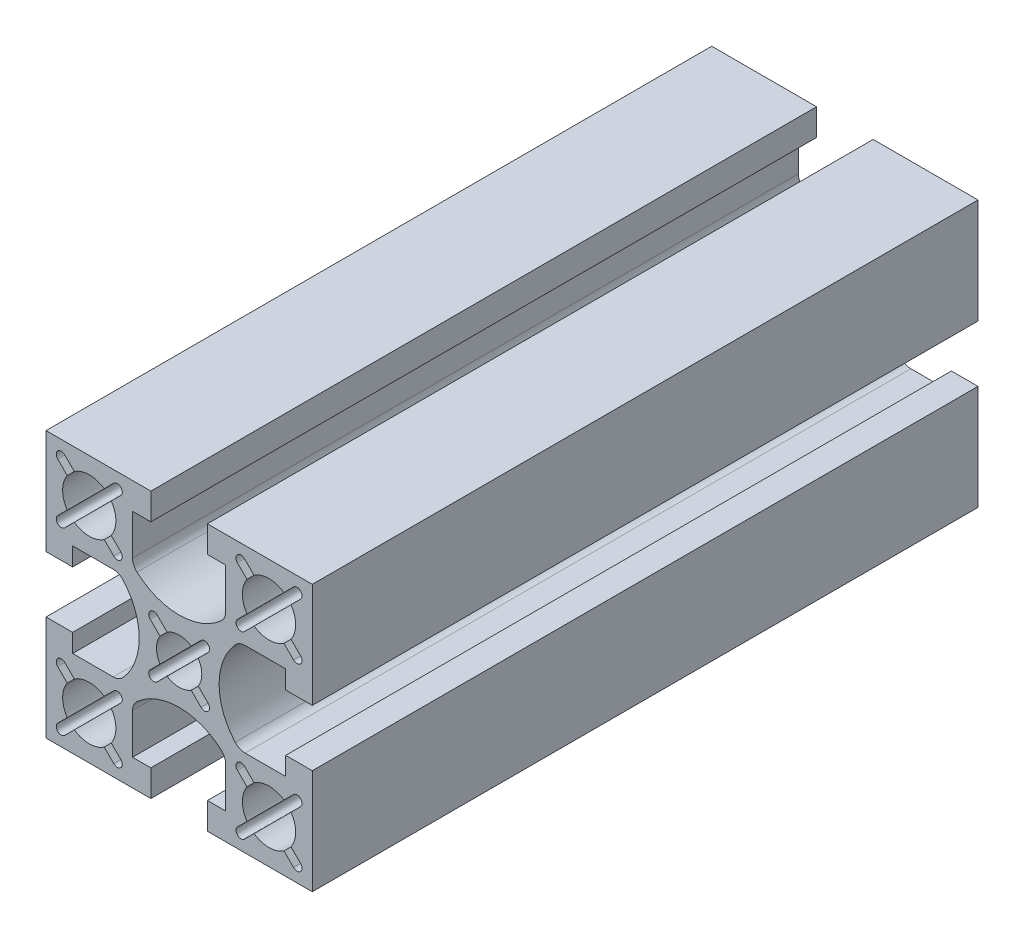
ISO-10303-21;
HEADER;
FILE_DESCRIPTION(('STEP AP214'),'2;1');
FILE_NAME('part.step','',(''),(''),'','','');
FILE_SCHEMA(('AUTOMOTIVE_DESIGN { 1 0 10303 214 1 1 1 1 }'));
ENDSEC;
DATA;
#1=APPLICATION_CONTEXT('core data for automotive mechanical design processes');
#2=APPLICATION_PROTOCOL_DEFINITION('international standard','automotive_design',2000,#1);
#3=PRODUCT_CONTEXT('',#1,'mechanical');
#4=PRODUCT('Part','Part','',(#3));
#5=PRODUCT_RELATED_PRODUCT_CATEGORY('part','',(#4));
#6=PRODUCT_DEFINITION_FORMATION('','',#4);
#7=PRODUCT_DEFINITION_CONTEXT('part definition',#1,'design');
#8=PRODUCT_DEFINITION('design','',#6,#7);
#9=PRODUCT_DEFINITION_SHAPE('','',#8);
#10=(LENGTH_UNIT() NAMED_UNIT(*) SI_UNIT(.MILLI.,.METRE.));
#11=(NAMED_UNIT(*) PLANE_ANGLE_UNIT() SI_UNIT($,.RADIAN.));
#12=(NAMED_UNIT(*) SI_UNIT($,.STERADIAN.) SOLID_ANGLE_UNIT());
#13=UNCERTAINTY_MEASURE_WITH_UNIT(LENGTH_MEASURE(1.E-05),#10,'distance_accuracy_value','');
#14=(GEOMETRIC_REPRESENTATION_CONTEXT(3) GLOBAL_UNCERTAINTY_ASSIGNED_CONTEXT((#13)) GLOBAL_UNIT_ASSIGNED_CONTEXT((#10,
#11,#12)) REPRESENTATION_CONTEXT('',''));
#15=CARTESIAN_POINT('',(0.,0.,0.));
#16=DIRECTION('',(0.,0.,1.));
#17=DIRECTION('',(1.,0.,0.));
#18=AXIS2_PLACEMENT_3D('',#15,#16,#17);
#19=CARTESIAN_POINT('',(0.,0.,-50.));
#20=DIRECTION('',(0.,0.,1.));
#21=DIRECTION('',(1.,0.,0.));
#22=AXIS2_PLACEMENT_3D('',#19,#20,#21);
#23=CYLINDRICAL_SURFACE('',#22,3.4);
#24=CARTESIAN_POINT('',(0.,0.,50.));
#25=DIRECTION('',(0.,0.,1.));
#26=DIRECTION('',(1.,0.,0.));
#27=AXIS2_PLACEMENT_3D('',#24,#25,#26);
#28=CIRCLE('',#27,3.4);
#29=CARTESIAN_POINT('',(2.87527144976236,-1.81461127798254,50.));
#30=VERTEX_POINT('',#29);
#31=CARTESIAN_POINT('',(2.87527144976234,1.81461127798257,50.));
#32=VERTEX_POINT('',#31);
#33=EDGE_CURVE('E1961',#30,#32,#28,.T.);
#34=ORIENTED_EDGE('',*,*,#33,.T.);
#35=DIRECTION('',(0.,0.,1.));
#36=VECTOR('',#35,1.);
#37=CARTESIAN_POINT('',(2.87527144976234,1.81461127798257,-50.));
#38=LINE('',#37,#36);
#39=CARTESIAN_POINT('',(2.87527144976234,1.81461127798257,-50.));
#40=VERTEX_POINT('',#39);
#41=EDGE_CURVE('E826',#40,#32,#38,.T.);
#42=ORIENTED_EDGE('',*,*,#41,.F.);
#43=CARTESIAN_POINT('',(0.,0.,-50.));
#44=DIRECTION('',(0.,0.,1.));
#45=DIRECTION('',(1.,0.,0.));
#46=AXIS2_PLACEMENT_3D('',#43,#44,#45);
#47=CIRCLE('',#46,3.4);
#48=CARTESIAN_POINT('',(2.87527144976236,-1.81461127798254,-50.));
#49=VERTEX_POINT('',#48);
#50=EDGE_CURVE('E1975',#49,#40,#47,.T.);
#51=ORIENTED_EDGE('',*,*,#50,.F.);
#52=DIRECTION('',(0.,0.,1.));
#53=VECTOR('',#52,1.);
#54=CARTESIAN_POINT('',(2.87527144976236,-1.81461127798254,-50.));
#55=LINE('',#54,#53);
#56=EDGE_CURVE('E850',#49,#30,#55,.T.);
#57=ORIENTED_EDGE('',*,*,#56,.T.);
#58=EDGE_LOOP('',(#34,#42,#51,#57));
#59=FACE_BOUND('',#58,.T.);
#60=ADVANCED_FACE('F35',(#59),#23,.F.);
#61=CARTESIAN_POINT('',(-1.81461127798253,-2.87527144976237,50.));
#62=VERTEX_POINT('',#61);
#63=CARTESIAN_POINT('',(1.81461127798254,-2.87527144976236,50.));
#64=VERTEX_POINT('',#63);
#65=EDGE_CURVE('E1671',#62,#64,#28,.T.);
#66=ORIENTED_EDGE('',*,*,#65,.T.);
#67=DIRECTION('',(0.,0.,1.));
#68=VECTOR('',#67,1.);
#69=CARTESIAN_POINT('',(1.81461127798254,-2.87527144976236,-50.));
#70=LINE('',#69,#68);
#71=CARTESIAN_POINT('',(1.81461127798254,-2.87527144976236,-50.));
#72=VERTEX_POINT('',#71);
#73=EDGE_CURVE('E848',#72,#64,#70,.T.);
#74=ORIENTED_EDGE('',*,*,#73,.F.);
#75=CARTESIAN_POINT('',(-1.81461127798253,-2.87527144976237,-50.));
#76=VERTEX_POINT('',#75);
#77=EDGE_CURVE('E1666',#76,#72,#47,.T.);
#78=ORIENTED_EDGE('',*,*,#77,.F.);
#79=DIRECTION('',(0.,0.,1.));
#80=VECTOR('',#79,1.);
#81=CARTESIAN_POINT('',(-1.81461127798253,-2.87527144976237,-50.));
#82=LINE('',#81,#80);
#83=EDGE_CURVE('E875',#76,#62,#82,.T.);
#84=ORIENTED_EDGE('',*,*,#83,.T.);
#85=EDGE_LOOP('',(#66,#74,#78,#84));
#86=FACE_BOUND('',#85,.T.);
#87=ADVANCED_FACE('F1901',(#86),#23,.F.);
#88=CARTESIAN_POINT('',(-2.87527144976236,1.81461127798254,50.));
#89=VERTEX_POINT('',#88);
#90=CARTESIAN_POINT('',(-2.87527144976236,-1.81461127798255,50.));
#91=VERTEX_POINT('',#90);
#92=EDGE_CURVE('E1668',#89,#91,#28,.T.);
#93=ORIENTED_EDGE('',*,*,#92,.T.);
#94=DIRECTION('',(0.,0.,1.));
#95=VECTOR('',#94,1.);
#96=CARTESIAN_POINT('',(-2.87527144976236,-1.81461127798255,-50.));
#97=LINE('',#96,#95);
#98=CARTESIAN_POINT('',(-2.87527144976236,-1.81461127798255,-50.));
#99=VERTEX_POINT('',#98);
#100=EDGE_CURVE('E873',#99,#91,#97,.T.);
#101=ORIENTED_EDGE('',*,*,#100,.F.);
#102=CARTESIAN_POINT('',(-2.87527144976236,1.81461127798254,-50.));
#103=VERTEX_POINT('',#102);
#104=EDGE_CURVE('E1662',#103,#99,#47,.T.);
#105=ORIENTED_EDGE('',*,*,#104,.F.);
#106=DIRECTION('',(0.,0.,1.));
#107=VECTOR('',#106,1.);
#108=CARTESIAN_POINT('',(-2.87527144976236,1.81461127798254,-50.));
#109=LINE('',#108,#107);
#110=EDGE_CURVE('E902',#103,#89,#109,.T.);
#111=ORIENTED_EDGE('',*,*,#110,.T.);
#112=EDGE_LOOP('',(#93,#101,#105,#111));
#113=FACE_BOUND('',#112,.T.);
#114=ADVANCED_FACE('F1908',(#113),#23,.F.);
#115=CARTESIAN_POINT('',(13.4999999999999,13.5000000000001,-50.));
#116=DIRECTION('',(0.,0.,1.));
#117=DIRECTION('',(1.,0.,0.));
#118=AXIS2_PLACEMENT_3D('',#115,#116,#117);
#119=CYLINDRICAL_SURFACE('',#118,4.);
#120=CARTESIAN_POINT('',(13.4999999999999,13.5000000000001,50.));
#121=DIRECTION('',(0.,0.,1.));
#122=DIRECTION('',(0.,-1.,0.));
#123=AXIS2_PLACEMENT_3D('',#120,#121,#122);
#124=CIRCLE('',#123,4.);
#125=CARTESIAN_POINT('',(11.2520662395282,10.1914060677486,50.));
#126=VERTEX_POINT('',#125);
#127=CARTESIAN_POINT('',(15.7479337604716,10.1914060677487,50.));
#128=VERTEX_POINT('',#127);
#129=EDGE_CURVE('E3154',#126,#128,#124,.T.);
#130=ORIENTED_EDGE('',*,*,#129,.T.);
#131=DIRECTION('',(0.,0.,1.));
#132=VECTOR('',#131,1.);
#133=CARTESIAN_POINT('',(15.7479337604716,10.1914060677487,-50.));
#134=LINE('',#133,#132);
#135=CARTESIAN_POINT('',(15.7479337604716,10.1914060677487,-50.));
#136=VERTEX_POINT('',#135);
#137=EDGE_CURVE('E926',#136,#128,#134,.T.);
#138=ORIENTED_EDGE('',*,*,#137,.F.);
#139=CARTESIAN_POINT('',(13.4999999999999,13.5000000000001,-50.));
#140=DIRECTION('',(0.,0.,1.));
#141=DIRECTION('',(0.,-1.,0.));
#142=AXIS2_PLACEMENT_3D('',#139,#140,#141);
#143=CIRCLE('',#142,4.);
#144=CARTESIAN_POINT('',(11.2520662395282,10.1914060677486,-50.));
#145=VERTEX_POINT('',#144);
#146=EDGE_CURVE('E3174',#145,#136,#143,.T.);
#147=ORIENTED_EDGE('',*,*,#146,.F.);
#148=DIRECTION('',(0.,0.,1.));
#149=VECTOR('',#148,1.);
#150=CARTESIAN_POINT('',(11.2520662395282,10.1914060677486,-50.));
#151=LINE('',#150,#149);
#152=EDGE_CURVE('E954',#145,#126,#151,.T.);
#153=ORIENTED_EDGE('',*,*,#152,.T.);
#154=EDGE_LOOP('',(#130,#138,#147,#153));
#155=FACE_BOUND('',#154,.T.);
#156=ADVANCED_FACE('F1926',(#155),#119,.F.);
#157=CARTESIAN_POINT('',(10.1914060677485,15.7479337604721,50.));
#158=VERTEX_POINT('',#157);
#159=CARTESIAN_POINT('',(10.1914060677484,11.2520662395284,50.));
#160=VERTEX_POINT('',#159);
#161=EDGE_CURVE('E1631',#158,#160,#124,.T.);
#162=ORIENTED_EDGE('',*,*,#161,.T.);
#163=DIRECTION('',(0.,0.,1.));
#164=VECTOR('',#163,1.);
#165=CARTESIAN_POINT('',(10.1914060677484,11.2520662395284,-50.));
#166=LINE('',#165,#164);
#167=CARTESIAN_POINT('',(10.1914060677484,11.2520662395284,-50.));
#168=VERTEX_POINT('',#167);
#169=EDGE_CURVE('E952',#168,#160,#166,.T.);
#170=ORIENTED_EDGE('',*,*,#169,.F.);
#171=CARTESIAN_POINT('',(10.1914060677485,15.747933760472,-50.));
#172=VERTEX_POINT('',#171);
#173=EDGE_CURVE('E1626',#172,#168,#143,.T.);
#174=ORIENTED_EDGE('',*,*,#173,.F.);
#175=DIRECTION('',(0.,0.,1.));
#176=VECTOR('',#175,1.);
#177=CARTESIAN_POINT('',(10.1914060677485,15.747933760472,-50.));
#178=LINE('',#177,#176);
#179=EDGE_CURVE('E980',#172,#158,#178,.T.);
#180=ORIENTED_EDGE('',*,*,#179,.T.);
#181=EDGE_LOOP('',(#162,#170,#174,#180));
#182=FACE_BOUND('',#181,.T.);
#183=ADVANCED_FACE('F1931',(#182),#119,.F.);
#184=CARTESIAN_POINT('',(15.7479337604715,16.8085939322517,50.));
#185=VERTEX_POINT('',#184);
#186=CARTESIAN_POINT('',(11.2520662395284,16.8085939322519,50.));
#187=VERTEX_POINT('',#186);
#188=EDGE_CURVE('E1628',#185,#187,#124,.T.);
#189=ORIENTED_EDGE('',*,*,#188,.T.);
#190=DIRECTION('',(0.,0.,1.));
#191=VECTOR('',#190,1.);
#192=CARTESIAN_POINT('',(11.2520662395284,16.8085939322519,-50.));
#193=LINE('',#192,#191);
#194=CARTESIAN_POINT('',(11.2520662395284,16.8085939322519,-50.));
#195=VERTEX_POINT('',#194);
#196=EDGE_CURVE('E978',#195,#187,#193,.T.);
#197=ORIENTED_EDGE('',*,*,#196,.F.);
#198=CARTESIAN_POINT('',(15.7479337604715,16.8085939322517,-50.));
#199=VERTEX_POINT('',#198);
#200=EDGE_CURVE('E1622',#199,#195,#143,.T.);
#201=ORIENTED_EDGE('',*,*,#200,.F.);
#202=DIRECTION('',(0.,0.,1.));
#203=VECTOR('',#202,1.);
#204=CARTESIAN_POINT('',(15.7479337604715,16.8085939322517,-50.));
#205=LINE('',#204,#203);
#206=EDGE_CURVE('E1163',#199,#185,#205,.T.);
#207=ORIENTED_EDGE('',*,*,#206,.T.);
#208=EDGE_LOOP('',(#189,#197,#201,#207));
#209=FACE_BOUND('',#208,.T.);
#210=ADVANCED_FACE('F2274',(#209),#119,.F.);
#211=CARTESIAN_POINT('',(13.5,-13.5,-50.));
#212=DIRECTION('',(0.,0.,1.));
#213=DIRECTION('',(1.,0.,0.));
#214=AXIS2_PLACEMENT_3D('',#211,#212,#213);
#215=CYLINDRICAL_SURFACE('',#214,4.);
#216=CARTESIAN_POINT('',(13.5,-13.5,50.));
#217=DIRECTION('',(0.,0.,1.));
#218=DIRECTION('',(-1.,0.,0.));
#219=AXIS2_PLACEMENT_3D('',#216,#217,#218);
#220=CIRCLE('',#219,4.);
#221=CARTESIAN_POINT('',(10.1914060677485,-11.2520662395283,50.));
#222=VERTEX_POINT('',#221);
#223=CARTESIAN_POINT('',(10.1914060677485,-15.7479337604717,50.));
#224=VERTEX_POINT('',#223);
#225=EDGE_CURVE('E3202',#222,#224,#220,.T.);
#226=ORIENTED_EDGE('',*,*,#225,.T.);
#227=DIRECTION('',(0.,0.,1.));
#228=VECTOR('',#227,1.);
#229=CARTESIAN_POINT('',(10.1914060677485,-15.7479337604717,-50.));
#230=LINE('',#229,#228);
#231=CARTESIAN_POINT('',(10.1914060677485,-15.7479337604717,-50.));
#232=VERTEX_POINT('',#231);
#233=EDGE_CURVE('E1004',#232,#224,#230,.T.);
#234=ORIENTED_EDGE('',*,*,#233,.F.);
#235=CARTESIAN_POINT('',(13.5,-13.5,-50.));
#236=DIRECTION('',(0.,0.,1.));
#237=DIRECTION('',(-1.,0.,0.));
#238=AXIS2_PLACEMENT_3D('',#235,#236,#237);
#239=CIRCLE('',#238,4.);
#240=CARTESIAN_POINT('',(10.1914060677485,-11.2520662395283,-50.));
#241=VERTEX_POINT('',#240);
#242=EDGE_CURVE('E3190',#241,#232,#239,.T.);
#243=ORIENTED_EDGE('',*,*,#242,.F.);
#244=DIRECTION('',(0.,0.,1.));
#245=VECTOR('',#244,1.);
#246=CARTESIAN_POINT('',(10.1914060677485,-11.2520662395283,-50.));
#247=LINE('',#246,#245);
#248=EDGE_CURVE('E1032',#241,#222,#247,.T.);
#249=ORIENTED_EDGE('',*,*,#248,.T.);
#250=EDGE_LOOP('',(#226,#234,#243,#249));
#251=FACE_BOUND('',#250,.T.);
#252=ADVANCED_FACE('F2278',(#251),#215,.F.);
#253=CARTESIAN_POINT('',(15.7479337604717,-10.1914060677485,50.));
#254=VERTEX_POINT('',#253);
#255=CARTESIAN_POINT('',(11.2520662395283,-10.1914060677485,50.));
#256=VERTEX_POINT('',#255);
#257=EDGE_CURVE('E1641',#254,#256,#220,.T.);
#258=ORIENTED_EDGE('',*,*,#257,.T.);
#259=DIRECTION('',(0.,0.,1.));
#260=VECTOR('',#259,1.);
#261=CARTESIAN_POINT('',(11.2520662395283,-10.1914060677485,-50.));
#262=LINE('',#261,#260);
#263=CARTESIAN_POINT('',(11.2520662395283,-10.1914060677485,-50.));
#264=VERTEX_POINT('',#263);
#265=EDGE_CURVE('E1030',#264,#256,#262,.T.);
#266=ORIENTED_EDGE('',*,*,#265,.F.);
#267=CARTESIAN_POINT('',(15.7479337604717,-10.1914060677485,-50.));
#268=VERTEX_POINT('',#267);
#269=EDGE_CURVE('E1636',#268,#264,#239,.T.);
#270=ORIENTED_EDGE('',*,*,#269,.F.);
#271=DIRECTION('',(0.,0.,1.));
#272=VECTOR('',#271,1.);
#273=CARTESIAN_POINT('',(15.7479337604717,-10.1914060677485,-50.));
#274=LINE('',#273,#272);
#275=EDGE_CURVE('E1058',#268,#254,#274,.T.);
#276=ORIENTED_EDGE('',*,*,#275,.T.);
#277=EDGE_LOOP('',(#258,#266,#270,#276));
#278=FACE_BOUND('',#277,.T.);
#279=ADVANCED_FACE('F2718',(#278),#215,.F.);
#280=CARTESIAN_POINT('',(16.8085939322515,-15.7479337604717,50.));
#281=VERTEX_POINT('',#280);
#282=CARTESIAN_POINT('',(16.8085939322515,-11.2520662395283,50.));
#283=VERTEX_POINT('',#282);
#284=EDGE_CURVE('E1638',#281,#283,#220,.T.);
#285=ORIENTED_EDGE('',*,*,#284,.T.);
#286=DIRECTION('',(0.,0.,1.));
#287=VECTOR('',#286,1.);
#288=CARTESIAN_POINT('',(16.8085939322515,-11.2520662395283,-50.));
#289=LINE('',#288,#287);
#290=CARTESIAN_POINT('',(16.8085939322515,-11.2520662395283,-50.));
#291=VERTEX_POINT('',#290);
#292=EDGE_CURVE('E1056',#291,#283,#289,.T.);
#293=ORIENTED_EDGE('',*,*,#292,.F.);
#294=CARTESIAN_POINT('',(16.8085939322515,-15.7479337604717,-50.));
#295=VERTEX_POINT('',#294);
#296=EDGE_CURVE('E1632',#295,#291,#239,.T.);
#297=ORIENTED_EDGE('',*,*,#296,.F.);
#298=DIRECTION('',(0.,0.,1.));
#299=VECTOR('',#298,1.);
#300=CARTESIAN_POINT('',(16.8085939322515,-15.7479337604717,-50.));
#301=LINE('',#300,#299);
#302=EDGE_CURVE('E1190',#295,#281,#301,.T.);
#303=ORIENTED_EDGE('',*,*,#302,.T.);
#304=EDGE_LOOP('',(#285,#293,#297,#303));
#305=FACE_BOUND('',#304,.T.);
#306=ADVANCED_FACE('F2279',(#305),#215,.F.);
#307=CARTESIAN_POINT('',(-13.5,-13.5,-50.));
#308=DIRECTION('',(0.,0.,1.));
#309=DIRECTION('',(1.,0.,0.));
#310=AXIS2_PLACEMENT_3D('',#307,#308,#309);
#311=CYLINDRICAL_SURFACE('',#310,4.);
#312=CARTESIAN_POINT('',(-13.5,-13.5,50.));
#313=DIRECTION('',(0.,0.,1.));
#314=DIRECTION('',(0.,1.,0.));
#315=AXIS2_PLACEMENT_3D('',#312,#313,#314);
#316=CIRCLE('',#315,4.);
#317=CARTESIAN_POINT('',(-11.2520662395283,-10.1914060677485,50.));
#318=VERTEX_POINT('',#317);
#319=CARTESIAN_POINT('',(-15.7479337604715,-10.1914060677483,50.));
#320=VERTEX_POINT('',#319);
#321=EDGE_CURVE('E2321',#318,#320,#316,.T.);
#322=ORIENTED_EDGE('',*,*,#321,.T.);
#323=DIRECTION('',(0.,0.,1.));
#324=VECTOR('',#323,1.);
#325=CARTESIAN_POINT('',(-15.7479337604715,-10.1914060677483,-50.));
#326=LINE('',#325,#324);
#327=CARTESIAN_POINT('',(-15.7479337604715,-10.1914060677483,-50.));
#328=VERTEX_POINT('',#327);
#329=EDGE_CURVE('E1082',#328,#320,#326,.T.);
#330=ORIENTED_EDGE('',*,*,#329,.F.);
#331=CARTESIAN_POINT('',(-13.5,-13.5,-50.));
#332=DIRECTION('',(0.,0.,1.));
#333=DIRECTION('',(0.,1.,0.));
#334=AXIS2_PLACEMENT_3D('',#331,#332,#333);
#335=CIRCLE('',#334,4.);
#336=CARTESIAN_POINT('',(-11.2520662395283,-10.1914060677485,-50.));
#337=VERTEX_POINT('',#336);
#338=EDGE_CURVE('E2335',#337,#328,#335,.T.);
#339=ORIENTED_EDGE('',*,*,#338,.F.);
#340=DIRECTION('',(0.,0.,1.));
#341=VECTOR('',#340,1.);
#342=CARTESIAN_POINT('',(-11.2520662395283,-10.1914060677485,-50.));
#343=LINE('',#342,#341);
#344=EDGE_CURVE('E1110',#337,#318,#343,.T.);
#345=ORIENTED_EDGE('',*,*,#344,.T.);
#346=EDGE_LOOP('',(#322,#330,#339,#345));
#347=FACE_BOUND('',#346,.T.);
#348=ADVANCED_FACE('F2282',(#347),#311,.F.);
#349=CARTESIAN_POINT('',(-10.1914060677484,-15.7479337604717,50.));
#350=VERTEX_POINT('',#349);
#351=CARTESIAN_POINT('',(-10.1914060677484,-11.2520662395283,50.));
#352=VERTEX_POINT('',#351);
#353=EDGE_CURVE('E1651',#350,#352,#316,.T.);
#354=ORIENTED_EDGE('',*,*,#353,.T.);
#355=DIRECTION('',(0.,0.,1.));
#356=VECTOR('',#355,1.);
#357=CARTESIAN_POINT('',(-10.1914060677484,-11.2520662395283,-50.));
#358=LINE('',#357,#356);
#359=CARTESIAN_POINT('',(-10.1914060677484,-11.2520662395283,-50.));
#360=VERTEX_POINT('',#359);
#361=EDGE_CURVE('E1108',#360,#352,#358,.T.);
#362=ORIENTED_EDGE('',*,*,#361,.F.);
#363=CARTESIAN_POINT('',(-10.1914060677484,-15.7479337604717,-50.));
#364=VERTEX_POINT('',#363);
#365=EDGE_CURVE('E1646',#364,#360,#335,.T.);
#366=ORIENTED_EDGE('',*,*,#365,.F.);
#367=DIRECTION('',(0.,0.,1.));
#368=VECTOR('',#367,1.);
#369=CARTESIAN_POINT('',(-10.1914060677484,-15.7479337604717,-50.));
#370=LINE('',#369,#368);
#371=EDGE_CURVE('E1136',#364,#350,#370,.T.);
#372=ORIENTED_EDGE('',*,*,#371,.T.);
#373=EDGE_LOOP('',(#354,#362,#366,#372));
#374=FACE_BOUND('',#373,.T.);
#375=ADVANCED_FACE('F2288',(#374),#311,.F.);
#376=CARTESIAN_POINT('',(-15.7479337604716,-16.8085939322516,50.));
#377=VERTEX_POINT('',#376);
#378=CARTESIAN_POINT('',(-11.2520662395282,-16.8085939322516,50.));
#379=VERTEX_POINT('',#378);
#380=EDGE_CURVE('E1648',#377,#379,#316,.T.);
#381=ORIENTED_EDGE('',*,*,#380,.T.);
#382=DIRECTION('',(0.,0.,1.));
#383=VECTOR('',#382,1.);
#384=CARTESIAN_POINT('',(-11.2520662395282,-16.8085939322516,-50.));
#385=LINE('',#384,#383);
#386=CARTESIAN_POINT('',(-11.2520662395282,-16.8085939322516,-50.));
#387=VERTEX_POINT('',#386);
#388=EDGE_CURVE('E1134',#387,#379,#385,.T.);
#389=ORIENTED_EDGE('',*,*,#388,.F.);
#390=CARTESIAN_POINT('',(-15.7479337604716,-16.8085939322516,-50.));
#391=VERTEX_POINT('',#390);
#392=EDGE_CURVE('E1642',#391,#387,#335,.T.);
#393=ORIENTED_EDGE('',*,*,#392,.F.);
#394=DIRECTION('',(0.,0.,1.));
#395=VECTOR('',#394,1.);
#396=CARTESIAN_POINT('',(-15.7479337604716,-16.8085939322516,-50.));
#397=LINE('',#396,#395);
#398=EDGE_CURVE('E1217',#391,#377,#397,.T.);
#399=ORIENTED_EDGE('',*,*,#398,.T.);
#400=EDGE_LOOP('',(#381,#389,#393,#399));
#401=FACE_BOUND('',#400,.T.);
#402=ADVANCED_FACE('F2283',(#401),#311,.F.);
#403=CARTESIAN_POINT('',(-13.5,13.5,-50.));
#404=DIRECTION('',(0.,0.,1.));
#405=DIRECTION('',(1.,0.,0.));
#406=AXIS2_PLACEMENT_3D('',#403,#404,#405);
#407=CYLINDRICAL_SURFACE('',#406,4.);
#408=CARTESIAN_POINT('',(-13.5,13.5,50.));
#409=DIRECTION('',(0.,0.,1.));
#410=DIRECTION('',(1.,0.,0.));
#411=AXIS2_PLACEMENT_3D('',#408,#409,#410);
#412=CIRCLE('',#411,4.);
#413=CARTESIAN_POINT('',(-10.1914060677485,11.2520662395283,50.));
#414=VERTEX_POINT('',#413);
#415=CARTESIAN_POINT('',(-10.1914060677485,15.7479337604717,50.));
#416=VERTEX_POINT('',#415);
#417=EDGE_CURVE('E2355',#414,#416,#412,.T.);
#418=ORIENTED_EDGE('',*,*,#417,.T.);
#419=DIRECTION('',(0.,0.,1.));
#420=VECTOR('',#419,1.);
#421=CARTESIAN_POINT('',(-10.1914060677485,15.7479337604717,-50.));
#422=LINE('',#421,#420);
#423=CARTESIAN_POINT('',(-10.1914060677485,15.7479337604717,-50.));
#424=VERTEX_POINT('',#423);
#425=EDGE_CURVE('E1241',#424,#416,#422,.T.);
#426=ORIENTED_EDGE('',*,*,#425,.F.);
#427=CARTESIAN_POINT('',(-13.5,13.5,-50.));
#428=DIRECTION('',(0.,0.,1.));
#429=DIRECTION('',(1.,0.,0.));
#430=AXIS2_PLACEMENT_3D('',#427,#428,#429);
#431=CIRCLE('',#430,4.);
#432=CARTESIAN_POINT('',(-10.1914060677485,11.2520662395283,-50.));
#433=VERTEX_POINT('',#432);
#434=EDGE_CURVE('E2343',#433,#424,#431,.T.);
#435=ORIENTED_EDGE('',*,*,#434,.F.);
#436=DIRECTION('',(0.,0.,1.));
#437=VECTOR('',#436,1.);
#438=CARTESIAN_POINT('',(-10.1914060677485,11.2520662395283,-50.));
#439=LINE('',#438,#437);
#440=EDGE_CURVE('E1269',#433,#414,#439,.T.);
#441=ORIENTED_EDGE('',*,*,#440,.T.);
#442=EDGE_LOOP('',(#418,#426,#435,#441));
#443=FACE_BOUND('',#442,.T.);
#444=ADVANCED_FACE('F1922',(#443),#407,.F.);
#445=CARTESIAN_POINT('',(-15.7479337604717,10.1914060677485,50.));
#446=VERTEX_POINT('',#445);
#447=CARTESIAN_POINT('',(-11.2520662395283,10.1914060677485,50.));
#448=VERTEX_POINT('',#447);
#449=EDGE_CURVE('E1661',#446,#448,#412,.T.);
#450=ORIENTED_EDGE('',*,*,#449,.T.);
#451=DIRECTION('',(0.,0.,1.));
#452=VECTOR('',#451,1.);
#453=CARTESIAN_POINT('',(-11.2520662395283,10.1914060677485,-50.));
#454=LINE('',#453,#452);
#455=CARTESIAN_POINT('',(-11.2520662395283,10.1914060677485,-50.));
#456=VERTEX_POINT('',#455);
#457=EDGE_CURVE('E1267',#456,#448,#454,.T.);
#458=ORIENTED_EDGE('',*,*,#457,.F.);
#459=CARTESIAN_POINT('',(-15.7479337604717,10.1914060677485,-50.));
#460=VERTEX_POINT('',#459);
#461=EDGE_CURVE('E1656',#460,#456,#431,.T.);
#462=ORIENTED_EDGE('',*,*,#461,.F.);
#463=DIRECTION('',(0.,0.,1.));
#464=VECTOR('',#463,1.);
#465=CARTESIAN_POINT('',(-15.7479337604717,10.1914060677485,-50.));
#466=LINE('',#465,#464);
#467=EDGE_CURVE('E1295',#460,#446,#466,.T.);
#468=ORIENTED_EDGE('',*,*,#467,.T.);
#469=EDGE_LOOP('',(#450,#458,#462,#468));
#470=FACE_BOUND('',#469,.T.);
#471=ADVANCED_FACE('F2296',(#470),#407,.F.);
#472=CARTESIAN_POINT('',(-16.8085939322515,15.7479337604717,50.));
#473=VERTEX_POINT('',#472);
#474=CARTESIAN_POINT('',(-16.8085939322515,11.2520662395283,50.));
#475=VERTEX_POINT('',#474);
#476=EDGE_CURVE('E1658',#473,#475,#412,.T.);
#477=ORIENTED_EDGE('',*,*,#476,.T.);
#478=DIRECTION('',(0.,0.,1.));
#479=VECTOR('',#478,1.);
#480=CARTESIAN_POINT('',(-16.8085939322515,11.2520662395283,-50.));
#481=LINE('',#480,#479);
#482=CARTESIAN_POINT('',(-16.8085939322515,11.2520662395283,-50.));
#483=VERTEX_POINT('',#482);
#484=EDGE_CURVE('E1293',#483,#475,#481,.T.);
#485=ORIENTED_EDGE('',*,*,#484,.F.);
#486=CARTESIAN_POINT('',(-16.8085939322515,15.7479337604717,-50.));
#487=VERTEX_POINT('',#486);
#488=EDGE_CURVE('E1652',#487,#483,#431,.T.);
#489=ORIENTED_EDGE('',*,*,#488,.F.);
#490=DIRECTION('',(0.,0.,1.));
#491=VECTOR('',#490,1.);
#492=CARTESIAN_POINT('',(-16.8085939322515,15.7479337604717,-50.));
#493=LINE('',#492,#491);
#494=EDGE_CURVE('E1322',#487,#473,#493,.T.);
#495=ORIENTED_EDGE('',*,*,#494,.T.);
#496=EDGE_LOOP('',(#477,#485,#489,#495));
#497=FACE_BOUND('',#496,.T.);
#498=ADVANCED_FACE('F1923',(#497),#407,.F.);
#499=CARTESIAN_POINT('',(20.,20.,50.));
#500=DIRECTION('',(-1.,0.,0.));
#501=DIRECTION('',(0.,0.,1.));
#502=AXIS2_PLACEMENT_3D('',#499,#500,#501);
#503=PLANE('',#502);
#504=DIRECTION('',(0.,1.,0.));
#505=VECTOR('',#504,1.);
#506=CARTESIAN_POINT('',(20.,20.,50.));
#507=LINE('',#506,#505);
#508=CARTESIAN_POINT('',(20.,4.25000000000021,50.));
#509=VERTEX_POINT('',#508);
#510=CARTESIAN_POINT('',(20.,20.,50.));
#511=VERTEX_POINT('',#510);
#512=EDGE_CURVE('E1676',#509,#511,#507,.T.);
#513=ORIENTED_EDGE('',*,*,#512,.F.);
#514=DIRECTION('',(0.,0.,1.));
#515=VECTOR('',#514,1.);
#516=CARTESIAN_POINT('',(20.,4.25000000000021,-50.));
#517=LINE('',#516,#515);
#518=CARTESIAN_POINT('',(20.,4.25000000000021,-50.));
#519=VERTEX_POINT('',#518);
#520=EDGE_CURVE('E1379',#519,#509,#517,.T.);
#521=ORIENTED_EDGE('',*,*,#520,.F.);
#522=DIRECTION('',(0.,1.,0.));
#523=VECTOR('',#522,1.);
#524=CARTESIAN_POINT('',(20.,20.,-50.));
#525=LINE('',#524,#523);
#526=CARTESIAN_POINT('',(20.,20.,-50.));
#527=VERTEX_POINT('',#526);
#528=EDGE_CURVE('E1665',#519,#527,#525,.T.);
#529=ORIENTED_EDGE('',*,*,#528,.T.);
#530=DIRECTION('',(0.,0.,-1.));
#531=VECTOR('',#530,1.);
#532=CARTESIAN_POINT('',(20.,20.,50.));
#533=LINE('',#532,#531);
#534=EDGE_CURVE('E11',#511,#527,#533,.T.);
#535=ORIENTED_EDGE('',*,*,#534,.F.);
#536=EDGE_LOOP('',(#513,#521,#529,#535));
#537=FACE_BOUND('',#536,.T.);
#538=ADVANCED_FACE('F1775',(#537),#503,.F.);
#539=CARTESIAN_POINT('',(-20.,-20.,50.));
#540=DIRECTION('',(0.,1.,0.));
#541=DIRECTION('',(0.,0.,1.));
#542=AXIS2_PLACEMENT_3D('',#539,#540,#541);
#543=PLANE('',#542);
#544=DIRECTION('',(1.,0.,0.));
#545=VECTOR('',#544,1.);
#546=CARTESIAN_POINT('',(-20.,-20.,50.));
#547=LINE('',#546,#545);
#548=CARTESIAN_POINT('',(4.25,-20.,50.));
#549=VERTEX_POINT('',#548);
#550=CARTESIAN_POINT('',(20.,-20.,50.));
#551=VERTEX_POINT('',#550);
#552=EDGE_CURVE('E1684',#549,#551,#547,.T.);
#553=ORIENTED_EDGE('',*,*,#552,.F.);
#554=DIRECTION('',(0.,0.,1.));
#555=VECTOR('',#554,1.);
#556=CARTESIAN_POINT('',(4.25,-20.,-50.));
#557=LINE('',#556,#555);
#558=CARTESIAN_POINT('',(4.25,-20.,-50.));
#559=VERTEX_POINT('',#558);
#560=EDGE_CURVE('E1453',#559,#549,#557,.T.);
#561=ORIENTED_EDGE('',*,*,#560,.F.);
#562=DIRECTION('',(1.,0.,0.));
#563=VECTOR('',#562,1.);
#564=CARTESIAN_POINT('',(-20.,-20.,-50.));
#565=LINE('',#564,#563);
#566=CARTESIAN_POINT('',(20.,-20.,-50.));
#567=VERTEX_POINT('',#566);
#568=EDGE_CURVE('E1700',#559,#567,#565,.T.);
#569=ORIENTED_EDGE('',*,*,#568,.T.);
#570=DIRECTION('',(0.,0.,-1.));
#571=VECTOR('',#570,1.);
#572=CARTESIAN_POINT('',(20.,-20.,50.));
#573=LINE('',#572,#571);
#574=EDGE_CURVE('E1688',#551,#567,#573,.T.);
#575=ORIENTED_EDGE('',*,*,#574,.F.);
#576=EDGE_LOOP('',(#553,#561,#569,#575));
#577=FACE_BOUND('',#576,.T.);
#578=ADVANCED_FACE('F1816',(#577),#543,.F.);
#579=CARTESIAN_POINT('',(-20.,20.,50.));
#580=DIRECTION('',(1.,0.,0.));
#581=DIRECTION('',(0.,1.,0.));
#582=AXIS2_PLACEMENT_3D('',#579,#580,#581);
#583=PLANE('',#582);
#584=DIRECTION('',(0.,-1.,0.));
#585=VECTOR('',#584,1.);
#586=CARTESIAN_POINT('',(-20.,20.,50.));
#587=LINE('',#586,#585);
#588=CARTESIAN_POINT('',(-20.,-4.25000000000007,50.));
#589=VERTEX_POINT('',#588);
#590=CARTESIAN_POINT('',(-20.,-20.,50.));
#591=VERTEX_POINT('',#590);
#592=EDGE_CURVE('E1680',#589,#591,#587,.T.);
#593=ORIENTED_EDGE('',*,*,#592,.F.);
#594=DIRECTION('',(0.,0.,1.));
#595=VECTOR('',#594,1.);
#596=CARTESIAN_POINT('',(-20.,-4.25000000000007,-50.));
#597=LINE('',#596,#595);
#598=CARTESIAN_POINT('',(-20.,-4.25000000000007,-50.));
#599=VERTEX_POINT('',#598);
#600=EDGE_CURVE('E1527',#599,#589,#597,.T.);
#601=ORIENTED_EDGE('',*,*,#600,.F.);
#602=DIRECTION('',(0.,-1.,0.));
#603=VECTOR('',#602,1.);
#604=CARTESIAN_POINT('',(-20.,20.,-50.));
#605=LINE('',#604,#603);
#606=CARTESIAN_POINT('',(-20.,-20.,-50.));
#607=VERTEX_POINT('',#606);
#608=EDGE_CURVE('E1696',#599,#607,#605,.T.);
#609=ORIENTED_EDGE('',*,*,#608,.T.);
#610=DIRECTION('',(0.,0.,-1.));
#611=VECTOR('',#610,1.);
#612=CARTESIAN_POINT('',(-20.,-20.,50.));
#613=LINE('',#612,#611);
#614=EDGE_CURVE('E1706',#591,#607,#613,.T.);
#615=ORIENTED_EDGE('',*,*,#614,.F.);
#616=EDGE_LOOP('',(#593,#601,#609,#615));
#617=FACE_BOUND('',#616,.T.);
#618=ADVANCED_FACE('F1861',(#617),#583,.F.);
#619=CARTESIAN_POINT('',(-20.,20.,50.));
#620=DIRECTION('',(0.,-1.,0.));
#621=DIRECTION('',(0.,0.,-1.));
#622=AXIS2_PLACEMENT_3D('',#619,#620,#621);
#623=PLANE('',#622);
#624=DIRECTION('',(-1.,0.,0.));
#625=VECTOR('',#624,1.);
#626=CARTESIAN_POINT('',(-20.,20.,50.));
#627=LINE('',#626,#625);
#628=CARTESIAN_POINT('',(-4.25,20.,50.));
#629=VERTEX_POINT('',#628);
#630=CARTESIAN_POINT('',(-20.,20.,50.));
#631=VERTEX_POINT('',#630);
#632=EDGE_CURVE('E1675',#629,#631,#627,.T.);
#633=ORIENTED_EDGE('',*,*,#632,.F.);
#634=DIRECTION('',(0.,0.,1.));
#635=VECTOR('',#634,1.);
#636=CARTESIAN_POINT('',(-4.25,20.,-50.));
#637=LINE('',#636,#635);
#638=CARTESIAN_POINT('',(-4.25,20.,-50.));
#639=VERTEX_POINT('',#638);
#640=EDGE_CURVE('E1601',#639,#629,#637,.T.);
#641=ORIENTED_EDGE('',*,*,#640,.F.);
#642=DIRECTION('',(-1.,0.,0.));
#643=VECTOR('',#642,1.);
#644=CARTESIAN_POINT('',(-20.,20.,-50.));
#645=LINE('',#644,#643);
#646=CARTESIAN_POINT('',(-20.,20.,-50.));
#647=VERTEX_POINT('',#646);
#648=EDGE_CURVE('E1692',#639,#647,#645,.T.);
#649=ORIENTED_EDGE('',*,*,#648,.T.);
#650=DIRECTION('',(0.,0.,-1.));
#651=VECTOR('',#650,1.);
#652=CARTESIAN_POINT('',(-20.,20.,50.));
#653=LINE('',#652,#651);
#654=EDGE_CURVE('E43',#631,#647,#653,.T.);
#655=ORIENTED_EDGE('',*,*,#654,.F.);
#656=EDGE_LOOP('',(#633,#641,#649,#655));
#657=FACE_BOUND('',#656,.T.);
#658=ADVANCED_FACE('F1732',(#657),#623,.F.);
#659=CARTESIAN_POINT('',(20.,-4.24999999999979,-50.));
#660=VERTEX_POINT('',#659);
#661=EDGE_CURVE('E1689',#567,#660,#525,.T.);
#662=ORIENTED_EDGE('',*,*,#661,.T.);
#663=DIRECTION('',(0.,0.,1.));
#664=VECTOR('',#663,1.);
#665=CARTESIAN_POINT('',(20.,-4.24999999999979,-50.));
#666=LINE('',#665,#664);
#667=CARTESIAN_POINT('',(20.,-4.24999999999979,50.));
#668=VERTEX_POINT('',#667);
#669=EDGE_CURVE('E1382',#660,#668,#666,.T.);
#670=ORIENTED_EDGE('',*,*,#669,.T.);
#671=EDGE_CURVE('E1672',#551,#668,#507,.T.);
#672=ORIENTED_EDGE('',*,*,#671,.F.);
#673=ORIENTED_EDGE('',*,*,#574,.T.);
#674=EDGE_LOOP('',(#662,#670,#672,#673));
#675=FACE_BOUND('',#674,.T.);
#676=ADVANCED_FACE('F37',(#675),#503,.F.);
#677=CARTESIAN_POINT('',(4.25,20.,-50.));
#678=VERTEX_POINT('',#677);
#679=EDGE_CURVE('E1693',#527,#678,#645,.T.);
#680=ORIENTED_EDGE('',*,*,#679,.T.);
#681=DIRECTION('',(0.,0.,1.));
#682=VECTOR('',#681,1.);
#683=CARTESIAN_POINT('',(4.25,20.,-50.));
#684=LINE('',#683,#682);
#685=CARTESIAN_POINT('',(4.25,20.,50.));
#686=VERTEX_POINT('',#685);
#687=EDGE_CURVE('E1604',#678,#686,#684,.T.);
#688=ORIENTED_EDGE('',*,*,#687,.T.);
#689=EDGE_CURVE('E1677',#511,#686,#627,.T.);
#690=ORIENTED_EDGE('',*,*,#689,.F.);
#691=ORIENTED_EDGE('',*,*,#534,.T.);
#692=EDGE_LOOP('',(#680,#688,#690,#691));
#693=FACE_BOUND('',#692,.T.);
#694=ADVANCED_FACE('F1769',(#693),#623,.F.);
#695=CARTESIAN_POINT('',(-20.,4.24999999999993,-50.));
#696=VERTEX_POINT('',#695);
#697=EDGE_CURVE('E1697',#647,#696,#605,.T.);
#698=ORIENTED_EDGE('',*,*,#697,.T.);
#699=DIRECTION('',(0.,0.,1.));
#700=VECTOR('',#699,1.);
#701=CARTESIAN_POINT('',(-20.,4.24999999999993,-50.));
#702=LINE('',#701,#700);
#703=CARTESIAN_POINT('',(-20.,4.24999999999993,50.));
#704=VERTEX_POINT('',#703);
#705=EDGE_CURVE('E1530',#696,#704,#702,.T.);
#706=ORIENTED_EDGE('',*,*,#705,.T.);
#707=EDGE_CURVE('E1681',#631,#704,#587,.T.);
#708=ORIENTED_EDGE('',*,*,#707,.F.);
#709=ORIENTED_EDGE('',*,*,#654,.T.);
#710=EDGE_LOOP('',(#698,#706,#708,#709));
#711=FACE_BOUND('',#710,.T.);
#712=ADVANCED_FACE('F1713',(#711),#583,.F.);
#713=CARTESIAN_POINT('',(-4.25,-20.,-50.));
#714=VERTEX_POINT('',#713);
#715=EDGE_CURVE('E1701',#607,#714,#565,.T.);
#716=ORIENTED_EDGE('',*,*,#715,.T.);
#717=DIRECTION('',(0.,0.,1.));
#718=VECTOR('',#717,1.);
#719=CARTESIAN_POINT('',(-4.25,-20.,-50.));
#720=LINE('',#719,#718);
#721=CARTESIAN_POINT('',(-4.25,-20.,50.));
#722=VERTEX_POINT('',#721);
#723=EDGE_CURVE('E1456',#714,#722,#720,.T.);
#724=ORIENTED_EDGE('',*,*,#723,.T.);
#725=EDGE_CURVE('E1685',#591,#722,#547,.T.);
#726=ORIENTED_EDGE('',*,*,#725,.F.);
#727=ORIENTED_EDGE('',*,*,#614,.T.);
#728=EDGE_LOOP('',(#716,#724,#726,#727));
#729=FACE_BOUND('',#728,.T.);
#730=ADVANCED_FACE('F1856',(#729),#543,.F.);
#731=CARTESIAN_POINT('',(20.,-20.,50.));
#732=DIRECTION('',(0.,0.,1.));
#733=DIRECTION('',(1.,0.,0.));
#734=AXIS2_PLACEMENT_3D('',#731,#732,#733);
#735=PLANE('',#734);
#736=DIRECTION('',(0.70710678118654,0.707106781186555,0.));
#737=VECTOR('',#736,1.);
#738=CARTESIAN_POINT('',(4.34870670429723,3.28804653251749,50.));
#739=LINE('',#738,#737);
#740=CARTESIAN_POINT('',(4.34870670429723,3.28804653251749,50.));
#741=VERTEX_POINT('',#740);
#742=EDGE_CURVE('E815',#32,#741,#739,.T.);
#743=ORIENTED_EDGE('',*,*,#742,.F.);
#744=ORIENTED_EDGE('',*,*,#33,.F.);
#745=DIRECTION('',(-0.707106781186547,0.707106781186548,0.));
#746=VECTOR('',#745,1.);
#747=CARTESIAN_POINT('',(4.34870670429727,-3.28804653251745,50.));
#748=LINE('',#747,#746);
#749=CARTESIAN_POINT('',(4.34870670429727,-3.28804653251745,50.));
#750=VERTEX_POINT('',#749);
#751=EDGE_CURVE('E58',#750,#30,#748,.T.);
#752=ORIENTED_EDGE('',*,*,#751,.F.);
#753=CARTESIAN_POINT('',(3.81837661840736,-3.81837661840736,50.));
#754=DIRECTION('',(0.,0.,1.));
#755=DIRECTION('',(-1.,0.,0.));
#756=AXIS2_PLACEMENT_3D('',#753,#754,#755);
#757=CIRCLE('',#756,0.75);
#758=CARTESIAN_POINT('',(3.28804653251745,-4.34870670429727,50.));
#759=VERTEX_POINT('',#758);
#760=EDGE_CURVE('E825',#759,#750,#757,.T.);
#761=ORIENTED_EDGE('',*,*,#760,.F.);
#762=DIRECTION('',(0.707106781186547,-0.707106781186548,0.));
#763=VECTOR('',#762,1.);
#764=CARTESIAN_POINT('',(3.28804653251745,-4.34870670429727,50.));
#765=LINE('',#764,#763);
#766=EDGE_CURVE('E833',#64,#759,#765,.T.);
#767=ORIENTED_EDGE('',*,*,#766,.F.);
#768=ORIENTED_EDGE('',*,*,#65,.F.);
#769=DIRECTION('',(0.707106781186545,0.70710678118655,0.));
#770=VECTOR('',#769,1.);
#771=CARTESIAN_POINT('',(-3.28804653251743,-4.34870670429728,50.));
#772=LINE('',#771,#770);
#773=CARTESIAN_POINT('',(-3.28804653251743,-4.34870670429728,50.));
#774=VERTEX_POINT('',#773);
#775=EDGE_CURVE('E866',#774,#62,#772,.T.);
#776=ORIENTED_EDGE('',*,*,#775,.F.);
#777=CARTESIAN_POINT('',(-3.81837661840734,-3.81837661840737,50.));
#778=DIRECTION('',(0.,0.,1.));
#779=DIRECTION('',(0.,1.,0.));
#780=AXIS2_PLACEMENT_3D('',#777,#778,#779);
#781=CIRCLE('',#780,0.75);
#782=CARTESIAN_POINT('',(-4.34870670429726,-3.28804653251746,50.));
#783=VERTEX_POINT('',#782);
#784=EDGE_CURVE('E847',#783,#774,#781,.T.);
#785=ORIENTED_EDGE('',*,*,#784,.F.);
#786=DIRECTION('',(-0.707106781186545,-0.70710678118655,0.));
#787=VECTOR('',#786,1.);
#788=CARTESIAN_POINT('',(-4.34870670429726,-3.28804653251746,50.));
#789=LINE('',#788,#787);
#790=EDGE_CURVE('E857',#91,#783,#789,.T.);
#791=ORIENTED_EDGE('',*,*,#790,.F.);
#792=ORIENTED_EDGE('',*,*,#92,.F.);
#793=DIRECTION('',(0.707106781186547,-0.707106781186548,0.));
#794=VECTOR('',#793,1.);
#795=CARTESIAN_POINT('',(-4.34870670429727,3.28804653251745,50.));
#796=LINE('',#795,#794);
#797=CARTESIAN_POINT('',(-4.34870670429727,3.28804653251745,50.));
#798=VERTEX_POINT('',#797);
#799=EDGE_CURVE('E892',#798,#89,#796,.T.);
#800=ORIENTED_EDGE('',*,*,#799,.F.);
#801=CARTESIAN_POINT('',(-3.81837661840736,3.81837661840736,50.));
#802=DIRECTION('',(0.,0.,1.));
#803=DIRECTION('',(1.,0.,0.));
#804=AXIS2_PLACEMENT_3D('',#801,#802,#803);
#805=CIRCLE('',#804,0.75);
#806=CARTESIAN_POINT('',(-3.28804653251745,4.34870670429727,50.));
#807=VERTEX_POINT('',#806);
#808=EDGE_CURVE('E872',#807,#798,#805,.T.);
#809=ORIENTED_EDGE('',*,*,#808,.F.);
#810=DIRECTION('',(-0.707106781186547,0.707106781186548,0.));
#811=VECTOR('',#810,1.);
#812=CARTESIAN_POINT('',(-3.28804653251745,4.34870670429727,50.));
#813=LINE('',#812,#811);
#814=CARTESIAN_POINT('',(-1.81461127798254,2.87527144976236,50.));
#815=VERTEX_POINT('',#814);
#816=EDGE_CURVE('E883',#815,#807,#813,.T.);
#817=ORIENTED_EDGE('',*,*,#816,.F.);
#818=CARTESIAN_POINT('',(1.81461127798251,2.87527144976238,50.));
#819=VERTEX_POINT('',#818);
#820=EDGE_CURVE('E1655',#819,#815,#28,.T.);
#821=ORIENTED_EDGE('',*,*,#820,.F.);
#822=DIRECTION('',(-0.70710678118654,-0.707106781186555,0.));
#823=VECTOR('',#822,1.);
#824=CARTESIAN_POINT('',(3.2880465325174,4.3487067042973,50.));
#825=LINE('',#824,#823);
#826=CARTESIAN_POINT('',(3.2880465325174,4.3487067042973,50.));
#827=VERTEX_POINT('',#826);
#828=EDGE_CURVE('E50',#827,#819,#825,.T.);
#829=ORIENTED_EDGE('',*,*,#828,.F.);
#830=CARTESIAN_POINT('',(3.81837661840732,3.8183766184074,50.));
#831=DIRECTION('',(0.,0.,1.));
#832=DIRECTION('',(0.,-1.,0.));
#833=AXIS2_PLACEMENT_3D('',#830,#831,#832);
#834=CIRCLE('',#833,0.75);
#835=EDGE_CURVE('E803',#741,#827,#834,.T.);
#836=ORIENTED_EDGE('',*,*,#835,.F.);
#837=EDGE_LOOP('',(#743,#744,#752,#761,#767,#768,#776,#785,#791,#792,#800,#809,#817,#821,#829,#836));
#838=FACE_BOUND('',#837,.T.);
#839=DIRECTION('',(0.70710678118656,-0.707106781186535,0.));
#840=VECTOR('',#839,1.);
#841=CARTESIAN_POINT('',(15.7479337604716,10.1914060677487,50.));
#842=LINE('',#841,#840);
#843=CARTESIAN_POINT('',(17.1790344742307,8.76030535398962,50.));
#844=VERTEX_POINT('',#843);
#845=EDGE_CURVE('E910',#128,#844,#842,.T.);
#846=ORIENTED_EDGE('',*,*,#845,.F.);
#847=ORIENTED_EDGE('',*,*,#129,.F.);
#848=DIRECTION('',(0.70710678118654,0.707106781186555,0.));
#849=VECTOR('',#848,1.);
#850=CARTESIAN_POINT('',(11.2520662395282,10.1914060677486,50.));
#851=LINE('',#850,#849);
#852=CARTESIAN_POINT('',(9.82096552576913,8.76030535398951,50.));
#853=VERTEX_POINT('',#852);
#854=EDGE_CURVE('E945',#853,#126,#851,.T.);
#855=ORIENTED_EDGE('',*,*,#854,.F.);
#856=CARTESIAN_POINT('',(9.29063543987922,9.29063543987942,50.));
#857=DIRECTION('',(0.,0.,1.));
#858=DIRECTION('',(0.,1.,0.));
#859=AXIS2_PLACEMENT_3D('',#856,#857,#858);
#860=CIRCLE('',#859,0.750000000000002);
#861=CARTESIAN_POINT('',(8.7603053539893,9.82096552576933,50.));
#862=VERTEX_POINT('',#861);
#863=EDGE_CURVE('E925',#862,#853,#860,.T.);
#864=ORIENTED_EDGE('',*,*,#863,.F.);
#865=DIRECTION('',(-0.707106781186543,-0.707106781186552,0.));
#866=VECTOR('',#865,1.);
#867=CARTESIAN_POINT('',(10.1914060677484,11.2520662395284,50.));
#868=LINE('',#867,#866);
#869=EDGE_CURVE('E936',#160,#862,#868,.T.);
#870=ORIENTED_EDGE('',*,*,#869,.F.);
#871=ORIENTED_EDGE('',*,*,#161,.F.);
#872=DIRECTION('',(0.707106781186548,-0.707106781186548,0.));
#873=VECTOR('',#872,1.);
#874=CARTESIAN_POINT('',(10.1914060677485,15.747933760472,50.));
#875=LINE('',#874,#873);
#876=CARTESIAN_POINT('',(8.76030535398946,17.1790344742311,50.));
#877=VERTEX_POINT('',#876);
#878=EDGE_CURVE('E971',#877,#158,#875,.T.);
#879=ORIENTED_EDGE('',*,*,#878,.F.);
#880=CARTESIAN_POINT('',(9.29063543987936,17.709364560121,50.));
#881=DIRECTION('',(0.,0.,1.));
#882=DIRECTION('',(1.,0.,0.));
#883=AXIS2_PLACEMENT_3D('',#880,#881,#882);
#884=CIRCLE('',#883,0.750000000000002);
#885=CARTESIAN_POINT('',(9.82096552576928,18.2396946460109,50.));
#886=VERTEX_POINT('',#885);
#887=EDGE_CURVE('E951',#886,#877,#884,.T.);
#888=ORIENTED_EDGE('',*,*,#887,.F.);
#889=DIRECTION('',(-0.707106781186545,0.70710678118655,0.));
#890=VECTOR('',#889,1.);
#891=CARTESIAN_POINT('',(11.2520662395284,16.8085939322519,50.));
#892=LINE('',#891,#890);
#893=EDGE_CURVE('E962',#187,#886,#892,.T.);
#894=ORIENTED_EDGE('',*,*,#893,.F.);
#895=ORIENTED_EDGE('',*,*,#188,.F.);
#896=DIRECTION('',(-0.70710678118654,-0.707106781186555,0.));
#897=VECTOR('',#896,1.);
#898=CARTESIAN_POINT('',(15.7479337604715,16.8085939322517,50.));
#899=LINE('',#898,#897);
#900=CARTESIAN_POINT('',(17.1790344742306,18.2396946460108,50.));
#901=VERTEX_POINT('',#900);
#902=EDGE_CURVE('E1153',#901,#185,#899,.T.);
#903=ORIENTED_EDGE('',*,*,#902,.F.);
#904=CARTESIAN_POINT('',(17.7093645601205,17.7093645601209,50.));
#905=DIRECTION('',(0.,0.,1.));
#906=DIRECTION('',(0.,-1.,0.));
#907=AXIS2_PLACEMENT_3D('',#904,#905,#906);
#908=CIRCLE('',#907,0.750000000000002);
#909=CARTESIAN_POINT('',(18.2396946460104,17.179034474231,50.));
#910=VERTEX_POINT('',#909);
#911=EDGE_CURVE('E1133',#910,#901,#908,.T.);
#912=ORIENTED_EDGE('',*,*,#911,.F.);
#913=DIRECTION('',(0.707106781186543,0.707106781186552,0.));
#914=VECTOR('',#913,1.);
#915=CARTESIAN_POINT('',(16.8085939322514,15.7479337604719,50.));
#916=LINE('',#915,#914);
#917=CARTESIAN_POINT('',(16.8085939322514,15.7479337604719,50.));
#918=VERTEX_POINT('',#917);
#919=EDGE_CURVE('E1144',#918,#910,#916,.T.);
#920=ORIENTED_EDGE('',*,*,#919,.F.);
#921=CARTESIAN_POINT('',(16.8085939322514,11.2520662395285,50.));
#922=VERTEX_POINT('',#921);
#923=EDGE_CURVE('E1603',#922,#918,#124,.T.);
#924=ORIENTED_EDGE('',*,*,#923,.F.);
#925=DIRECTION('',(-0.707106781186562,0.707106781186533,0.));
#926=VECTOR('',#925,1.);
#927=CARTESIAN_POINT('',(16.8085939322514,11.2520662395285,50.));
#928=LINE('',#927,#926);
#929=CARTESIAN_POINT('',(18.2396946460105,9.82096552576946,50.));
#930=VERTEX_POINT('',#929);
#931=EDGE_CURVE('E919',#930,#922,#928,.T.);
#932=ORIENTED_EDGE('',*,*,#931,.F.);
#933=CARTESIAN_POINT('',(17.7093645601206,9.29063543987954,50.));
#934=DIRECTION('',(0.,0.,1.));
#935=DIRECTION('',(-1.,0.,0.));
#936=AXIS2_PLACEMENT_3D('',#933,#934,#935);
#937=CIRCLE('',#936,0.750000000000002);
#938=EDGE_CURVE('E898',#844,#930,#937,.T.);
#939=ORIENTED_EDGE('',*,*,#938,.F.);
#940=EDGE_LOOP('',(#846,#847,#855,#864,#870,#871,#879,#888,#894,#895,#903,#912,#920,#924,#932,#939));
#941=FACE_BOUND('',#940,.T.);
#942=DIRECTION('',(-0.707106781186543,-0.707106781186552,0.));
#943=VECTOR('',#942,1.);
#944=CARTESIAN_POINT('',(10.1914060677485,-15.7479337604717,50.));
#945=LINE('',#944,#943);
#946=CARTESIAN_POINT('',(8.76030535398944,-17.1790344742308,50.));
#947=VERTEX_POINT('',#946);
#948=EDGE_CURVE('E988',#224,#947,#945,.T.);
#949=ORIENTED_EDGE('',*,*,#948,.F.);
#950=ORIENTED_EDGE('',*,*,#225,.F.);
#951=DIRECTION('',(0.707106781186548,-0.707106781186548,0.));
#952=VECTOR('',#951,1.);
#953=CARTESIAN_POINT('',(10.1914060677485,-11.2520662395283,50.));
#954=LINE('',#953,#952);
#955=CARTESIAN_POINT('',(8.76030535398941,-9.82096552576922,50.));
#956=VERTEX_POINT('',#955);
#957=EDGE_CURVE('E1023',#956,#222,#954,.T.);
#958=ORIENTED_EDGE('',*,*,#957,.F.);
#959=CARTESIAN_POINT('',(9.29063543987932,-9.29063543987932,50.));
#960=DIRECTION('',(0.,0.,1.));
#961=DIRECTION('',(1.,0.,0.));
#962=AXIS2_PLACEMENT_3D('',#959,#960,#961);
#963=CIRCLE('',#962,0.750000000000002);
#964=CARTESIAN_POINT('',(9.82096552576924,-8.7603053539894,50.));
#965=VERTEX_POINT('',#964);
#966=EDGE_CURVE('E1003',#965,#956,#963,.T.);
#967=ORIENTED_EDGE('',*,*,#966,.F.);
#968=DIRECTION('',(-0.707106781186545,0.70710678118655,0.));
#969=VECTOR('',#968,1.);
#970=CARTESIAN_POINT('',(11.2520662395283,-10.1914060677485,50.));
#971=LINE('',#970,#969);
#972=EDGE_CURVE('E1014',#256,#965,#971,.T.);
#973=ORIENTED_EDGE('',*,*,#972,.F.);
#974=ORIENTED_EDGE('',*,*,#257,.F.);
#975=DIRECTION('',(-0.707106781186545,-0.70710678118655,0.));
#976=VECTOR('',#975,1.);
#977=CARTESIAN_POINT('',(15.7479337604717,-10.1914060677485,50.));
#978=LINE('',#977,#976);
#979=CARTESIAN_POINT('',(17.1790344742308,-8.7603053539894,50.));
#980=VERTEX_POINT('',#979);
#981=EDGE_CURVE('E1049',#980,#254,#978,.T.);
#982=ORIENTED_EDGE('',*,*,#981,.F.);
#983=CARTESIAN_POINT('',(17.7093645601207,-9.2906354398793,50.));
#984=DIRECTION('',(0.,0.,1.));
#985=DIRECTION('',(0.,-1.,0.));
#986=AXIS2_PLACEMENT_3D('',#983,#984,#985);
#987=CIRCLE('',#986,0.750000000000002);
#988=CARTESIAN_POINT('',(18.2396946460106,-9.82096552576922,50.));
#989=VERTEX_POINT('',#988);
#990=EDGE_CURVE('E1029',#989,#980,#987,.T.);
#991=ORIENTED_EDGE('',*,*,#990,.F.);
#992=DIRECTION('',(0.707106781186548,0.707106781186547,0.));
#993=VECTOR('',#992,1.);
#994=CARTESIAN_POINT('',(16.8085939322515,-11.2520662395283,50.));
#995=LINE('',#994,#993);
#996=EDGE_CURVE('E1040',#283,#989,#995,.T.);
#997=ORIENTED_EDGE('',*,*,#996,.F.);
#998=ORIENTED_EDGE('',*,*,#284,.F.);
#999=DIRECTION('',(-0.707106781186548,0.707106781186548,0.));
#1000=VECTOR('',#999,1.);
#1001=CARTESIAN_POINT('',(16.8085939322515,-15.7479337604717,50.));
#1002=LINE('',#1001,#1000);
#1003=CARTESIAN_POINT('',(18.2396946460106,-17.1790344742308,50.));
#1004=VERTEX_POINT('',#1003);
#1005=EDGE_CURVE('E1180',#1004,#281,#1002,.T.);
#1006=ORIENTED_EDGE('',*,*,#1005,.F.);
#1007=CARTESIAN_POINT('',(17.7093645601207,-17.7093645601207,50.));
#1008=DIRECTION('',(0.,0.,1.));
#1009=DIRECTION('',(-1.,0.,0.));
#1010=AXIS2_PLACEMENT_3D('',#1007,#1008,#1009);
#1011=CIRCLE('',#1010,0.750000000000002);
#1012=CARTESIAN_POINT('',(17.1790344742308,-18.2396946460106,50.));
#1013=VERTEX_POINT('',#1012);
#1014=EDGE_CURVE('E1159',#1013,#1004,#1011,.T.);
#1015=ORIENTED_EDGE('',*,*,#1014,.F.);
#1016=DIRECTION('',(0.707106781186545,-0.70710678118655,0.));
#1017=VECTOR('',#1016,1.);
#1018=CARTESIAN_POINT('',(15.7479337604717,-16.8085939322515,50.));
#1019=LINE('',#1018,#1017);
#1020=CARTESIAN_POINT('',(15.7479337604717,-16.8085939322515,50.));
#1021=VERTEX_POINT('',#1020);
#1022=EDGE_CURVE('E1171',#1021,#1013,#1019,.T.);
#1023=ORIENTED_EDGE('',*,*,#1022,.F.);
#1024=CARTESIAN_POINT('',(11.2520662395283,-16.8085939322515,50.));
#1025=VERTEX_POINT('',#1024);
#1026=EDGE_CURVE('E1625',#1025,#1021,#220,.T.);
#1027=ORIENTED_EDGE('',*,*,#1026,.F.);
#1028=DIRECTION('',(0.70710678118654,0.707106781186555,0.));
#1029=VECTOR('',#1028,1.);
#1030=CARTESIAN_POINT('',(11.2520662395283,-16.8085939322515,50.));
#1031=LINE('',#1030,#1029);
#1032=CARTESIAN_POINT('',(9.82096552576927,-18.2396946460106,50.));
#1033=VERTEX_POINT('',#1032);
#1034=EDGE_CURVE('E997',#1033,#1025,#1031,.T.);
#1035=ORIENTED_EDGE('',*,*,#1034,.F.);
#1036=CARTESIAN_POINT('',(9.29063543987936,-17.7093645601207,50.));
#1037=DIRECTION('',(0.,0.,1.));
#1038=DIRECTION('',(0.,1.,0.));
#1039=AXIS2_PLACEMENT_3D('',#1036,#1037,#1038);
#1040=CIRCLE('',#1039,0.750000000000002);
#1041=EDGE_CURVE('E977',#947,#1033,#1040,.T.);
#1042=ORIENTED_EDGE('',*,*,#1041,.F.);
#1043=EDGE_LOOP('',(#949,#950,#958,#967,#973,#974,#982,#991,#997,#998,#1006,#1015,#1023,#1027,
#1035,#1042));
#1044=FACE_BOUND('',#1043,.T.);
#1045=DIRECTION('',(-0.707106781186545,0.70710678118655,0.));
#1046=VECTOR('',#1045,1.);
#1047=CARTESIAN_POINT('',(-15.7479337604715,-10.1914060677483,50.));
#1048=LINE('',#1047,#1046);
#1049=CARTESIAN_POINT('',(-17.1790344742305,-8.76030535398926,50.));
#1050=VERTEX_POINT('',#1049);
#1051=EDGE_CURVE('E1066',#320,#1050,#1048,.T.);
#1052=ORIENTED_EDGE('',*,*,#1051,.F.);
#1053=ORIENTED_EDGE('',*,*,#321,.F.);
#1054=DIRECTION('',(-0.707106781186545,-0.70710678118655,0.));
#1055=VECTOR('',#1054,1.);
#1056=CARTESIAN_POINT('',(-11.2520662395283,-10.1914060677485,50.));
#1057=LINE('',#1056,#1055);
#1058=CARTESIAN_POINT('',(-9.82096552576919,-8.76030535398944,50.));
#1059=VERTEX_POINT('',#1058);
#1060=EDGE_CURVE('E1101',#1059,#318,#1057,.T.);
#1061=ORIENTED_EDGE('',*,*,#1060,.F.);
#1062=CARTESIAN_POINT('',(-9.29063543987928,-9.29063543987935,50.));
#1063=DIRECTION('',(0.,0.,1.));
#1064=DIRECTION('',(0.,-1.,0.));
#1065=AXIS2_PLACEMENT_3D('',#1062,#1063,#1064);
#1066=CIRCLE('',#1065,0.750000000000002);
#1067=CARTESIAN_POINT('',(-8.76030535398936,-9.82096552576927,50.));
#1068=VERTEX_POINT('',#1067);
#1069=EDGE_CURVE('E1081',#1068,#1059,#1066,.T.);
#1070=ORIENTED_EDGE('',*,*,#1069,.F.);
#1071=DIRECTION('',(0.707106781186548,0.707106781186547,0.));
#1072=VECTOR('',#1071,1.);
#1073=CARTESIAN_POINT('',(-10.1914060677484,-11.2520662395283,50.));
#1074=LINE('',#1073,#1072);
#1075=EDGE_CURVE('E1092',#352,#1068,#1074,.T.);
#1076=ORIENTED_EDGE('',*,*,#1075,.F.);
#1077=ORIENTED_EDGE('',*,*,#353,.F.);
#1078=DIRECTION('',(-0.707106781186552,0.707106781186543,0.));
#1079=VECTOR('',#1078,1.);
#1080=CARTESIAN_POINT('',(-10.1914060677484,-15.7479337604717,50.));
#1081=LINE('',#1080,#1079);
#1082=CARTESIAN_POINT('',(-8.76030535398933,-17.1790344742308,50.));
#1083=VERTEX_POINT('',#1082);
#1084=EDGE_CURVE('E1127',#1083,#350,#1081,.T.);
#1085=ORIENTED_EDGE('',*,*,#1084,.F.);
#1086=CARTESIAN_POINT('',(-9.29063543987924,-17.7093645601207,50.));
#1087=DIRECTION('',(0.,0.,1.));
#1088=DIRECTION('',(-1.,0.,0.));
#1089=AXIS2_PLACEMENT_3D('',#1086,#1087,#1088);
#1090=CIRCLE('',#1089,0.750000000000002);
#1091=CARTESIAN_POINT('',(-9.82096552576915,-18.2396946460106,50.));
#1092=VERTEX_POINT('',#1091);
#1093=EDGE_CURVE('E1107',#1092,#1083,#1090,.T.);
#1094=ORIENTED_EDGE('',*,*,#1093,.F.);
#1095=DIRECTION('',(0.70710678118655,-0.707106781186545,0.));
#1096=VECTOR('',#1095,1.);
#1097=CARTESIAN_POINT('',(-11.2520662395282,-16.8085939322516,50.));
#1098=LINE('',#1097,#1096);
#1099=EDGE_CURVE('E1118',#379,#1092,#1098,.T.);
#1100=ORIENTED_EDGE('',*,*,#1099,.F.);
#1101=ORIENTED_EDGE('',*,*,#380,.F.);
#1102=DIRECTION('',(0.707106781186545,0.70710678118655,0.));
#1103=VECTOR('',#1102,1.);
#1104=CARTESIAN_POINT('',(-15.7479337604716,-16.8085939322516,50.));
#1105=LINE('',#1104,#1103);
#1106=CARTESIAN_POINT('',(-17.1790344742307,-18.2396946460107,50.));
#1107=VERTEX_POINT('',#1106);
#1108=EDGE_CURVE('E1207',#1107,#377,#1105,.T.);
#1109=ORIENTED_EDGE('',*,*,#1108,.F.);
#1110=CARTESIAN_POINT('',(-17.7093645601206,-17.7093645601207,50.));
#1111=DIRECTION('',(0.,0.,1.));
#1112=DIRECTION('',(0.,1.,0.));
#1113=AXIS2_PLACEMENT_3D('',#1110,#1111,#1112);
#1114=CIRCLE('',#1113,0.750000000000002);
#1115=CARTESIAN_POINT('',(-18.2396946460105,-17.1790344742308,50.));
#1116=VERTEX_POINT('',#1115);
#1117=EDGE_CURVE('E1186',#1116,#1107,#1114,.T.);
#1118=ORIENTED_EDGE('',*,*,#1117,.F.);
#1119=DIRECTION('',(-0.707106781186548,-0.707106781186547,0.));
#1120=VECTOR('',#1119,1.);
#1121=CARTESIAN_POINT('',(-16.8085939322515,-15.7479337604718,50.));
#1122=LINE('',#1121,#1120);
#1123=CARTESIAN_POINT('',(-16.8085939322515,-15.7479337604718,50.));
#1124=VERTEX_POINT('',#1123);
#1125=EDGE_CURVE('E1198',#1124,#1116,#1122,.T.);
#1126=ORIENTED_EDGE('',*,*,#1125,.F.);
#1127=CARTESIAN_POINT('',(-16.8085939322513,-11.2520662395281,50.));
#1128=VERTEX_POINT('',#1127);
#1129=EDGE_CURVE('E1635',#1128,#1124,#316,.T.);
#1130=ORIENTED_EDGE('',*,*,#1129,.F.);
#1131=DIRECTION('',(0.707106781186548,-0.707106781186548,0.));
#1132=VECTOR('',#1131,1.);
#1133=CARTESIAN_POINT('',(-16.8085939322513,-11.2520662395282,50.));
#1134=LINE('',#1133,#1132);
#1135=CARTESIAN_POINT('',(-18.2396946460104,-9.82096552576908,50.));
#1136=VERTEX_POINT('',#1135);
#1137=EDGE_CURVE('E1075',#1136,#1128,#1134,.T.);
#1138=ORIENTED_EDGE('',*,*,#1137,.F.);
#1139=CARTESIAN_POINT('',(-17.7093645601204,-9.29063543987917,50.));
#1140=DIRECTION('',(0.,0.,1.));
#1141=DIRECTION('',(1.,0.,0.));
#1142=AXIS2_PLACEMENT_3D('',#1139,#1140,#1141);
#1143=CIRCLE('',#1142,0.750000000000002);
#1144=EDGE_CURVE('E1055',#1050,#1136,#1143,.T.);
#1145=ORIENTED_EDGE('',*,*,#1144,.F.);
#1146=EDGE_LOOP('',(#1052,#1053,#1061,#1070,#1076,#1077,#1085,#1094,#1100,#1101,#1109,#1118,
#1126,#1130,#1138,#1145));
#1147=FACE_BOUND('',#1146,.T.);
#1148=DIRECTION('',(0.707106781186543,0.707106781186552,0.));
#1149=VECTOR('',#1148,1.);
#1150=CARTESIAN_POINT('',(-10.1914060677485,15.7479337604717,50.));
#1151=LINE('',#1150,#1149);
#1152=CARTESIAN_POINT('',(-8.76030535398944,17.1790344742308,50.));
#1153=VERTEX_POINT('',#1152);
#1154=EDGE_CURVE('E1225',#416,#1153,#1151,.T.);
#1155=ORIENTED_EDGE('',*,*,#1154,.F.);
#1156=ORIENTED_EDGE('',*,*,#417,.F.);
#1157=DIRECTION('',(-0.707106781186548,0.707106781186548,0.));
#1158=VECTOR('',#1157,1.);
#1159=CARTESIAN_POINT('',(-10.1914060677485,11.2520662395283,50.));
#1160=LINE('',#1159,#1158);
#1161=CARTESIAN_POINT('',(-8.76030535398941,9.82096552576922,50.));
#1162=VERTEX_POINT('',#1161);
#1163=EDGE_CURVE('E1260',#1162,#414,#1160,.T.);
#1164=ORIENTED_EDGE('',*,*,#1163,.F.);
#1165=CARTESIAN_POINT('',(-9.29063543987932,9.29063543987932,50.));
#1166=DIRECTION('',(0.,0.,1.));
#1167=DIRECTION('',(-1.,0.,0.));
#1168=AXIS2_PLACEMENT_3D('',#1165,#1166,#1167);
#1169=CIRCLE('',#1168,0.750000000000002);
#1170=CARTESIAN_POINT('',(-9.82096552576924,8.7603053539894,50.));
#1171=VERTEX_POINT('',#1170);
#1172=EDGE_CURVE('E1240',#1171,#1162,#1169,.T.);
#1173=ORIENTED_EDGE('',*,*,#1172,.F.);
#1174=DIRECTION('',(0.707106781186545,-0.70710678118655,0.));
#1175=VECTOR('',#1174,1.);
#1176=CARTESIAN_POINT('',(-11.2520662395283,10.1914060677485,50.));
#1177=LINE('',#1176,#1175);
#1178=EDGE_CURVE('E1251',#448,#1171,#1177,.T.);
#1179=ORIENTED_EDGE('',*,*,#1178,.F.);
#1180=ORIENTED_EDGE('',*,*,#449,.F.);
#1181=DIRECTION('',(0.707106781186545,0.70710678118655,0.));
#1182=VECTOR('',#1181,1.);
#1183=CARTESIAN_POINT('',(-15.7479337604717,10.1914060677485,50.));
#1184=LINE('',#1183,#1182);
#1185=CARTESIAN_POINT('',(-17.1790344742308,8.7603053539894,50.));
#1186=VERTEX_POINT('',#1185);
#1187=EDGE_CURVE('E1286',#1186,#446,#1184,.T.);
#1188=ORIENTED_EDGE('',*,*,#1187,.F.);
#1189=CARTESIAN_POINT('',(-17.7093645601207,9.2906354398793,50.));
#1190=DIRECTION('',(0.,0.,1.));
#1191=DIRECTION('',(0.,1.,0.));
#1192=AXIS2_PLACEMENT_3D('',#1189,#1190,#1191);
#1193=CIRCLE('',#1192,0.750000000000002);
#1194=CARTESIAN_POINT('',(-18.2396946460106,9.82096552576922,50.));
#1195=VERTEX_POINT('',#1194);
#1196=EDGE_CURVE('E1266',#1195,#1186,#1193,.T.);
#1197=ORIENTED_EDGE('',*,*,#1196,.F.);
#1198=DIRECTION('',(-0.707106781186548,-0.707106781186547,0.));
#1199=VECTOR('',#1198,1.);
#1200=CARTESIAN_POINT('',(-16.8085939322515,11.2520662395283,50.));
#1201=LINE('',#1200,#1199);
#1202=EDGE_CURVE('E1277',#475,#1195,#1201,.T.);
#1203=ORIENTED_EDGE('',*,*,#1202,.F.);
#1204=ORIENTED_EDGE('',*,*,#476,.F.);
#1205=DIRECTION('',(0.707106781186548,-0.707106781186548,0.));
#1206=VECTOR('',#1205,1.);
#1207=CARTESIAN_POINT('',(-16.8085939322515,15.7479337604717,50.));
#1208=LINE('',#1207,#1206);
#1209=CARTESIAN_POINT('',(-18.2396946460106,17.1790344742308,50.));
#1210=VERTEX_POINT('',#1209);
#1211=EDGE_CURVE('E1312',#1210,#473,#1208,.T.);
#1212=ORIENTED_EDGE('',*,*,#1211,.F.);
#1213=CARTESIAN_POINT('',(-17.7093645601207,17.7093645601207,50.));
#1214=DIRECTION('',(0.,0.,1.));
#1215=DIRECTION('',(1.,0.,0.));
#1216=AXIS2_PLACEMENT_3D('',#1213,#1214,#1215);
#1217=CIRCLE('',#1216,0.750000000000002);
#1218=CARTESIAN_POINT('',(-17.1790344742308,18.2396946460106,50.));
#1219=VERTEX_POINT('',#1218);
#1220=EDGE_CURVE('E1292',#1219,#1210,#1217,.T.);
#1221=ORIENTED_EDGE('',*,*,#1220,.F.);
#1222=DIRECTION('',(-0.707106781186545,0.70710678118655,0.));
#1223=VECTOR('',#1222,1.);
#1224=CARTESIAN_POINT('',(-15.7479337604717,16.8085939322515,50.));
#1225=LINE('',#1224,#1223);
#1226=CARTESIAN_POINT('',(-15.7479337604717,16.8085939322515,50.));
#1227=VERTEX_POINT('',#1226);
#1228=EDGE_CURVE('E1303',#1227,#1219,#1225,.T.);
#1229=ORIENTED_EDGE('',*,*,#1228,.F.);
#1230=CARTESIAN_POINT('',(-11.2520662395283,16.8085939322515,50.));
#1231=VERTEX_POINT('',#1230);
#1232=EDGE_CURVE('E1645',#1231,#1227,#412,.T.);
#1233=ORIENTED_EDGE('',*,*,#1232,.F.);
#1234=DIRECTION('',(-0.70710678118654,-0.707106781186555,0.));
#1235=VECTOR('',#1234,1.);
#1236=CARTESIAN_POINT('',(-11.2520662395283,16.8085939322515,50.));
#1237=LINE('',#1236,#1235);
#1238=CARTESIAN_POINT('',(-9.82096552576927,18.2396946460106,50.));
#1239=VERTEX_POINT('',#1238);
#1240=EDGE_CURVE('E1234',#1239,#1231,#1237,.T.);
#1241=ORIENTED_EDGE('',*,*,#1240,.F.);
#1242=CARTESIAN_POINT('',(-9.29063543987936,17.7093645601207,50.));
#1243=DIRECTION('',(0.,0.,1.));
#1244=DIRECTION('',(0.,-1.,0.));
#1245=AXIS2_PLACEMENT_3D('',#1242,#1243,#1244);
#1246=CIRCLE('',#1245,0.750000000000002);
#1247=EDGE_CURVE('E1213',#1153,#1239,#1246,.T.);
#1248=ORIENTED_EDGE('',*,*,#1247,.F.);
#1249=EDGE_LOOP('',(#1155,#1156,#1164,#1173,#1179,#1180,#1188,#1197,#1203,#1204,#1212,#1221,
#1229,#1233,#1241,#1248));
#1250=FACE_BOUND('',#1249,.T.);
#1251=DIRECTION('',(-1.,0.,0.));
#1252=VECTOR('',#1251,1.);
#1253=CARTESIAN_POINT('',(20.,4.25000000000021,50.));
#1254=LINE('',#1253,#1252);
#1255=CARTESIAN_POINT('',(16.,4.25000000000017,50.));
#1256=VERTEX_POINT('',#1255);
#1257=EDGE_CURVE('E1318',#509,#1256,#1254,.T.);
#1258=ORIENTED_EDGE('',*,*,#1257,.F.);
#1259=ORIENTED_EDGE('',*,*,#512,.T.);
#1260=ORIENTED_EDGE('',*,*,#689,.T.);
#1261=DIRECTION('',(0.,1.,0.));
#1262=VECTOR('',#1261,1.);
#1263=CARTESIAN_POINT('',(4.25,20.,50.));
#1264=LINE('',#1263,#1262);
#1265=CARTESIAN_POINT('',(4.25,16.,50.));
#1266=VERTEX_POINT('',#1265);
#1267=EDGE_CURVE('E1552',#1266,#686,#1264,.T.);
#1268=ORIENTED_EDGE('',*,*,#1267,.F.);
#1269=DIRECTION('',(-1.,0.,0.));
#1270=VECTOR('',#1269,1.);
#1271=CARTESIAN_POINT('',(4.25,16.,50.));
#1272=LINE('',#1271,#1270);
#1273=CARTESIAN_POINT('',(7.,16.,50.));
#1274=VERTEX_POINT('',#1273);
#1275=EDGE_CURVE('E1597',#1274,#1266,#1272,.T.);
#1276=ORIENTED_EDGE('',*,*,#1275,.F.);
#1277=DIRECTION('',(0.,1.,0.));
#1278=VECTOR('',#1277,1.);
#1279=CARTESIAN_POINT('',(7.,16.,50.));
#1280=LINE('',#1279,#1278);
#1281=CARTESIAN_POINT('',(7.,9.90983005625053,50.));
#1282=VERTEX_POINT('',#1281);
#1283=EDGE_CURVE('E1594',#1282,#1274,#1280,.T.);
#1284=ORIENTED_EDGE('',*,*,#1283,.F.);
#1285=CARTESIAN_POINT('',(5.,9.90983005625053,50.));
#1286=DIRECTION('',(0.,0.,1.));
#1287=DIRECTION('',(-1.,0.,0.));
#1288=AXIS2_PLACEMENT_3D('',#1285,#1286,#1287);
#1289=CIRCLE('',#1288,2.);
#1290=CARTESIAN_POINT('',(6.33333333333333,8.41911807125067,50.));
#1291=VERTEX_POINT('',#1290);
#1292=EDGE_CURVE('E1591',#1291,#1282,#1289,.T.);
#1293=ORIENTED_EDGE('',*,*,#1292,.F.);
#1294=CARTESIAN_POINT('',(0.,15.5,50.));
#1295=DIRECTION('',(0.,0.,1.));
#1296=DIRECTION('',(1.,0.,0.));
#1297=AXIS2_PLACEMENT_3D('',#1294,#1295,#1296);
#1298=CIRCLE('',#1297,9.5);
#1299=CARTESIAN_POINT('',(-6.33333333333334,8.41911807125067,50.));
#1300=VERTEX_POINT('',#1299);
#1301=EDGE_CURVE('E1588',#1300,#1291,#1298,.T.);
#1302=ORIENTED_EDGE('',*,*,#1301,.F.);
#1303=CARTESIAN_POINT('',(-5.,9.90983005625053,50.));
#1304=DIRECTION('',(0.,0.,1.));
#1305=DIRECTION('',(1.,0.,0.));
#1306=AXIS2_PLACEMENT_3D('',#1303,#1304,#1305);
#1307=CIRCLE('',#1306,2.);
#1308=CARTESIAN_POINT('',(-7.,9.90983005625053,50.));
#1309=VERTEX_POINT('',#1308);
#1310=EDGE_CURVE('E1585',#1309,#1300,#1307,.T.);
#1311=ORIENTED_EDGE('',*,*,#1310,.F.);
#1312=DIRECTION('',(0.,-1.,0.));
#1313=VECTOR('',#1312,1.);
#1314=CARTESIAN_POINT('',(-7.,16.,50.));
#1315=LINE('',#1314,#1313);
#1316=CARTESIAN_POINT('',(-7.,16.,50.));
#1317=VERTEX_POINT('',#1316);
#1318=EDGE_CURVE('E1582',#1317,#1309,#1315,.T.);
#1319=ORIENTED_EDGE('',*,*,#1318,.F.);
#1320=DIRECTION('',(-1.,0.,0.));
#1321=VECTOR('',#1320,1.);
#1322=CARTESIAN_POINT('',(-4.25,16.,50.));
#1323=LINE('',#1322,#1321);
#1324=CARTESIAN_POINT('',(-4.25,16.,50.));
#1325=VERTEX_POINT('',#1324);
#1326=EDGE_CURVE('E1579',#1325,#1317,#1323,.T.);
#1327=ORIENTED_EDGE('',*,*,#1326,.F.);
#1328=DIRECTION('',(0.,-1.,0.));
#1329=VECTOR('',#1328,1.);
#1330=CARTESIAN_POINT('',(-4.25,20.,50.));
#1331=LINE('',#1330,#1329);
#1332=EDGE_CURVE('E1529',#629,#1325,#1331,.T.);
#1333=ORIENTED_EDGE('',*,*,#1332,.F.);
#1334=ORIENTED_EDGE('',*,*,#632,.T.);
#1335=ORIENTED_EDGE('',*,*,#707,.T.);
#1336=DIRECTION('',(-1.,0.,0.));
#1337=VECTOR('',#1336,1.);
#1338=CARTESIAN_POINT('',(-20.,4.24999999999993,50.));
#1339=LINE('',#1338,#1337);
#1340=CARTESIAN_POINT('',(-16.,4.24999999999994,50.));
#1341=VERTEX_POINT('',#1340);
#1342=EDGE_CURVE('E1478',#1341,#704,#1339,.T.);
#1343=ORIENTED_EDGE('',*,*,#1342,.F.);
#1344=DIRECTION('',(0.,-1.,0.));
#1345=VECTOR('',#1344,1.);
#1346=CARTESIAN_POINT('',(-16.,4.24999999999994,50.));
#1347=LINE('',#1346,#1345);
#1348=CARTESIAN_POINT('',(-16.,6.99999999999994,50.));
#1349=VERTEX_POINT('',#1348);
#1350=EDGE_CURVE('E1523',#1349,#1341,#1347,.T.);
#1351=ORIENTED_EDGE('',*,*,#1350,.F.);
#1352=DIRECTION('',(-1.,0.,0.));
#1353=VECTOR('',#1352,1.);
#1354=CARTESIAN_POINT('',(-16.,6.99999999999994,50.));
#1355=LINE('',#1354,#1353);
#1356=CARTESIAN_POINT('',(-9.90983005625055,6.99999999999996,50.));
#1357=VERTEX_POINT('',#1356);
#1358=EDGE_CURVE('E1520',#1357,#1349,#1355,.T.);
#1359=ORIENTED_EDGE('',*,*,#1358,.F.);
#1360=CARTESIAN_POINT('',(-9.90983005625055,4.99999999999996,50.));
#1361=DIRECTION('',(0.,0.,1.));
#1362=DIRECTION('',(0.,-1.,0.));
#1363=AXIS2_PLACEMENT_3D('',#1360,#1361,#1362);
#1364=CIRCLE('',#1363,2.);
#1365=CARTESIAN_POINT('',(-8.41911807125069,6.3333333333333,50.));
#1366=VERTEX_POINT('',#1365);
#1367=EDGE_CURVE('E1517',#1366,#1357,#1364,.T.);
#1368=ORIENTED_EDGE('',*,*,#1367,.F.);
#1369=CARTESIAN_POINT('',(-15.5,0.,50.));
#1370=DIRECTION('',(0.,0.,1.));
#1371=DIRECTION('',(0.,1.,0.));
#1372=AXIS2_PLACEMENT_3D('',#1369,#1370,#1371);
#1373=CIRCLE('',#1372,9.5);
#1374=CARTESIAN_POINT('',(-8.41911807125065,-6.33333333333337,50.));
#1375=VERTEX_POINT('',#1374);
#1376=EDGE_CURVE('E1514',#1375,#1366,#1373,.T.);
#1377=ORIENTED_EDGE('',*,*,#1376,.F.);
#1378=CARTESIAN_POINT('',(-9.90983005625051,-5.00000000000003,50.));
#1379=DIRECTION('',(0.,0.,1.));
#1380=DIRECTION('',(0.,1.,0.));
#1381=AXIS2_PLACEMENT_3D('',#1378,#1379,#1380);
#1382=CIRCLE('',#1381,2.);
#1383=CARTESIAN_POINT('',(-9.90983005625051,-7.00000000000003,50.));
#1384=VERTEX_POINT('',#1383);
#1385=EDGE_CURVE('E1511',#1384,#1375,#1382,.T.);
#1386=ORIENTED_EDGE('',*,*,#1385,.F.);
#1387=DIRECTION('',(1.,0.,0.));
#1388=VECTOR('',#1387,1.);
#1389=CARTESIAN_POINT('',(-16.,-7.00000000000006,50.));
#1390=LINE('',#1389,#1388);
#1391=CARTESIAN_POINT('',(-16.,-7.00000000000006,50.));
#1392=VERTEX_POINT('',#1391);
#1393=EDGE_CURVE('E1508',#1392,#1384,#1390,.T.);
#1394=ORIENTED_EDGE('',*,*,#1393,.F.);
#1395=DIRECTION('',(0.,-1.,0.));
#1396=VECTOR('',#1395,1.);
#1397=CARTESIAN_POINT('',(-16.,-4.25000000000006,50.));
#1398=LINE('',#1397,#1396);
#1399=CARTESIAN_POINT('',(-16.,-4.25000000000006,50.));
#1400=VERTEX_POINT('',#1399);
#1401=EDGE_CURVE('E1505',#1400,#1392,#1398,.T.);
#1402=ORIENTED_EDGE('',*,*,#1401,.F.);
#1403=DIRECTION('',(1.,0.,0.));
#1404=VECTOR('',#1403,1.);
#1405=CARTESIAN_POINT('',(-20.,-4.25000000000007,50.));
#1406=LINE('',#1405,#1404);
#1407=EDGE_CURVE('E1455',#589,#1400,#1406,.T.);
#1408=ORIENTED_EDGE('',*,*,#1407,.F.);
#1409=ORIENTED_EDGE('',*,*,#592,.T.);
#1410=ORIENTED_EDGE('',*,*,#725,.T.);
#1411=DIRECTION('',(0.,-1.,0.));
#1412=VECTOR('',#1411,1.);
#1413=CARTESIAN_POINT('',(-4.25,-20.,50.));
#1414=LINE('',#1413,#1412);
#1415=CARTESIAN_POINT('',(-4.25,-16.,50.));
#1416=VERTEX_POINT('',#1415);
#1417=EDGE_CURVE('E1404',#1416,#722,#1414,.T.);
#1418=ORIENTED_EDGE('',*,*,#1417,.F.);
#1419=DIRECTION('',(1.,0.,0.));
#1420=VECTOR('',#1419,1.);
#1421=CARTESIAN_POINT('',(-4.25,-16.,50.));
#1422=LINE('',#1421,#1420);
#1423=CARTESIAN_POINT('',(-7.,-16.,50.));
#1424=VERTEX_POINT('',#1423);
#1425=EDGE_CURVE('E1449',#1424,#1416,#1422,.T.);
#1426=ORIENTED_EDGE('',*,*,#1425,.F.);
#1427=DIRECTION('',(0.,-1.,0.));
#1428=VECTOR('',#1427,1.);
#1429=CARTESIAN_POINT('',(-7.,-16.,50.));
#1430=LINE('',#1429,#1428);
#1431=CARTESIAN_POINT('',(-7.,-9.90983005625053,50.));
#1432=VERTEX_POINT('',#1431);
#1433=EDGE_CURVE('E1446',#1432,#1424,#1430,.T.);
#1434=ORIENTED_EDGE('',*,*,#1433,.F.);
#1435=CARTESIAN_POINT('',(-5.,-9.90983005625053,50.));
#1436=DIRECTION('',(0.,0.,1.));
#1437=DIRECTION('',(1.,0.,0.));
#1438=AXIS2_PLACEMENT_3D('',#1435,#1436,#1437);
#1439=CIRCLE('',#1438,2.);
#1440=CARTESIAN_POINT('',(-6.33333333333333,-8.41911807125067,50.));
#1441=VERTEX_POINT('',#1440);
#1442=EDGE_CURVE('E1443',#1441,#1432,#1439,.T.);
#1443=ORIENTED_EDGE('',*,*,#1442,.F.);
#1444=CARTESIAN_POINT('',(0.,-15.5,50.));
#1445=DIRECTION('',(0.,0.,1.));
#1446=DIRECTION('',(-1.,0.,0.));
#1447=AXIS2_PLACEMENT_3D('',#1444,#1445,#1446);
#1448=CIRCLE('',#1447,9.5);
#1449=CARTESIAN_POINT('',(6.33333333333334,-8.41911807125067,50.));
#1450=VERTEX_POINT('',#1449);
#1451=EDGE_CURVE('E1440',#1450,#1441,#1448,.T.);
#1452=ORIENTED_EDGE('',*,*,#1451,.F.);
#1453=CARTESIAN_POINT('',(5.,-9.90983005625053,50.));
#1454=DIRECTION('',(0.,0.,1.));
#1455=DIRECTION('',(-1.,0.,0.));
#1456=AXIS2_PLACEMENT_3D('',#1453,#1454,#1455);
#1457=CIRCLE('',#1456,2.);
#1458=CARTESIAN_POINT('',(7.,-9.90983005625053,50.));
#1459=VERTEX_POINT('',#1458);
#1460=EDGE_CURVE('E1437',#1459,#1450,#1457,.T.);
#1461=ORIENTED_EDGE('',*,*,#1460,.F.);
#1462=DIRECTION('',(0.,1.,0.));
#1463=VECTOR('',#1462,1.);
#1464=CARTESIAN_POINT('',(7.,-16.,50.));
#1465=LINE('',#1464,#1463);
#1466=CARTESIAN_POINT('',(7.,-16.,50.));
#1467=VERTEX_POINT('',#1466);
#1468=EDGE_CURVE('E1434',#1467,#1459,#1465,.T.);
#1469=ORIENTED_EDGE('',*,*,#1468,.F.);
#1470=DIRECTION('',(1.,0.,0.));
#1471=VECTOR('',#1470,1.);
#1472=CARTESIAN_POINT('',(4.25,-16.,50.));
#1473=LINE('',#1472,#1471);
#1474=CARTESIAN_POINT('',(4.25,-16.,50.));
#1475=VERTEX_POINT('',#1474);
#1476=EDGE_CURVE('E1431',#1475,#1467,#1473,.T.);
#1477=ORIENTED_EDGE('',*,*,#1476,.F.);
#1478=DIRECTION('',(0.,1.,0.));
#1479=VECTOR('',#1478,1.);
#1480=CARTESIAN_POINT('',(4.25,-20.,50.));
#1481=LINE('',#1480,#1479);
#1482=EDGE_CURVE('E1381',#549,#1475,#1481,.T.);
#1483=ORIENTED_EDGE('',*,*,#1482,.F.);
#1484=ORIENTED_EDGE('',*,*,#552,.T.);
#1485=ORIENTED_EDGE('',*,*,#671,.T.);
#1486=DIRECTION('',(1.,0.,0.));
#1487=VECTOR('',#1486,1.);
#1488=CARTESIAN_POINT('',(20.,-4.24999999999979,50.));
#1489=LINE('',#1488,#1487);
#1490=CARTESIAN_POINT('',(16.,-4.24999999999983,50.));
#1491=VERTEX_POINT('',#1490);
#1492=EDGE_CURVE('E1330',#1491,#668,#1489,.T.);
#1493=ORIENTED_EDGE('',*,*,#1492,.F.);
#1494=DIRECTION('',(0.,1.,0.));
#1495=VECTOR('',#1494,1.);
#1496=CARTESIAN_POINT('',(16.,-4.24999999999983,50.));
#1497=LINE('',#1496,#1495);
#1498=CARTESIAN_POINT('',(16.0000000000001,-6.99999999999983,50.));
#1499=VERTEX_POINT('',#1498);
#1500=EDGE_CURVE('E1375',#1499,#1491,#1497,.T.);
#1501=ORIENTED_EDGE('',*,*,#1500,.F.);
#1502=DIRECTION('',(1.,0.,0.));
#1503=VECTOR('',#1502,1.);
#1504=CARTESIAN_POINT('',(16.0000000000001,-6.99999999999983,50.));
#1505=LINE('',#1504,#1503);
#1506=CARTESIAN_POINT('',(9.9098300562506,-6.9999999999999,50.));
#1507=VERTEX_POINT('',#1506);
#1508=EDGE_CURVE('E1372',#1507,#1499,#1505,.T.);
#1509=ORIENTED_EDGE('',*,*,#1508,.F.);
#1510=CARTESIAN_POINT('',(9.90983005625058,-4.99999999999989,50.));
#1511=DIRECTION('',(0.,0.,1.));
#1512=DIRECTION('',(0.,1.,0.));
#1513=AXIS2_PLACEMENT_3D('',#1510,#1511,#1512);
#1514=CIRCLE('',#1513,2.);
#1515=CARTESIAN_POINT('',(8.41911807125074,-6.33333333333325,50.));
#1516=VERTEX_POINT('',#1515);
#1517=EDGE_CURVE('E1369',#1516,#1507,#1514,.T.);
#1518=ORIENTED_EDGE('',*,*,#1517,.F.);
#1519=CARTESIAN_POINT('',(15.5,1.62353882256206E-13,50.));
#1520=DIRECTION('',(0.,0.,1.));
#1521=DIRECTION('',(0.,-1.,0.));
#1522=AXIS2_PLACEMENT_3D('',#1519,#1520,#1521);
#1523=CIRCLE('',#1522,9.5);
#1524=CARTESIAN_POINT('',(8.4191180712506,6.33333333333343,50.));
#1525=VERTEX_POINT('',#1524);
#1526=EDGE_CURVE('E1366',#1525,#1516,#1523,.T.);
#1527=ORIENTED_EDGE('',*,*,#1526,.F.);
#1528=CARTESIAN_POINT('',(9.90983005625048,5.0000000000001,50.));
#1529=DIRECTION('',(0.,0.,1.));
#1530=DIRECTION('',(0.,-1.,0.));
#1531=AXIS2_PLACEMENT_3D('',#1528,#1529,#1530);
#1532=CIRCLE('',#1531,2.);
#1533=CARTESIAN_POINT('',(9.90983005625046,7.0000000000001,50.));
#1534=VERTEX_POINT('',#1533);
#1535=EDGE_CURVE('E1363',#1534,#1525,#1532,.T.);
#1536=ORIENTED_EDGE('',*,*,#1535,.F.);
#1537=DIRECTION('',(-1.,0.,0.));
#1538=VECTOR('',#1537,1.);
#1539=CARTESIAN_POINT('',(15.9999999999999,7.00000000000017,50.));
#1540=LINE('',#1539,#1538);
#1541=CARTESIAN_POINT('',(15.9999999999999,7.00000000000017,50.));
#1542=VERTEX_POINT('',#1541);
#1543=EDGE_CURVE('E1360',#1542,#1534,#1540,.T.);
#1544=ORIENTED_EDGE('',*,*,#1543,.F.);
#1545=DIRECTION('',(0.,1.,0.));
#1546=VECTOR('',#1545,1.);
#1547=CARTESIAN_POINT('',(16.,4.25000000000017,50.));
#1548=LINE('',#1547,#1546);
#1549=EDGE_CURVE('E1357',#1256,#1542,#1548,.T.);
#1550=ORIENTED_EDGE('',*,*,#1549,.F.);
#1551=EDGE_LOOP('',(#1258,#1259,#1260,#1268,#1276,#1284,#1293,#1302,#1311,#1319,#1327,#1333,
#1334,#1335,#1343,#1351,#1359,#1368,#1377,#1386,#1394,#1402,#1408,#1409,#1410,#1418,#1426,#1434,
#1443,#1452,#1461,#1469,#1477,#1483,#1484,#1485,#1493,#1501,#1509,#1518,#1527,#1536,#1544,#1550));
#1552=FACE_BOUND('',#1551,.T.);
#1553=ADVANCED_FACE('F1727',(#838,#941,#1044,#1147,#1250,#1552),#735,.T.);
#1554=CARTESIAN_POINT('',(20.,-20.,-50.));
#1555=DIRECTION('',(0.,0.,1.));
#1556=DIRECTION('',(1.,0.,0.));
#1557=AXIS2_PLACEMENT_3D('',#1554,#1555,#1556);
#1558=PLANE('',#1557);
#1559=ORIENTED_EDGE('',*,*,#528,.F.);
#1560=DIRECTION('',(-1.,0.,0.));
#1561=VECTOR('',#1560,1.);
#1562=CARTESIAN_POINT('',(20.,4.25000000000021,-50.));
#1563=LINE('',#1562,#1561);
#1564=CARTESIAN_POINT('',(16.,4.25000000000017,-50.));
#1565=VERTEX_POINT('',#1564);
#1566=EDGE_CURVE('E1326',#519,#1565,#1563,.T.);
#1567=ORIENTED_EDGE('',*,*,#1566,.T.);
#1568=DIRECTION('',(0.,1.,0.));
#1569=VECTOR('',#1568,1.);
#1570=CARTESIAN_POINT('',(16.,4.25000000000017,-50.));
#1571=LINE('',#1570,#1569);
#1572=CARTESIAN_POINT('',(15.9999999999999,7.00000000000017,-50.));
#1573=VERTEX_POINT('',#1572);
#1574=EDGE_CURVE('E1329',#1565,#1573,#1571,.T.);
#1575=ORIENTED_EDGE('',*,*,#1574,.T.);
#1576=DIRECTION('',(-1.,0.,0.));
#1577=VECTOR('',#1576,1.);
#1578=CARTESIAN_POINT('',(15.9999999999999,7.00000000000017,-50.));
#1579=LINE('',#1578,#1577);
#1580=CARTESIAN_POINT('',(9.90983005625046,7.0000000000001,-50.));
#1581=VERTEX_POINT('',#1580);
#1582=EDGE_CURVE('E1333',#1573,#1581,#1579,.T.);
#1583=ORIENTED_EDGE('',*,*,#1582,.T.);
#1584=CARTESIAN_POINT('',(9.90983005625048,5.0000000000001,-50.));
#1585=DIRECTION('',(0.,0.,1.));
#1586=DIRECTION('',(0.,-1.,0.));
#1587=AXIS2_PLACEMENT_3D('',#1584,#1585,#1586);
#1588=CIRCLE('',#1587,2.);
#1589=CARTESIAN_POINT('',(8.4191180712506,6.33333333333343,-50.));
#1590=VERTEX_POINT('',#1589);
#1591=EDGE_CURVE('E1336',#1581,#1590,#1588,.T.);
#1592=ORIENTED_EDGE('',*,*,#1591,.T.);
#1593=CARTESIAN_POINT('',(15.5,1.62353882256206E-13,-50.));
#1594=DIRECTION('',(0.,0.,1.));
#1595=DIRECTION('',(0.,-1.,0.));
#1596=AXIS2_PLACEMENT_3D('',#1593,#1594,#1595);
#1597=CIRCLE('',#1596,9.5);
#1598=CARTESIAN_POINT('',(8.41911807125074,-6.33333333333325,-50.));
#1599=VERTEX_POINT('',#1598);
#1600=EDGE_CURVE('E1339',#1590,#1599,#1597,.T.);
#1601=ORIENTED_EDGE('',*,*,#1600,.T.);
#1602=CARTESIAN_POINT('',(9.90983005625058,-4.99999999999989,-50.));
#1603=DIRECTION('',(0.,0.,1.));
#1604=DIRECTION('',(0.,1.,0.));
#1605=AXIS2_PLACEMENT_3D('',#1602,#1603,#1604);
#1606=CIRCLE('',#1605,2.);
#1607=CARTESIAN_POINT('',(9.9098300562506,-6.9999999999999,-50.));
#1608=VERTEX_POINT('',#1607);
#1609=EDGE_CURVE('E1342',#1599,#1608,#1606,.T.);
#1610=ORIENTED_EDGE('',*,*,#1609,.T.);
#1611=DIRECTION('',(1.,0.,0.));
#1612=VECTOR('',#1611,1.);
#1613=CARTESIAN_POINT('',(16.0000000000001,-6.99999999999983,-50.));
#1614=LINE('',#1613,#1612);
#1615=CARTESIAN_POINT('',(16.0000000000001,-6.99999999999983,-50.));
#1616=VERTEX_POINT('',#1615);
#1617=EDGE_CURVE('E1345',#1608,#1616,#1614,.T.);
#1618=ORIENTED_EDGE('',*,*,#1617,.T.);
#1619=DIRECTION('',(0.,1.,0.));
#1620=VECTOR('',#1619,1.);
#1621=CARTESIAN_POINT('',(16.,-4.24999999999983,-50.));
#1622=LINE('',#1621,#1620);
#1623=CARTESIAN_POINT('',(16.,-4.24999999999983,-50.));
#1624=VERTEX_POINT('',#1623);
#1625=EDGE_CURVE('E1348',#1616,#1624,#1622,.T.);
#1626=ORIENTED_EDGE('',*,*,#1625,.T.);
#1627=DIRECTION('',(1.,0.,0.));
#1628=VECTOR('',#1627,1.);
#1629=CARTESIAN_POINT('',(20.,-4.24999999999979,-50.));
#1630=LINE('',#1629,#1628);
#1631=EDGE_CURVE('E1351',#1624,#660,#1630,.T.);
#1632=ORIENTED_EDGE('',*,*,#1631,.T.);
#1633=ORIENTED_EDGE('',*,*,#661,.F.);
#1634=ORIENTED_EDGE('',*,*,#568,.F.);
#1635=DIRECTION('',(0.,1.,0.));
#1636=VECTOR('',#1635,1.);
#1637=CARTESIAN_POINT('',(4.25,-20.,-50.));
#1638=LINE('',#1637,#1636);
#1639=CARTESIAN_POINT('',(4.25,-16.,-50.));
#1640=VERTEX_POINT('',#1639);
#1641=EDGE_CURVE('E1400',#559,#1640,#1638,.T.);
#1642=ORIENTED_EDGE('',*,*,#1641,.T.);
#1643=DIRECTION('',(1.,0.,0.));
#1644=VECTOR('',#1643,1.);
#1645=CARTESIAN_POINT('',(4.25,-16.,-50.));
#1646=LINE('',#1645,#1644);
#1647=CARTESIAN_POINT('',(7.,-16.,-50.));
#1648=VERTEX_POINT('',#1647);
#1649=EDGE_CURVE('E1403',#1640,#1648,#1646,.T.);
#1650=ORIENTED_EDGE('',*,*,#1649,.T.);
#1651=DIRECTION('',(0.,1.,0.));
#1652=VECTOR('',#1651,1.);
#1653=CARTESIAN_POINT('',(7.,-16.,-50.));
#1654=LINE('',#1653,#1652);
#1655=CARTESIAN_POINT('',(7.,-9.90983005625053,-50.));
#1656=VERTEX_POINT('',#1655);
#1657=EDGE_CURVE('E1407',#1648,#1656,#1654,.T.);
#1658=ORIENTED_EDGE('',*,*,#1657,.T.);
#1659=CARTESIAN_POINT('',(5.,-9.90983005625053,-50.));
#1660=DIRECTION('',(0.,0.,1.));
#1661=DIRECTION('',(-1.,0.,0.));
#1662=AXIS2_PLACEMENT_3D('',#1659,#1660,#1661);
#1663=CIRCLE('',#1662,2.);
#1664=CARTESIAN_POINT('',(6.33333333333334,-8.41911807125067,-50.));
#1665=VERTEX_POINT('',#1664);
#1666=EDGE_CURVE('E1410',#1656,#1665,#1663,.T.);
#1667=ORIENTED_EDGE('',*,*,#1666,.T.);
#1668=CARTESIAN_POINT('',(0.,-15.5,-50.));
#1669=DIRECTION('',(0.,0.,1.));
#1670=DIRECTION('',(-1.,0.,0.));
#1671=AXIS2_PLACEMENT_3D('',#1668,#1669,#1670);
#1672=CIRCLE('',#1671,9.5);
#1673=CARTESIAN_POINT('',(-6.33333333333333,-8.41911807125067,-50.));
#1674=VERTEX_POINT('',#1673);
#1675=EDGE_CURVE('E1413',#1665,#1674,#1672,.T.);
#1676=ORIENTED_EDGE('',*,*,#1675,.T.);
#1677=CARTESIAN_POINT('',(-5.,-9.90983005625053,-50.));
#1678=DIRECTION('',(0.,0.,1.));
#1679=DIRECTION('',(1.,0.,0.));
#1680=AXIS2_PLACEMENT_3D('',#1677,#1678,#1679);
#1681=CIRCLE('',#1680,2.);
#1682=CARTESIAN_POINT('',(-7.,-9.90983005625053,-50.));
#1683=VERTEX_POINT('',#1682);
#1684=EDGE_CURVE('E1416',#1674,#1683,#1681,.T.);
#1685=ORIENTED_EDGE('',*,*,#1684,.T.);
#1686=DIRECTION('',(0.,-1.,0.));
#1687=VECTOR('',#1686,1.);
#1688=CARTESIAN_POINT('',(-7.,-16.,-50.));
#1689=LINE('',#1688,#1687);
#1690=CARTESIAN_POINT('',(-7.,-16.,-50.));
#1691=VERTEX_POINT('',#1690);
#1692=EDGE_CURVE('E1419',#1683,#1691,#1689,.T.);
#1693=ORIENTED_EDGE('',*,*,#1692,.T.);
#1694=DIRECTION('',(1.,0.,0.));
#1695=VECTOR('',#1694,1.);
#1696=CARTESIAN_POINT('',(-4.25,-16.,-50.));
#1697=LINE('',#1696,#1695);
#1698=CARTESIAN_POINT('',(-4.25,-16.,-50.));
#1699=VERTEX_POINT('',#1698);
#1700=EDGE_CURVE('E1422',#1691,#1699,#1697,.T.);
#1701=ORIENTED_EDGE('',*,*,#1700,.T.);
#1702=DIRECTION('',(0.,-1.,0.));
#1703=VECTOR('',#1702,1.);
#1704=CARTESIAN_POINT('',(-4.25,-20.,-50.));
#1705=LINE('',#1704,#1703);
#1706=EDGE_CURVE('E1425',#1699,#714,#1705,.T.);
#1707=ORIENTED_EDGE('',*,*,#1706,.T.);
#1708=ORIENTED_EDGE('',*,*,#715,.F.);
#1709=ORIENTED_EDGE('',*,*,#608,.F.);
#1710=DIRECTION('',(1.,0.,0.));
#1711=VECTOR('',#1710,1.);
#1712=CARTESIAN_POINT('',(-20.,-4.25000000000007,-50.));
#1713=LINE('',#1712,#1711);
#1714=CARTESIAN_POINT('',(-16.,-4.25000000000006,-50.));
#1715=VERTEX_POINT('',#1714);
#1716=EDGE_CURVE('E1474',#599,#1715,#1713,.T.);
#1717=ORIENTED_EDGE('',*,*,#1716,.T.);
#1718=DIRECTION('',(0.,-1.,0.));
#1719=VECTOR('',#1718,1.);
#1720=CARTESIAN_POINT('',(-16.,-4.25000000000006,-50.));
#1721=LINE('',#1720,#1719);
#1722=CARTESIAN_POINT('',(-16.,-7.00000000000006,-50.));
#1723=VERTEX_POINT('',#1722);
#1724=EDGE_CURVE('E1477',#1715,#1723,#1721,.T.);
#1725=ORIENTED_EDGE('',*,*,#1724,.T.);
#1726=DIRECTION('',(1.,0.,0.));
#1727=VECTOR('',#1726,1.);
#1728=CARTESIAN_POINT('',(-16.,-7.00000000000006,-50.));
#1729=LINE('',#1728,#1727);
#1730=CARTESIAN_POINT('',(-9.90983005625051,-7.00000000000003,-50.));
#1731=VERTEX_POINT('',#1730);
#1732=EDGE_CURVE('E1481',#1723,#1731,#1729,.T.);
#1733=ORIENTED_EDGE('',*,*,#1732,.T.);
#1734=CARTESIAN_POINT('',(-9.90983005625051,-5.00000000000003,-50.));
#1735=DIRECTION('',(0.,0.,1.));
#1736=DIRECTION('',(0.,1.,0.));
#1737=AXIS2_PLACEMENT_3D('',#1734,#1735,#1736);
#1738=CIRCLE('',#1737,2.);
#1739=CARTESIAN_POINT('',(-8.41911807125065,-6.33333333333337,-50.));
#1740=VERTEX_POINT('',#1739);
#1741=EDGE_CURVE('E1484',#1731,#1740,#1738,.T.);
#1742=ORIENTED_EDGE('',*,*,#1741,.T.);
#1743=CARTESIAN_POINT('',(-15.5,0.,-50.));
#1744=DIRECTION('',(0.,0.,1.));
#1745=DIRECTION('',(0.,1.,0.));
#1746=AXIS2_PLACEMENT_3D('',#1743,#1744,#1745);
#1747=CIRCLE('',#1746,9.5);
#1748=CARTESIAN_POINT('',(-8.41911807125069,6.3333333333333,-50.));
#1749=VERTEX_POINT('',#1748);
#1750=EDGE_CURVE('E1487',#1740,#1749,#1747,.T.);
#1751=ORIENTED_EDGE('',*,*,#1750,.T.);
#1752=CARTESIAN_POINT('',(-9.90983005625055,4.99999999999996,-50.));
#1753=DIRECTION('',(0.,0.,1.));
#1754=DIRECTION('',(0.,-1.,0.));
#1755=AXIS2_PLACEMENT_3D('',#1752,#1753,#1754);
#1756=CIRCLE('',#1755,2.);
#1757=CARTESIAN_POINT('',(-9.90983005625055,6.99999999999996,-50.));
#1758=VERTEX_POINT('',#1757);
#1759=EDGE_CURVE('E1490',#1749,#1758,#1756,.T.);
#1760=ORIENTED_EDGE('',*,*,#1759,.T.);
#1761=DIRECTION('',(-1.,0.,0.));
#1762=VECTOR('',#1761,1.);
#1763=CARTESIAN_POINT('',(-16.,6.99999999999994,-50.));
#1764=LINE('',#1763,#1762);
#1765=CARTESIAN_POINT('',(-16.,6.99999999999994,-50.));
#1766=VERTEX_POINT('',#1765);
#1767=EDGE_CURVE('E1493',#1758,#1766,#1764,.T.);
#1768=ORIENTED_EDGE('',*,*,#1767,.T.);
#1769=DIRECTION('',(0.,-1.,0.));
#1770=VECTOR('',#1769,1.);
#1771=CARTESIAN_POINT('',(-16.,4.24999999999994,-50.));
#1772=LINE('',#1771,#1770);
#1773=CARTESIAN_POINT('',(-16.,4.24999999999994,-50.));
#1774=VERTEX_POINT('',#1773);
#1775=EDGE_CURVE('E1496',#1766,#1774,#1772,.T.);
#1776=ORIENTED_EDGE('',*,*,#1775,.T.);
#1777=DIRECTION('',(-1.,0.,0.));
#1778=VECTOR('',#1777,1.);
#1779=CARTESIAN_POINT('',(-20.,4.24999999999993,-50.));
#1780=LINE('',#1779,#1778);
#1781=EDGE_CURVE('E1499',#1774,#696,#1780,.T.);
#1782=ORIENTED_EDGE('',*,*,#1781,.T.);
#1783=ORIENTED_EDGE('',*,*,#697,.F.);
#1784=ORIENTED_EDGE('',*,*,#648,.F.);
#1785=DIRECTION('',(0.,-1.,0.));
#1786=VECTOR('',#1785,1.);
#1787=CARTESIAN_POINT('',(-4.25,20.,-50.));
#1788=LINE('',#1787,#1786);
#1789=CARTESIAN_POINT('',(-4.25,16.,-50.));
#1790=VERTEX_POINT('',#1789);
#1791=EDGE_CURVE('E1548',#639,#1790,#1788,.T.);
#1792=ORIENTED_EDGE('',*,*,#1791,.T.);
#1793=DIRECTION('',(-1.,0.,0.));
#1794=VECTOR('',#1793,1.);
#1795=CARTESIAN_POINT('',(-4.25,16.,-50.));
#1796=LINE('',#1795,#1794);
#1797=CARTESIAN_POINT('',(-7.,16.,-50.));
#1798=VERTEX_POINT('',#1797);
#1799=EDGE_CURVE('E1551',#1790,#1798,#1796,.T.);
#1800=ORIENTED_EDGE('',*,*,#1799,.T.);
#1801=DIRECTION('',(0.,-1.,0.));
#1802=VECTOR('',#1801,1.);
#1803=CARTESIAN_POINT('',(-7.,16.,-50.));
#1804=LINE('',#1803,#1802);
#1805=CARTESIAN_POINT('',(-7.,9.90983005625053,-50.));
#1806=VERTEX_POINT('',#1805);
#1807=EDGE_CURVE('E1555',#1798,#1806,#1804,.T.);
#1808=ORIENTED_EDGE('',*,*,#1807,.T.);
#1809=CARTESIAN_POINT('',(-5.,9.90983005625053,-50.));
#1810=DIRECTION('',(0.,0.,1.));
#1811=DIRECTION('',(1.,0.,0.));
#1812=AXIS2_PLACEMENT_3D('',#1809,#1810,#1811);
#1813=CIRCLE('',#1812,2.);
#1814=CARTESIAN_POINT('',(-6.33333333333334,8.41911807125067,-50.));
#1815=VERTEX_POINT('',#1814);
#1816=EDGE_CURVE('E1558',#1806,#1815,#1813,.T.);
#1817=ORIENTED_EDGE('',*,*,#1816,.T.);
#1818=CARTESIAN_POINT('',(0.,15.5,-50.));
#1819=DIRECTION('',(0.,0.,1.));
#1820=DIRECTION('',(1.,0.,0.));
#1821=AXIS2_PLACEMENT_3D('',#1818,#1819,#1820);
#1822=CIRCLE('',#1821,9.5);
#1823=CARTESIAN_POINT('',(6.33333333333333,8.41911807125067,-50.));
#1824=VERTEX_POINT('',#1823);
#1825=EDGE_CURVE('E1561',#1815,#1824,#1822,.T.);
#1826=ORIENTED_EDGE('',*,*,#1825,.T.);
#1827=CARTESIAN_POINT('',(5.,9.90983005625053,-50.));
#1828=DIRECTION('',(0.,0.,1.));
#1829=DIRECTION('',(-1.,0.,0.));
#1830=AXIS2_PLACEMENT_3D('',#1827,#1828,#1829);
#1831=CIRCLE('',#1830,2.);
#1832=CARTESIAN_POINT('',(7.,9.90983005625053,-50.));
#1833=VERTEX_POINT('',#1832);
#1834=EDGE_CURVE('E1564',#1824,#1833,#1831,.T.);
#1835=ORIENTED_EDGE('',*,*,#1834,.T.);
#1836=DIRECTION('',(0.,1.,0.));
#1837=VECTOR('',#1836,1.);
#1838=CARTESIAN_POINT('',(7.,16.,-50.));
#1839=LINE('',#1838,#1837);
#1840=CARTESIAN_POINT('',(7.,16.,-50.));
#1841=VERTEX_POINT('',#1840);
#1842=EDGE_CURVE('E1567',#1833,#1841,#1839,.T.);
#1843=ORIENTED_EDGE('',*,*,#1842,.T.);
#1844=DIRECTION('',(-1.,0.,0.));
#1845=VECTOR('',#1844,1.);
#1846=CARTESIAN_POINT('',(4.25,16.,-50.));
#1847=LINE('',#1846,#1845);
#1848=CARTESIAN_POINT('',(4.25,16.,-50.));
#1849=VERTEX_POINT('',#1848);
#1850=EDGE_CURVE('E1570',#1841,#1849,#1847,.T.);
#1851=ORIENTED_EDGE('',*,*,#1850,.T.);
#1852=DIRECTION('',(0.,1.,0.));
#1853=VECTOR('',#1852,1.);
#1854=CARTESIAN_POINT('',(4.25,20.,-50.));
#1855=LINE('',#1854,#1853);
#1856=EDGE_CURVE('E1573',#1849,#678,#1855,.T.);
#1857=ORIENTED_EDGE('',*,*,#1856,.T.);
#1858=ORIENTED_EDGE('',*,*,#679,.F.);
#1859=EDGE_LOOP('',(#1559,#1567,#1575,#1583,#1592,#1601,#1610,#1618,#1626,#1632,#1633,#1634,
#1642,#1650,#1658,#1667,#1676,#1685,#1693,#1701,#1707,#1708,#1709,#1717,#1725,#1733,#1742,#1751,
#1760,#1768,#1776,#1782,#1783,#1784,#1792,#1800,#1808,#1817,#1826,#1835,#1843,#1851,#1857,#1858));
#1860=FACE_BOUND('',#1859,.T.);
#1861=ORIENTED_EDGE('',*,*,#146,.T.);
#1862=DIRECTION('',(0.70710678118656,-0.707106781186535,0.));
#1863=VECTOR('',#1862,1.);
#1864=CARTESIAN_POINT('',(15.7479337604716,10.1914060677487,-50.));
#1865=LINE('',#1864,#1863);
#1866=CARTESIAN_POINT('',(17.1790344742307,8.76030535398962,-50.));
#1867=VERTEX_POINT('',#1866);
#1868=EDGE_CURVE('E913',#136,#1867,#1865,.T.);
#1869=ORIENTED_EDGE('',*,*,#1868,.T.);
#1870=CARTESIAN_POINT('',(17.7093645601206,9.29063543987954,-50.));
#1871=DIRECTION('',(0.,0.,1.));
#1872=DIRECTION('',(-1.,0.,0.));
#1873=AXIS2_PLACEMENT_3D('',#1870,#1871,#1872);
#1874=CIRCLE('',#1873,0.750000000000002);
#1875=CARTESIAN_POINT('',(18.2396946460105,9.82096552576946,-50.));
#1876=VERTEX_POINT('',#1875);
#1877=EDGE_CURVE('E906',#1867,#1876,#1874,.T.);
#1878=ORIENTED_EDGE('',*,*,#1877,.T.);
#1879=DIRECTION('',(-0.707106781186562,0.707106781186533,0.));
#1880=VECTOR('',#1879,1.);
#1881=CARTESIAN_POINT('',(16.8085939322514,11.2520662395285,-50.));
#1882=LINE('',#1881,#1880);
#1883=CARTESIAN_POINT('',(16.8085939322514,11.2520662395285,-50.));
#1884=VERTEX_POINT('',#1883);
#1885=EDGE_CURVE('E909',#1876,#1884,#1882,.T.);
#1886=ORIENTED_EDGE('',*,*,#1885,.T.);
#1887=CARTESIAN_POINT('',(16.8085939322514,15.7479337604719,-50.));
#1888=VERTEX_POINT('',#1887);
#1889=EDGE_CURVE('E1627',#1884,#1888,#143,.T.);
#1890=ORIENTED_EDGE('',*,*,#1889,.T.);
#1891=DIRECTION('',(0.707106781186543,0.707106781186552,0.));
#1892=VECTOR('',#1891,1.);
#1893=CARTESIAN_POINT('',(16.8085939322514,15.7479337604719,-50.));
#1894=LINE('',#1893,#1892);
#1895=CARTESIAN_POINT('',(18.2396946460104,17.179034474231,-50.));
#1896=VERTEX_POINT('',#1895);
#1897=EDGE_CURVE('E1147',#1888,#1896,#1894,.T.);
#1898=ORIENTED_EDGE('',*,*,#1897,.T.);
#1899=CARTESIAN_POINT('',(17.7093645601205,17.7093645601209,-50.));
#1900=DIRECTION('',(0.,0.,1.));
#1901=DIRECTION('',(0.,-1.,0.));
#1902=AXIS2_PLACEMENT_3D('',#1899,#1900,#1901);
#1903=CIRCLE('',#1902,0.750000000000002);
#1904=CARTESIAN_POINT('',(17.1790344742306,18.2396946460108,-50.));
#1905=VERTEX_POINT('',#1904);
#1906=EDGE_CURVE('E1140',#1896,#1905,#1903,.T.);
#1907=ORIENTED_EDGE('',*,*,#1906,.T.);
#1908=DIRECTION('',(-0.70710678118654,-0.707106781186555,0.));
#1909=VECTOR('',#1908,1.);
#1910=CARTESIAN_POINT('',(15.7479337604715,16.8085939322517,-50.));
#1911=LINE('',#1910,#1909);
#1912=EDGE_CURVE('E1143',#1905,#199,#1911,.T.);
#1913=ORIENTED_EDGE('',*,*,#1912,.T.);
#1914=ORIENTED_EDGE('',*,*,#200,.T.);
#1915=DIRECTION('',(-0.707106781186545,0.70710678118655,0.));
#1916=VECTOR('',#1915,1.);
#1917=CARTESIAN_POINT('',(11.2520662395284,16.8085939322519,-50.));
#1918=LINE('',#1917,#1916);
#1919=CARTESIAN_POINT('',(9.82096552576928,18.2396946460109,-50.));
#1920=VERTEX_POINT('',#1919);
#1921=EDGE_CURVE('E965',#195,#1920,#1918,.T.);
#1922=ORIENTED_EDGE('',*,*,#1921,.T.);
#1923=CARTESIAN_POINT('',(9.29063543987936,17.709364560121,-50.));
#1924=DIRECTION('',(0.,0.,1.));
#1925=DIRECTION('',(1.,0.,0.));
#1926=AXIS2_PLACEMENT_3D('',#1923,#1924,#1925);
#1927=CIRCLE('',#1926,0.750000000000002);
#1928=CARTESIAN_POINT('',(8.76030535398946,17.1790344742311,-50.));
#1929=VERTEX_POINT('',#1928);
#1930=EDGE_CURVE('E958',#1920,#1929,#1927,.T.);
#1931=ORIENTED_EDGE('',*,*,#1930,.T.);
#1932=DIRECTION('',(0.707106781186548,-0.707106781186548,0.));
#1933=VECTOR('',#1932,1.);
#1934=CARTESIAN_POINT('',(10.1914060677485,15.747933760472,-50.));
#1935=LINE('',#1934,#1933);
#1936=EDGE_CURVE('E961',#1929,#172,#1935,.T.);
#1937=ORIENTED_EDGE('',*,*,#1936,.T.);
#1938=ORIENTED_EDGE('',*,*,#173,.T.);
#1939=DIRECTION('',(-0.707106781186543,-0.707106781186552,0.));
#1940=VECTOR('',#1939,1.);
#1941=CARTESIAN_POINT('',(10.1914060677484,11.2520662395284,-50.));
#1942=LINE('',#1941,#1940);
#1943=CARTESIAN_POINT('',(8.7603053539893,9.82096552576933,-50.));
#1944=VERTEX_POINT('',#1943);
#1945=EDGE_CURVE('E939',#168,#1944,#1942,.T.);
#1946=ORIENTED_EDGE('',*,*,#1945,.T.);
#1947=CARTESIAN_POINT('',(9.29063543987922,9.29063543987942,-50.));
#1948=DIRECTION('',(0.,0.,1.));
#1949=DIRECTION('',(0.,1.,0.));
#1950=AXIS2_PLACEMENT_3D('',#1947,#1948,#1949);
#1951=CIRCLE('',#1950,0.750000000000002);
#1952=CARTESIAN_POINT('',(9.82096552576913,8.76030535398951,-50.));
#1953=VERTEX_POINT('',#1952);
#1954=EDGE_CURVE('E932',#1944,#1953,#1951,.T.);
#1955=ORIENTED_EDGE('',*,*,#1954,.T.);
#1956=DIRECTION('',(0.70710678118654,0.707106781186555,0.));
#1957=VECTOR('',#1956,1.);
#1958=CARTESIAN_POINT('',(11.2520662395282,10.1914060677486,-50.));
#1959=LINE('',#1958,#1957);
#1960=EDGE_CURVE('E935',#1953,#145,#1959,.T.);
#1961=ORIENTED_EDGE('',*,*,#1960,.T.);
#1962=EDGE_LOOP('',(#1861,#1869,#1878,#1886,#1890,#1898,#1907,#1913,#1914,#1922,#1931,#1937,
#1938,#1946,#1955,#1961));
#1963=FACE_BOUND('',#1962,.T.);
#1964=ORIENTED_EDGE('',*,*,#242,.T.);
#1965=DIRECTION('',(-0.707106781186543,-0.707106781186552,0.));
#1966=VECTOR('',#1965,1.);
#1967=CARTESIAN_POINT('',(10.1914060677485,-15.7479337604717,-50.));
#1968=LINE('',#1967,#1966);
#1969=CARTESIAN_POINT('',(8.76030535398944,-17.1790344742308,-50.));
#1970=VERTEX_POINT('',#1969);
#1971=EDGE_CURVE('E991',#232,#1970,#1968,.T.);
#1972=ORIENTED_EDGE('',*,*,#1971,.T.);
#1973=CARTESIAN_POINT('',(9.29063543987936,-17.7093645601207,-50.));
#1974=DIRECTION('',(0.,0.,1.));
#1975=DIRECTION('',(0.,1.,0.));
#1976=AXIS2_PLACEMENT_3D('',#1973,#1974,#1975);
#1977=CIRCLE('',#1976,0.750000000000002);
#1978=CARTESIAN_POINT('',(9.82096552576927,-18.2396946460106,-50.));
#1979=VERTEX_POINT('',#1978);
#1980=EDGE_CURVE('E984',#1970,#1979,#1977,.T.);
#1981=ORIENTED_EDGE('',*,*,#1980,.T.);
#1982=DIRECTION('',(0.70710678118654,0.707106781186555,0.));
#1983=VECTOR('',#1982,1.);
#1984=CARTESIAN_POINT('',(11.2520662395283,-16.8085939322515,-50.));
#1985=LINE('',#1984,#1983);
#1986=CARTESIAN_POINT('',(11.2520662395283,-16.8085939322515,-50.));
#1987=VERTEX_POINT('',#1986);
#1988=EDGE_CURVE('E987',#1979,#1987,#1985,.T.);
#1989=ORIENTED_EDGE('',*,*,#1988,.T.);
#1990=CARTESIAN_POINT('',(15.7479337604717,-16.8085939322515,-50.));
#1991=VERTEX_POINT('',#1990);
#1992=EDGE_CURVE('E1637',#1987,#1991,#239,.T.);
#1993=ORIENTED_EDGE('',*,*,#1992,.T.);
#1994=DIRECTION('',(0.707106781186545,-0.70710678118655,0.));
#1995=VECTOR('',#1994,1.);
#1996=CARTESIAN_POINT('',(15.7479337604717,-16.8085939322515,-50.));
#1997=LINE('',#1996,#1995);
#1998=CARTESIAN_POINT('',(17.1790344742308,-18.2396946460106,-50.));
#1999=VERTEX_POINT('',#1998);
#2000=EDGE_CURVE('E1174',#1991,#1999,#1997,.T.);
#2001=ORIENTED_EDGE('',*,*,#2000,.T.);
#2002=CARTESIAN_POINT('',(17.7093645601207,-17.7093645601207,-50.));
#2003=DIRECTION('',(0.,0.,1.));
#2004=DIRECTION('',(-1.,0.,0.));
#2005=AXIS2_PLACEMENT_3D('',#2002,#2003,#2004);
#2006=CIRCLE('',#2005,0.750000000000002);
#2007=CARTESIAN_POINT('',(18.2396946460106,-17.1790344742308,-50.));
#2008=VERTEX_POINT('',#2007);
#2009=EDGE_CURVE('E1167',#1999,#2008,#2006,.T.);
#2010=ORIENTED_EDGE('',*,*,#2009,.T.);
#2011=DIRECTION('',(-0.707106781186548,0.707106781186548,0.));
#2012=VECTOR('',#2011,1.);
#2013=CARTESIAN_POINT('',(16.8085939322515,-15.7479337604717,-50.));
#2014=LINE('',#2013,#2012);
#2015=EDGE_CURVE('E1170',#2008,#295,#2014,.T.);
#2016=ORIENTED_EDGE('',*,*,#2015,.T.);
#2017=ORIENTED_EDGE('',*,*,#296,.T.);
#2018=DIRECTION('',(0.707106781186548,0.707106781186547,0.));
#2019=VECTOR('',#2018,1.);
#2020=CARTESIAN_POINT('',(16.8085939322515,-11.2520662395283,-50.));
#2021=LINE('',#2020,#2019);
#2022=CARTESIAN_POINT('',(18.2396946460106,-9.82096552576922,-50.));
#2023=VERTEX_POINT('',#2022);
#2024=EDGE_CURVE('E1043',#291,#2023,#2021,.T.);
#2025=ORIENTED_EDGE('',*,*,#2024,.T.);
#2026=CARTESIAN_POINT('',(17.7093645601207,-9.2906354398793,-50.));
#2027=DIRECTION('',(0.,0.,1.));
#2028=DIRECTION('',(0.,-1.,0.));
#2029=AXIS2_PLACEMENT_3D('',#2026,#2027,#2028);
#2030=CIRCLE('',#2029,0.750000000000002);
#2031=CARTESIAN_POINT('',(17.1790344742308,-8.7603053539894,-50.));
#2032=VERTEX_POINT('',#2031);
#2033=EDGE_CURVE('E1036',#2023,#2032,#2030,.T.);
#2034=ORIENTED_EDGE('',*,*,#2033,.T.);
#2035=DIRECTION('',(-0.707106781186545,-0.70710678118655,0.));
#2036=VECTOR('',#2035,1.);
#2037=CARTESIAN_POINT('',(15.7479337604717,-10.1914060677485,-50.));
#2038=LINE('',#2037,#2036);
#2039=EDGE_CURVE('E1039',#2032,#268,#2038,.T.);
#2040=ORIENTED_EDGE('',*,*,#2039,.T.);
#2041=ORIENTED_EDGE('',*,*,#269,.T.);
#2042=DIRECTION('',(-0.707106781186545,0.70710678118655,0.));
#2043=VECTOR('',#2042,1.);
#2044=CARTESIAN_POINT('',(11.2520662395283,-10.1914060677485,-50.));
#2045=LINE('',#2044,#2043);
#2046=CARTESIAN_POINT('',(9.82096552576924,-8.7603053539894,-50.));
#2047=VERTEX_POINT('',#2046);
#2048=EDGE_CURVE('E1017',#264,#2047,#2045,.T.);
#2049=ORIENTED_EDGE('',*,*,#2048,.T.);
#2050=CARTESIAN_POINT('',(9.29063543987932,-9.29063543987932,-50.));
#2051=DIRECTION('',(0.,0.,1.));
#2052=DIRECTION('',(1.,0.,0.));
#2053=AXIS2_PLACEMENT_3D('',#2050,#2051,#2052);
#2054=CIRCLE('',#2053,0.750000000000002);
#2055=CARTESIAN_POINT('',(8.76030535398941,-9.82096552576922,-50.));
#2056=VERTEX_POINT('',#2055);
#2057=EDGE_CURVE('E1010',#2047,#2056,#2054,.T.);
#2058=ORIENTED_EDGE('',*,*,#2057,.T.);
#2059=DIRECTION('',(0.707106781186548,-0.707106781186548,0.));
#2060=VECTOR('',#2059,1.);
#2061=CARTESIAN_POINT('',(10.1914060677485,-11.2520662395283,-50.));
#2062=LINE('',#2061,#2060);
#2063=EDGE_CURVE('E1013',#2056,#241,#2062,.T.);
#2064=ORIENTED_EDGE('',*,*,#2063,.T.);
#2065=EDGE_LOOP('',(#1964,#1972,#1981,#1989,#1993,#2001,#2010,#2016,#2017,#2025,#2034,#2040,
#2041,#2049,#2058,#2064));
#2066=FACE_BOUND('',#2065,.T.);
#2067=ORIENTED_EDGE('',*,*,#338,.T.);
#2068=DIRECTION('',(-0.707106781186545,0.70710678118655,0.));
#2069=VECTOR('',#2068,1.);
#2070=CARTESIAN_POINT('',(-15.7479337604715,-10.1914060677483,-50.));
#2071=LINE('',#2070,#2069);
#2072=CARTESIAN_POINT('',(-17.1790344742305,-8.76030535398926,-50.));
#2073=VERTEX_POINT('',#2072);
#2074=EDGE_CURVE('E1069',#328,#2073,#2071,.T.);
#2075=ORIENTED_EDGE('',*,*,#2074,.T.);
#2076=CARTESIAN_POINT('',(-17.7093645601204,-9.29063543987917,-50.));
#2077=DIRECTION('',(0.,0.,1.));
#2078=DIRECTION('',(1.,0.,0.));
#2079=AXIS2_PLACEMENT_3D('',#2076,#2077,#2078);
#2080=CIRCLE('',#2079,0.750000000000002);
#2081=CARTESIAN_POINT('',(-18.2396946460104,-9.82096552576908,-50.));
#2082=VERTEX_POINT('',#2081);
#2083=EDGE_CURVE('E1062',#2073,#2082,#2080,.T.);
#2084=ORIENTED_EDGE('',*,*,#2083,.T.);
#2085=DIRECTION('',(0.707106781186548,-0.707106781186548,0.));
#2086=VECTOR('',#2085,1.);
#2087=CARTESIAN_POINT('',(-16.8085939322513,-11.2520662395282,-50.));
#2088=LINE('',#2087,#2086);
#2089=CARTESIAN_POINT('',(-16.8085939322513,-11.2520662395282,-50.));
#2090=VERTEX_POINT('',#2089);
#2091=EDGE_CURVE('E1065',#2082,#2090,#2088,.T.);
#2092=ORIENTED_EDGE('',*,*,#2091,.T.);
#2093=CARTESIAN_POINT('',(-16.8085939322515,-15.7479337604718,-50.));
#2094=VERTEX_POINT('',#2093);
#2095=EDGE_CURVE('E1647',#2090,#2094,#335,.T.);
#2096=ORIENTED_EDGE('',*,*,#2095,.T.);
#2097=DIRECTION('',(-0.707106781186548,-0.707106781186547,0.));
#2098=VECTOR('',#2097,1.);
#2099=CARTESIAN_POINT('',(-16.8085939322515,-15.7479337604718,-50.));
#2100=LINE('',#2099,#2098);
#2101=CARTESIAN_POINT('',(-18.2396946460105,-17.1790344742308,-50.));
#2102=VERTEX_POINT('',#2101);
#2103=EDGE_CURVE('E1201',#2094,#2102,#2100,.T.);
#2104=ORIENTED_EDGE('',*,*,#2103,.T.);
#2105=CARTESIAN_POINT('',(-17.7093645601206,-17.7093645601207,-50.));
#2106=DIRECTION('',(0.,0.,1.));
#2107=DIRECTION('',(0.,1.,0.));
#2108=AXIS2_PLACEMENT_3D('',#2105,#2106,#2107);
#2109=CIRCLE('',#2108,0.750000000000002);
#2110=CARTESIAN_POINT('',(-17.1790344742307,-18.2396946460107,-50.));
#2111=VERTEX_POINT('',#2110);
#2112=EDGE_CURVE('E1194',#2102,#2111,#2109,.T.);
#2113=ORIENTED_EDGE('',*,*,#2112,.T.);
#2114=DIRECTION('',(0.707106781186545,0.70710678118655,0.));
#2115=VECTOR('',#2114,1.);
#2116=CARTESIAN_POINT('',(-15.7479337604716,-16.8085939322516,-50.));
#2117=LINE('',#2116,#2115);
#2118=EDGE_CURVE('E1197',#2111,#391,#2117,.T.);
#2119=ORIENTED_EDGE('',*,*,#2118,.T.);
#2120=ORIENTED_EDGE('',*,*,#392,.T.);
#2121=DIRECTION('',(0.70710678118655,-0.707106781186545,0.));
#2122=VECTOR('',#2121,1.);
#2123=CARTESIAN_POINT('',(-11.2520662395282,-16.8085939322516,-50.));
#2124=LINE('',#2123,#2122);
#2125=CARTESIAN_POINT('',(-9.82096552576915,-18.2396946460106,-50.));
#2126=VERTEX_POINT('',#2125);
#2127=EDGE_CURVE('E1121',#387,#2126,#2124,.T.);
#2128=ORIENTED_EDGE('',*,*,#2127,.T.);
#2129=CARTESIAN_POINT('',(-9.29063543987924,-17.7093645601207,-50.));
#2130=DIRECTION('',(0.,0.,1.));
#2131=DIRECTION('',(-1.,0.,0.));
#2132=AXIS2_PLACEMENT_3D('',#2129,#2130,#2131);
#2133=CIRCLE('',#2132,0.750000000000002);
#2134=CARTESIAN_POINT('',(-8.76030535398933,-17.1790344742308,-50.));
#2135=VERTEX_POINT('',#2134);
#2136=EDGE_CURVE('E1114',#2126,#2135,#2133,.T.);
#2137=ORIENTED_EDGE('',*,*,#2136,.T.);
#2138=DIRECTION('',(-0.707106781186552,0.707106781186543,0.));
#2139=VECTOR('',#2138,1.);
#2140=CARTESIAN_POINT('',(-10.1914060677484,-15.7479337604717,-50.));
#2141=LINE('',#2140,#2139);
#2142=EDGE_CURVE('E1117',#2135,#364,#2141,.T.);
#2143=ORIENTED_EDGE('',*,*,#2142,.T.);
#2144=ORIENTED_EDGE('',*,*,#365,.T.);
#2145=DIRECTION('',(0.707106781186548,0.707106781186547,0.));
#2146=VECTOR('',#2145,1.);
#2147=CARTESIAN_POINT('',(-10.1914060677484,-11.2520662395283,-50.));
#2148=LINE('',#2147,#2146);
#2149=CARTESIAN_POINT('',(-8.76030535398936,-9.82096552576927,-50.));
#2150=VERTEX_POINT('',#2149);
#2151=EDGE_CURVE('E1095',#360,#2150,#2148,.T.);
#2152=ORIENTED_EDGE('',*,*,#2151,.T.);
#2153=CARTESIAN_POINT('',(-9.29063543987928,-9.29063543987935,-50.));
#2154=DIRECTION('',(0.,0.,1.));
#2155=DIRECTION('',(0.,-1.,0.));
#2156=AXIS2_PLACEMENT_3D('',#2153,#2154,#2155);
#2157=CIRCLE('',#2156,0.750000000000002);
#2158=CARTESIAN_POINT('',(-9.82096552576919,-8.76030535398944,-50.));
#2159=VERTEX_POINT('',#2158);
#2160=EDGE_CURVE('E1088',#2150,#2159,#2157,.T.);
#2161=ORIENTED_EDGE('',*,*,#2160,.T.);
#2162=DIRECTION('',(-0.707106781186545,-0.70710678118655,0.));
#2163=VECTOR('',#2162,1.);
#2164=CARTESIAN_POINT('',(-11.2520662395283,-10.1914060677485,-50.));
#2165=LINE('',#2164,#2163);
#2166=EDGE_CURVE('E1091',#2159,#337,#2165,.T.);
#2167=ORIENTED_EDGE('',*,*,#2166,.T.);
#2168=EDGE_LOOP('',(#2067,#2075,#2084,#2092,#2096,#2104,#2113,#2119,#2120,#2128,#2137,#2143,
#2144,#2152,#2161,#2167));
#2169=FACE_BOUND('',#2168,.T.);
#2170=ORIENTED_EDGE('',*,*,#434,.T.);
#2171=DIRECTION('',(0.707106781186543,0.707106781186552,0.));
#2172=VECTOR('',#2171,1.);
#2173=CARTESIAN_POINT('',(-10.1914060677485,15.7479337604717,-50.));
#2174=LINE('',#2173,#2172);
#2175=CARTESIAN_POINT('',(-8.76030535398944,17.1790344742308,-50.));
#2176=VERTEX_POINT('',#2175);
#2177=EDGE_CURVE('E1228',#424,#2176,#2174,.T.);
#2178=ORIENTED_EDGE('',*,*,#2177,.T.);
#2179=CARTESIAN_POINT('',(-9.29063543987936,17.7093645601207,-50.));
#2180=DIRECTION('',(0.,0.,1.));
#2181=DIRECTION('',(0.,-1.,0.));
#2182=AXIS2_PLACEMENT_3D('',#2179,#2180,#2181);
#2183=CIRCLE('',#2182,0.750000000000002);
#2184=CARTESIAN_POINT('',(-9.82096552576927,18.2396946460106,-50.));
#2185=VERTEX_POINT('',#2184);
#2186=EDGE_CURVE('E1221',#2176,#2185,#2183,.T.);
#2187=ORIENTED_EDGE('',*,*,#2186,.T.);
#2188=DIRECTION('',(-0.70710678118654,-0.707106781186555,0.));
#2189=VECTOR('',#2188,1.);
#2190=CARTESIAN_POINT('',(-11.2520662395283,16.8085939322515,-50.));
#2191=LINE('',#2190,#2189);
#2192=CARTESIAN_POINT('',(-11.2520662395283,16.8085939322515,-50.));
#2193=VERTEX_POINT('',#2192);
#2194=EDGE_CURVE('E1224',#2185,#2193,#2191,.T.);
#2195=ORIENTED_EDGE('',*,*,#2194,.T.);
#2196=CARTESIAN_POINT('',(-15.7479337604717,16.8085939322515,-50.));
#2197=VERTEX_POINT('',#2196);
#2198=EDGE_CURVE('E1657',#2193,#2197,#431,.T.);
#2199=ORIENTED_EDGE('',*,*,#2198,.T.);
#2200=DIRECTION('',(-0.707106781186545,0.70710678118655,0.));
#2201=VECTOR('',#2200,1.);
#2202=CARTESIAN_POINT('',(-15.7479337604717,16.8085939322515,-50.));
#2203=LINE('',#2202,#2201);
#2204=CARTESIAN_POINT('',(-17.1790344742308,18.2396946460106,-50.));
#2205=VERTEX_POINT('',#2204);
#2206=EDGE_CURVE('E1306',#2197,#2205,#2203,.T.);
#2207=ORIENTED_EDGE('',*,*,#2206,.T.);
#2208=CARTESIAN_POINT('',(-17.7093645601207,17.7093645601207,-50.));
#2209=DIRECTION('',(0.,0.,1.));
#2210=DIRECTION('',(1.,0.,0.));
#2211=AXIS2_PLACEMENT_3D('',#2208,#2209,#2210);
#2212=CIRCLE('',#2211,0.750000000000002);
#2213=CARTESIAN_POINT('',(-18.2396946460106,17.1790344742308,-50.));
#2214=VERTEX_POINT('',#2213);
#2215=EDGE_CURVE('E1299',#2205,#2214,#2212,.T.);
#2216=ORIENTED_EDGE('',*,*,#2215,.T.);
#2217=DIRECTION('',(0.707106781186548,-0.707106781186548,0.));
#2218=VECTOR('',#2217,1.);
#2219=CARTESIAN_POINT('',(-16.8085939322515,15.7479337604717,-50.));
#2220=LINE('',#2219,#2218);
#2221=EDGE_CURVE('E1302',#2214,#487,#2220,.T.);
#2222=ORIENTED_EDGE('',*,*,#2221,.T.);
#2223=ORIENTED_EDGE('',*,*,#488,.T.);
#2224=DIRECTION('',(-0.707106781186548,-0.707106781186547,0.));
#2225=VECTOR('',#2224,1.);
#2226=CARTESIAN_POINT('',(-16.8085939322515,11.2520662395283,-50.));
#2227=LINE('',#2226,#2225);
#2228=CARTESIAN_POINT('',(-18.2396946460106,9.82096552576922,-50.));
#2229=VERTEX_POINT('',#2228);
#2230=EDGE_CURVE('E1280',#483,#2229,#2227,.T.);
#2231=ORIENTED_EDGE('',*,*,#2230,.T.);
#2232=CARTESIAN_POINT('',(-17.7093645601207,9.2906354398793,-50.));
#2233=DIRECTION('',(0.,0.,1.));
#2234=DIRECTION('',(0.,1.,0.));
#2235=AXIS2_PLACEMENT_3D('',#2232,#2233,#2234);
#2236=CIRCLE('',#2235,0.750000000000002);
#2237=CARTESIAN_POINT('',(-17.1790344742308,8.7603053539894,-50.));
#2238=VERTEX_POINT('',#2237);
#2239=EDGE_CURVE('E1273',#2229,#2238,#2236,.T.);
#2240=ORIENTED_EDGE('',*,*,#2239,.T.);
#2241=DIRECTION('',(0.707106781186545,0.70710678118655,0.));
#2242=VECTOR('',#2241,1.);
#2243=CARTESIAN_POINT('',(-15.7479337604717,10.1914060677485,-50.));
#2244=LINE('',#2243,#2242);
#2245=EDGE_CURVE('E1276',#2238,#460,#2244,.T.);
#2246=ORIENTED_EDGE('',*,*,#2245,.T.);
#2247=ORIENTED_EDGE('',*,*,#461,.T.);
#2248=DIRECTION('',(0.707106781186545,-0.70710678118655,0.));
#2249=VECTOR('',#2248,1.);
#2250=CARTESIAN_POINT('',(-11.2520662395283,10.1914060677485,-50.));
#2251=LINE('',#2250,#2249);
#2252=CARTESIAN_POINT('',(-9.82096552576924,8.7603053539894,-50.));
#2253=VERTEX_POINT('',#2252);
#2254=EDGE_CURVE('E1254',#456,#2253,#2251,.T.);
#2255=ORIENTED_EDGE('',*,*,#2254,.T.);
#2256=CARTESIAN_POINT('',(-9.29063543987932,9.29063543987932,-50.));
#2257=DIRECTION('',(0.,0.,1.));
#2258=DIRECTION('',(-1.,0.,0.));
#2259=AXIS2_PLACEMENT_3D('',#2256,#2257,#2258);
#2260=CIRCLE('',#2259,0.750000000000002);
#2261=CARTESIAN_POINT('',(-8.76030535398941,9.82096552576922,-50.));
#2262=VERTEX_POINT('',#2261);
#2263=EDGE_CURVE('E1247',#2253,#2262,#2260,.T.);
#2264=ORIENTED_EDGE('',*,*,#2263,.T.);
#2265=DIRECTION('',(-0.707106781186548,0.707106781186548,0.));
#2266=VECTOR('',#2265,1.);
#2267=CARTESIAN_POINT('',(-10.1914060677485,11.2520662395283,-50.));
#2268=LINE('',#2267,#2266);
#2269=EDGE_CURVE('E1250',#2262,#433,#2268,.T.);
#2270=ORIENTED_EDGE('',*,*,#2269,.T.);
#2271=EDGE_LOOP('',(#2170,#2178,#2187,#2195,#2199,#2207,#2216,#2222,#2223,#2231,#2240,#2246,
#2247,#2255,#2264,#2270));
#2272=FACE_BOUND('',#2271,.T.);
#2273=ORIENTED_EDGE('',*,*,#50,.T.);
#2274=DIRECTION('',(0.70710678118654,0.707106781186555,0.));
#2275=VECTOR('',#2274,1.);
#2276=CARTESIAN_POINT('',(4.34870670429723,3.28804653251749,-50.));
#2277=LINE('',#2276,#2275);
#2278=CARTESIAN_POINT('',(4.34870670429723,3.28804653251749,-50.));
#2279=VERTEX_POINT('',#2278);
#2280=EDGE_CURVE('E805',#40,#2279,#2277,.T.);
#2281=ORIENTED_EDGE('',*,*,#2280,.T.);
#2282=CARTESIAN_POINT('',(3.81837661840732,3.8183766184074,-50.));
#2283=DIRECTION('',(0.,0.,1.));
#2284=DIRECTION('',(0.,-1.,0.));
#2285=AXIS2_PLACEMENT_3D('',#2282,#2283,#2284);
#2286=CIRCLE('',#2285,0.75);
#2287=CARTESIAN_POINT('',(3.2880465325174,4.3487067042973,-50.));
#2288=VERTEX_POINT('',#2287);
#2289=EDGE_CURVE('E800',#2279,#2288,#2286,.T.);
#2290=ORIENTED_EDGE('',*,*,#2289,.T.);
#2291=DIRECTION('',(-0.70710678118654,-0.707106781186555,0.));
#2292=VECTOR('',#2291,1.);
#2293=CARTESIAN_POINT('',(3.2880465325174,4.3487067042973,-50.));
#2294=LINE('',#2293,#2292);
#2295=CARTESIAN_POINT('',(1.81461127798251,2.87527144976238,-50.));
#2296=VERTEX_POINT('',#2295);
#2297=EDGE_CURVE('E808',#2288,#2296,#2294,.T.);
#2298=ORIENTED_EDGE('',*,*,#2297,.T.);
#2299=CARTESIAN_POINT('',(-1.81461127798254,2.87527144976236,-50.));
#2300=VERTEX_POINT('',#2299);
#2301=EDGE_CURVE('E1667',#2296,#2300,#47,.T.);
#2302=ORIENTED_EDGE('',*,*,#2301,.T.);
#2303=DIRECTION('',(-0.707106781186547,0.707106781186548,0.));
#2304=VECTOR('',#2303,1.);
#2305=CARTESIAN_POINT('',(-3.28804653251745,4.34870670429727,-50.));
#2306=LINE('',#2305,#2304);
#2307=CARTESIAN_POINT('',(-3.28804653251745,4.34870670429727,-50.));
#2308=VERTEX_POINT('',#2307);
#2309=EDGE_CURVE('E886',#2300,#2308,#2306,.T.);
#2310=ORIENTED_EDGE('',*,*,#2309,.T.);
#2311=CARTESIAN_POINT('',(-3.81837661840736,3.81837661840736,-50.));
#2312=DIRECTION('',(0.,0.,1.));
#2313=DIRECTION('',(1.,0.,0.));
#2314=AXIS2_PLACEMENT_3D('',#2311,#2312,#2313);
#2315=CIRCLE('',#2314,0.75);
#2316=CARTESIAN_POINT('',(-4.34870670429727,3.28804653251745,-50.));
#2317=VERTEX_POINT('',#2316);
#2318=EDGE_CURVE('E879',#2308,#2317,#2315,.T.);
#2319=ORIENTED_EDGE('',*,*,#2318,.T.);
#2320=DIRECTION('',(0.707106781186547,-0.707106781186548,0.));
#2321=VECTOR('',#2320,1.);
#2322=CARTESIAN_POINT('',(-4.34870670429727,3.28804653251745,-50.));
#2323=LINE('',#2322,#2321);
#2324=EDGE_CURVE('E882',#2317,#103,#2323,.T.);
#2325=ORIENTED_EDGE('',*,*,#2324,.T.);
#2326=ORIENTED_EDGE('',*,*,#104,.T.);
#2327=DIRECTION('',(-0.707106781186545,-0.70710678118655,0.));
#2328=VECTOR('',#2327,1.);
#2329=CARTESIAN_POINT('',(-4.34870670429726,-3.28804653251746,-50.));
#2330=LINE('',#2329,#2328);
#2331=CARTESIAN_POINT('',(-4.34870670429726,-3.28804653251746,-50.));
#2332=VERTEX_POINT('',#2331);
#2333=EDGE_CURVE('E860',#99,#2332,#2330,.T.);
#2334=ORIENTED_EDGE('',*,*,#2333,.T.);
#2335=CARTESIAN_POINT('',(-3.81837661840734,-3.81837661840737,-50.));
#2336=DIRECTION('',(0.,0.,1.));
#2337=DIRECTION('',(0.,1.,0.));
#2338=AXIS2_PLACEMENT_3D('',#2335,#2336,#2337);
#2339=CIRCLE('',#2338,0.75);
#2340=CARTESIAN_POINT('',(-3.28804653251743,-4.34870670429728,-50.));
#2341=VERTEX_POINT('',#2340);
#2342=EDGE_CURVE('E853',#2332,#2341,#2339,.T.);
#2343=ORIENTED_EDGE('',*,*,#2342,.T.);
#2344=DIRECTION('',(0.707106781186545,0.70710678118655,0.));
#2345=VECTOR('',#2344,1.);
#2346=CARTESIAN_POINT('',(-3.28804653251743,-4.34870670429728,-50.));
#2347=LINE('',#2346,#2345);
#2348=EDGE_CURVE('E856',#2341,#76,#2347,.T.);
#2349=ORIENTED_EDGE('',*,*,#2348,.T.);
#2350=ORIENTED_EDGE('',*,*,#77,.T.);
#2351=DIRECTION('',(0.707106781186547,-0.707106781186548,0.));
#2352=VECTOR('',#2351,1.);
#2353=CARTESIAN_POINT('',(3.28804653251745,-4.34870670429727,-50.));
#2354=LINE('',#2353,#2352);
#2355=CARTESIAN_POINT('',(3.28804653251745,-4.34870670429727,-50.));
#2356=VERTEX_POINT('',#2355);
#2357=EDGE_CURVE('E836',#72,#2356,#2354,.T.);
#2358=ORIENTED_EDGE('',*,*,#2357,.T.);
#2359=CARTESIAN_POINT('',(3.81837661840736,-3.81837661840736,-50.));
#2360=DIRECTION('',(0.,0.,1.));
#2361=DIRECTION('',(-1.,0.,0.));
#2362=AXIS2_PLACEMENT_3D('',#2359,#2360,#2361);
#2363=CIRCLE('',#2362,0.75);
#2364=CARTESIAN_POINT('',(4.34870670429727,-3.28804653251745,-50.));
#2365=VERTEX_POINT('',#2364);
#2366=EDGE_CURVE('E829',#2356,#2365,#2363,.T.);
#2367=ORIENTED_EDGE('',*,*,#2366,.T.);
#2368=DIRECTION('',(-0.707106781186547,0.707106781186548,0.));
#2369=VECTOR('',#2368,1.);
#2370=CARTESIAN_POINT('',(4.34870670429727,-3.28804653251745,-50.));
#2371=LINE('',#2370,#2369);
#2372=EDGE_CURVE('E832',#2365,#49,#2371,.T.);
#2373=ORIENTED_EDGE('',*,*,#2372,.T.);
#2374=EDGE_LOOP('',(#2273,#2281,#2290,#2298,#2302,#2310,#2319,#2325,#2326,#2334,#2343,#2349,
#2350,#2358,#2367,#2373));
#2375=FACE_BOUND('',#2374,.T.);
#2376=ADVANCED_FACE('F814',(#1860,#1963,#2066,#2169,#2272,#2375),#1558,.F.);
#2377=ORIENTED_EDGE('',*,*,#2301,.F.);
#2378=DIRECTION('',(0.,0.,1.));
#2379=VECTOR('',#2378,1.);
#2380=CARTESIAN_POINT('',(1.81461127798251,2.87527144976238,-50.));
#2381=LINE('',#2380,#2379);
#2382=EDGE_CURVE('E804',#2296,#819,#2381,.T.);
#2383=ORIENTED_EDGE('',*,*,#2382,.T.);
#2384=ORIENTED_EDGE('',*,*,#820,.T.);
#2385=DIRECTION('',(0.,0.,1.));
#2386=VECTOR('',#2385,1.);
#2387=CARTESIAN_POINT('',(-1.81461127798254,2.87527144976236,-50.));
#2388=LINE('',#2387,#2386);
#2389=EDGE_CURVE('E899',#2300,#815,#2388,.T.);
#2390=ORIENTED_EDGE('',*,*,#2389,.F.);
#2391=EDGE_LOOP('',(#2377,#2383,#2384,#2390));
#2392=FACE_BOUND('',#2391,.T.);
#2393=ADVANCED_FACE('F1904',(#2392),#23,.F.);
#2394=ORIENTED_EDGE('',*,*,#2198,.F.);
#2395=DIRECTION('',(0.,0.,1.));
#2396=VECTOR('',#2395,1.);
#2397=CARTESIAN_POINT('',(-11.2520662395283,16.8085939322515,-50.));
#2398=LINE('',#2397,#2396);
#2399=EDGE_CURVE('E1243',#2193,#1231,#2398,.T.);
#2400=ORIENTED_EDGE('',*,*,#2399,.T.);
#2401=ORIENTED_EDGE('',*,*,#1232,.T.);
#2402=DIRECTION('',(0.,0.,1.));
#2403=VECTOR('',#2402,1.);
#2404=CARTESIAN_POINT('',(-15.7479337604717,16.8085939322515,-50.));
#2405=LINE('',#2404,#2403);
#2406=EDGE_CURVE('E1319',#2197,#1227,#2405,.T.);
#2407=ORIENTED_EDGE('',*,*,#2406,.F.);
#2408=EDGE_LOOP('',(#2394,#2400,#2401,#2407));
#2409=FACE_BOUND('',#2408,.T.);
#2410=ADVANCED_FACE('F1914',(#2409),#407,.F.);
#2411=ORIENTED_EDGE('',*,*,#2095,.F.);
#2412=DIRECTION('',(0.,0.,1.));
#2413=VECTOR('',#2412,1.);
#2414=CARTESIAN_POINT('',(-16.8085939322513,-11.2520662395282,-50.));
#2415=LINE('',#2414,#2413);
#2416=EDGE_CURVE('E1084',#2090,#1128,#2415,.T.);
#2417=ORIENTED_EDGE('',*,*,#2416,.T.);
#2418=ORIENTED_EDGE('',*,*,#1129,.T.);
#2419=DIRECTION('',(0.,0.,1.));
#2420=VECTOR('',#2419,1.);
#2421=CARTESIAN_POINT('',(-16.8085939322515,-15.7479337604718,-50.));
#2422=LINE('',#2421,#2420);
#2423=EDGE_CURVE('E1214',#2094,#1124,#2422,.T.);
#2424=ORIENTED_EDGE('',*,*,#2423,.F.);
#2425=EDGE_LOOP('',(#2411,#2417,#2418,#2424));
#2426=FACE_BOUND('',#2425,.T.);
#2427=ADVANCED_FACE('F1920',(#2426),#311,.F.);
#2428=ORIENTED_EDGE('',*,*,#1992,.F.);
#2429=DIRECTION('',(0.,0.,1.));
#2430=VECTOR('',#2429,1.);
#2431=CARTESIAN_POINT('',(11.2520662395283,-16.8085939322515,-50.));
#2432=LINE('',#2431,#2430);
#2433=EDGE_CURVE('E1006',#1987,#1025,#2432,.T.);
#2434=ORIENTED_EDGE('',*,*,#2433,.T.);
#2435=ORIENTED_EDGE('',*,*,#1026,.T.);
#2436=DIRECTION('',(0.,0.,1.));
#2437=VECTOR('',#2436,1.);
#2438=CARTESIAN_POINT('',(15.7479337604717,-16.8085939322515,-50.));
#2439=LINE('',#2438,#2437);
#2440=EDGE_CURVE('E1187',#1991,#1021,#2439,.T.);
#2441=ORIENTED_EDGE('',*,*,#2440,.F.);
#2442=EDGE_LOOP('',(#2428,#2434,#2435,#2441));
#2443=FACE_BOUND('',#2442,.T.);
#2444=ADVANCED_FACE('F2272',(#2443),#215,.F.);
#2445=ORIENTED_EDGE('',*,*,#1889,.F.);
#2446=DIRECTION('',(0.,0.,1.));
#2447=VECTOR('',#2446,1.);
#2448=CARTESIAN_POINT('',(16.8085939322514,11.2520662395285,-50.));
#2449=LINE('',#2448,#2447);
#2450=EDGE_CURVE('E928',#1884,#922,#2449,.T.);
#2451=ORIENTED_EDGE('',*,*,#2450,.T.);
#2452=ORIENTED_EDGE('',*,*,#923,.T.);
#2453=DIRECTION('',(0.,0.,1.));
#2454=VECTOR('',#2453,1.);
#2455=CARTESIAN_POINT('',(16.8085939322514,15.7479337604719,-50.));
#2456=LINE('',#2455,#2454);
#2457=EDGE_CURVE('E1160',#1888,#918,#2456,.T.);
#2458=ORIENTED_EDGE('',*,*,#2457,.F.);
#2459=EDGE_LOOP('',(#2445,#2451,#2452,#2458));
#2460=FACE_BOUND('',#2459,.T.);
#2461=ADVANCED_FACE('F1934',(#2460),#119,.F.);
#2462=CARTESIAN_POINT('',(-4.25,20.,-50.));
#2463=DIRECTION('',(-1.,0.,0.));
#2464=DIRECTION('',(0.,-1.,0.));
#2465=AXIS2_PLACEMENT_3D('',#2462,#2463,#2464);
#2466=PLANE('',#2465);
#2467=ORIENTED_EDGE('',*,*,#1332,.T.);
#2468=DIRECTION('',(0.,0.,1.));
#2469=VECTOR('',#2468,1.);
#2470=CARTESIAN_POINT('',(-4.25,16.,-50.));
#2471=LINE('',#2470,#2469);
#2472=EDGE_CURVE('E1576',#1790,#1325,#2471,.T.);
#2473=ORIENTED_EDGE('',*,*,#2472,.F.);
#2474=ORIENTED_EDGE('',*,*,#1791,.F.);
#2475=ORIENTED_EDGE('',*,*,#640,.T.);
#2476=EDGE_LOOP('',(#2467,#2473,#2474,#2475));
#2477=FACE_BOUND('',#2476,.T.);
#2478=ADVANCED_FACE('F1734',(#2477),#2466,.F.);
#2479=CARTESIAN_POINT('',(4.25,20.,-50.));
#2480=DIRECTION('',(1.,0.,0.));
#2481=DIRECTION('',(0.,1.,0.));
#2482=AXIS2_PLACEMENT_3D('',#2479,#2480,#2481);
#2483=PLANE('',#2482);
#2484=ORIENTED_EDGE('',*,*,#1267,.T.);
#2485=ORIENTED_EDGE('',*,*,#687,.F.);
#2486=ORIENTED_EDGE('',*,*,#1856,.F.);
#2487=DIRECTION('',(0.,0.,1.));
#2488=VECTOR('',#2487,1.);
#2489=CARTESIAN_POINT('',(4.25,16.,-50.));
#2490=LINE('',#2489,#2488);
#2491=EDGE_CURVE('E1607',#1849,#1266,#2490,.T.);
#2492=ORIENTED_EDGE('',*,*,#2491,.T.);
#2493=EDGE_LOOP('',(#2484,#2485,#2486,#2492));
#2494=FACE_BOUND('',#2493,.T.);
#2495=ADVANCED_FACE('F1766',(#2494),#2483,.F.);
#2496=CARTESIAN_POINT('',(4.25,16.,-50.));
#2497=DIRECTION('',(0.,1.,0.));
#2498=DIRECTION('',(0.,0.,1.));
#2499=AXIS2_PLACEMENT_3D('',#2496,#2497,#2498);
#2500=PLANE('',#2499);
#2501=ORIENTED_EDGE('',*,*,#1275,.T.);
#2502=ORIENTED_EDGE('',*,*,#2491,.F.);
#2503=ORIENTED_EDGE('',*,*,#1850,.F.);
#2504=DIRECTION('',(0.,0.,1.));
#2505=VECTOR('',#2504,1.);
#2506=CARTESIAN_POINT('',(7.,16.,-50.));
#2507=LINE('',#2506,#2505);
#2508=EDGE_CURVE('E1609',#1841,#1274,#2507,.T.);
#2509=ORIENTED_EDGE('',*,*,#2508,.T.);
#2510=EDGE_LOOP('',(#2501,#2502,#2503,#2509));
#2511=FACE_BOUND('',#2510,.T.);
#2512=ADVANCED_FACE('F1762',(#2511),#2500,.F.);
#2513=CARTESIAN_POINT('',(7.,16.,-50.));
#2514=DIRECTION('',(1.,0.,0.));
#2515=DIRECTION('',(0.,1.,0.));
#2516=AXIS2_PLACEMENT_3D('',#2513,#2514,#2515);
#2517=PLANE('',#2516);
#2518=ORIENTED_EDGE('',*,*,#1283,.T.);
#2519=ORIENTED_EDGE('',*,*,#2508,.F.);
#2520=ORIENTED_EDGE('',*,*,#1842,.F.);
#2521=DIRECTION('',(0.,0.,1.));
#2522=VECTOR('',#2521,1.);
#2523=CARTESIAN_POINT('',(7.,9.90983005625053,-50.));
#2524=LINE('',#2523,#2522);
#2525=EDGE_CURVE('E1611',#1833,#1282,#2524,.T.);
#2526=ORIENTED_EDGE('',*,*,#2525,.T.);
#2527=EDGE_LOOP('',(#2518,#2519,#2520,#2526));
#2528=FACE_BOUND('',#2527,.T.);
#2529=ADVANCED_FACE('F1757',(#2528),#2517,.F.);
#2530=CARTESIAN_POINT('',(5.,9.90983005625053,-50.));
#2531=DIRECTION('',(0.,0.,1.));
#2532=DIRECTION('',(1.,0.,0.));
#2533=AXIS2_PLACEMENT_3D('',#2530,#2531,#2532);
#2534=CYLINDRICAL_SURFACE('',#2533,2.);
#2535=ORIENTED_EDGE('',*,*,#1292,.T.);
#2536=ORIENTED_EDGE('',*,*,#2525,.F.);
#2537=ORIENTED_EDGE('',*,*,#1834,.F.);
#2538=DIRECTION('',(0.,0.,1.));
#2539=VECTOR('',#2538,1.);
#2540=CARTESIAN_POINT('',(6.33333333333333,8.41911807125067,-50.));
#2541=LINE('',#2540,#2539);
#2542=EDGE_CURVE('E1613',#1824,#1291,#2541,.T.);
#2543=ORIENTED_EDGE('',*,*,#2542,.T.);
#2544=EDGE_LOOP('',(#2535,#2536,#2537,#2543));
#2545=FACE_BOUND('',#2544,.T.);
#2546=ADVANCED_FACE('F1753',(#2545),#2534,.F.);
#2547=CARTESIAN_POINT('',(0.,15.5,-50.));
#2548=DIRECTION('',(0.,0.,1.));
#2549=DIRECTION('',(1.,0.,0.));
#2550=AXIS2_PLACEMENT_3D('',#2547,#2548,#2549);
#2551=CYLINDRICAL_SURFACE('',#2550,9.5);
#2552=ORIENTED_EDGE('',*,*,#1301,.T.);
#2553=ORIENTED_EDGE('',*,*,#2542,.F.);
#2554=ORIENTED_EDGE('',*,*,#1825,.F.);
#2555=DIRECTION('',(0.,0.,1.));
#2556=VECTOR('',#2555,1.);
#2557=CARTESIAN_POINT('',(-6.33333333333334,8.41911807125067,-50.));
#2558=LINE('',#2557,#2556);
#2559=EDGE_CURVE('E1615',#1815,#1300,#2558,.T.);
#2560=ORIENTED_EDGE('',*,*,#2559,.T.);
#2561=EDGE_LOOP('',(#2552,#2553,#2554,#2560));
#2562=FACE_BOUND('',#2561,.T.);
#2563=ADVANCED_FACE('F1749',(#2562),#2551,.F.);
#2564=CARTESIAN_POINT('',(-5.,9.90983005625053,-50.));
#2565=DIRECTION('',(0.,0.,1.));
#2566=DIRECTION('',(1.,0.,0.));
#2567=AXIS2_PLACEMENT_3D('',#2564,#2565,#2566);
#2568=CYLINDRICAL_SURFACE('',#2567,2.);
#2569=ORIENTED_EDGE('',*,*,#1310,.T.);
#2570=ORIENTED_EDGE('',*,*,#2559,.F.);
#2571=ORIENTED_EDGE('',*,*,#1816,.F.);
#2572=DIRECTION('',(0.,0.,1.));
#2573=VECTOR('',#2572,1.);
#2574=CARTESIAN_POINT('',(-7.,9.90983005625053,-50.));
#2575=LINE('',#2574,#2573);
#2576=EDGE_CURVE('E1617',#1806,#1309,#2575,.T.);
#2577=ORIENTED_EDGE('',*,*,#2576,.T.);
#2578=EDGE_LOOP('',(#2569,#2570,#2571,#2577));
#2579=FACE_BOUND('',#2578,.T.);
#2580=ADVANCED_FACE('F1745',(#2579),#2568,.F.);
#2581=CARTESIAN_POINT('',(-7.,16.,-50.));
#2582=DIRECTION('',(-1.,0.,0.));
#2583=DIRECTION('',(0.,-1.,0.));
#2584=AXIS2_PLACEMENT_3D('',#2581,#2582,#2583);
#2585=PLANE('',#2584);
#2586=ORIENTED_EDGE('',*,*,#1318,.T.);
#2587=ORIENTED_EDGE('',*,*,#2576,.F.);
#2588=ORIENTED_EDGE('',*,*,#1807,.F.);
#2589=DIRECTION('',(0.,0.,1.));
#2590=VECTOR('',#2589,1.);
#2591=CARTESIAN_POINT('',(-7.,16.,-50.));
#2592=LINE('',#2591,#2590);
#2593=EDGE_CURVE('E1619',#1798,#1317,#2592,.T.);
#2594=ORIENTED_EDGE('',*,*,#2593,.T.);
#2595=EDGE_LOOP('',(#2586,#2587,#2588,#2594));
#2596=FACE_BOUND('',#2595,.T.);
#2597=ADVANCED_FACE('F1741',(#2596),#2585,.F.);
#2598=CARTESIAN_POINT('',(-4.25,16.,-50.));
#2599=DIRECTION('',(0.,1.,0.));
#2600=DIRECTION('',(0.,0.,1.));
#2601=AXIS2_PLACEMENT_3D('',#2598,#2599,#2600);
#2602=PLANE('',#2601);
#2603=ORIENTED_EDGE('',*,*,#1326,.T.);
#2604=ORIENTED_EDGE('',*,*,#2593,.F.);
#2605=ORIENTED_EDGE('',*,*,#1799,.F.);
#2606=ORIENTED_EDGE('',*,*,#2472,.T.);
#2607=EDGE_LOOP('',(#2603,#2604,#2605,#2606));
#2608=FACE_BOUND('',#2607,.T.);
#2609=ADVANCED_FACE('F1738',(#2608),#2602,.F.);
#2610=CARTESIAN_POINT('',(-20.,-4.25000000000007,-50.));
#2611=DIRECTION('',(0.,-1.,0.));
#2612=DIRECTION('',(1.,0.,0.));
#2613=AXIS2_PLACEMENT_3D('',#2610,#2611,#2612);
#2614=PLANE('',#2613);
#2615=ORIENTED_EDGE('',*,*,#1407,.T.);
#2616=DIRECTION('',(0.,0.,1.));
#2617=VECTOR('',#2616,1.);
#2618=CARTESIAN_POINT('',(-16.,-4.25000000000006,-50.));
#2619=LINE('',#2618,#2617);
#2620=EDGE_CURVE('E1502',#1715,#1400,#2619,.T.);
#2621=ORIENTED_EDGE('',*,*,#2620,.F.);
#2622=ORIENTED_EDGE('',*,*,#1716,.F.);
#2623=ORIENTED_EDGE('',*,*,#600,.T.);
#2624=EDGE_LOOP('',(#2615,#2621,#2622,#2623));
#2625=FACE_BOUND('',#2624,.T.);
#2626=ADVANCED_FACE('F1865',(#2625),#2614,.F.);
#2627=CARTESIAN_POINT('',(-20.,4.24999999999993,-50.));
#2628=DIRECTION('',(0.,1.,0.));
#2629=DIRECTION('',(-1.,0.,0.));
#2630=AXIS2_PLACEMENT_3D('',#2627,#2628,#2629);
#2631=PLANE('',#2630);
#2632=ORIENTED_EDGE('',*,*,#1342,.T.);
#2633=ORIENTED_EDGE('',*,*,#705,.F.);
#2634=ORIENTED_EDGE('',*,*,#1781,.F.);
#2635=DIRECTION('',(0.,0.,1.));
#2636=VECTOR('',#2635,1.);
#2637=CARTESIAN_POINT('',(-16.,4.24999999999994,-50.));
#2638=LINE('',#2637,#2636);
#2639=EDGE_CURVE('E1533',#1774,#1341,#2638,.T.);
#2640=ORIENTED_EDGE('',*,*,#2639,.T.);
#2641=EDGE_LOOP('',(#2632,#2633,#2634,#2640));
#2642=FACE_BOUND('',#2641,.T.);
#2643=ADVANCED_FACE('F1723',(#2642),#2631,.F.);
#2644=CARTESIAN_POINT('',(-16.,4.24999999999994,-50.));
#2645=DIRECTION('',(-1.,0.,0.));
#2646=DIRECTION('',(0.,-1.,0.));
#2647=AXIS2_PLACEMENT_3D('',#2644,#2645,#2646);
#2648=PLANE('',#2647);
#2649=ORIENTED_EDGE('',*,*,#1350,.T.);
#2650=ORIENTED_EDGE('',*,*,#2639,.F.);
#2651=ORIENTED_EDGE('',*,*,#1775,.F.);
#2652=DIRECTION('',(0.,0.,1.));
#2653=VECTOR('',#2652,1.);
#2654=CARTESIAN_POINT('',(-16.,6.99999999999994,-50.));
#2655=LINE('',#2654,#2653);
#2656=EDGE_CURVE('E1535',#1766,#1349,#2655,.T.);
#2657=ORIENTED_EDGE('',*,*,#2656,.T.);
#2658=EDGE_LOOP('',(#2649,#2650,#2651,#2657));
#2659=FACE_BOUND('',#2658,.T.);
#2660=ADVANCED_FACE('F1891',(#2659),#2648,.F.);
#2661=CARTESIAN_POINT('',(-16.,6.99999999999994,-50.));
#2662=DIRECTION('',(0.,1.,0.));
#2663=DIRECTION('',(-1.,0.,0.));
#2664=AXIS2_PLACEMENT_3D('',#2661,#2662,#2663);
#2665=PLANE('',#2664);
#2666=ORIENTED_EDGE('',*,*,#1358,.T.);
#2667=ORIENTED_EDGE('',*,*,#2656,.F.);
#2668=ORIENTED_EDGE('',*,*,#1767,.F.);
#2669=DIRECTION('',(0.,0.,1.));
#2670=VECTOR('',#2669,1.);
#2671=CARTESIAN_POINT('',(-9.90983005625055,6.99999999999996,-50.));
#2672=LINE('',#2671,#2670);
#2673=EDGE_CURVE('E1537',#1758,#1357,#2672,.T.);
#2674=ORIENTED_EDGE('',*,*,#2673,.T.);
#2675=EDGE_LOOP('',(#2666,#2667,#2668,#2674));
#2676=FACE_BOUND('',#2675,.T.);
#2677=ADVANCED_FACE('F1888',(#2676),#2665,.F.);
#2678=CARTESIAN_POINT('',(-9.90983005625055,4.99999999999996,-50.));
#2679=DIRECTION('',(0.,0.,1.));
#2680=DIRECTION('',(1.,0.,0.));
#2681=AXIS2_PLACEMENT_3D('',#2678,#2679,#2680);
#2682=CYLINDRICAL_SURFACE('',#2681,2.);
#2683=ORIENTED_EDGE('',*,*,#1367,.T.);
#2684=ORIENTED_EDGE('',*,*,#2673,.F.);
#2685=ORIENTED_EDGE('',*,*,#1759,.F.);
#2686=DIRECTION('',(0.,0.,1.));
#2687=VECTOR('',#2686,1.);
#2688=CARTESIAN_POINT('',(-8.41911807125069,6.3333333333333,-50.));
#2689=LINE('',#2688,#2687);
#2690=EDGE_CURVE('E1539',#1749,#1366,#2689,.T.);
#2691=ORIENTED_EDGE('',*,*,#2690,.T.);
#2692=EDGE_LOOP('',(#2683,#2684,#2685,#2691));
#2693=FACE_BOUND('',#2692,.T.);
#2694=ADVANCED_FACE('F1885',(#2693),#2682,.F.);
#2695=CARTESIAN_POINT('',(-15.5,0.,-50.));
#2696=DIRECTION('',(0.,0.,1.));
#2697=DIRECTION('',(1.,0.,0.));
#2698=AXIS2_PLACEMENT_3D('',#2695,#2696,#2697);
#2699=CYLINDRICAL_SURFACE('',#2698,9.5);
#2700=ORIENTED_EDGE('',*,*,#1376,.T.);
#2701=ORIENTED_EDGE('',*,*,#2690,.F.);
#2702=ORIENTED_EDGE('',*,*,#1750,.F.);
#2703=DIRECTION('',(0.,0.,1.));
#2704=VECTOR('',#2703,1.);
#2705=CARTESIAN_POINT('',(-8.41911807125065,-6.33333333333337,-50.));
#2706=LINE('',#2705,#2704);
#2707=EDGE_CURVE('E1541',#1740,#1375,#2706,.T.);
#2708=ORIENTED_EDGE('',*,*,#2707,.T.);
#2709=EDGE_LOOP('',(#2700,#2701,#2702,#2708));
#2710=FACE_BOUND('',#2709,.T.);
#2711=ADVANCED_FACE('F1881',(#2710),#2699,.F.);
#2712=CARTESIAN_POINT('',(-9.90983005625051,-5.00000000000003,-50.));
#2713=DIRECTION('',(0.,0.,1.));
#2714=DIRECTION('',(1.,0.,0.));
#2715=AXIS2_PLACEMENT_3D('',#2712,#2713,#2714);
#2716=CYLINDRICAL_SURFACE('',#2715,2.);
#2717=ORIENTED_EDGE('',*,*,#1385,.T.);
#2718=ORIENTED_EDGE('',*,*,#2707,.F.);
#2719=ORIENTED_EDGE('',*,*,#1741,.F.);
#2720=DIRECTION('',(0.,0.,1.));
#2721=VECTOR('',#2720,1.);
#2722=CARTESIAN_POINT('',(-9.90983005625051,-7.00000000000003,-50.));
#2723=LINE('',#2722,#2721);
#2724=EDGE_CURVE('E1543',#1731,#1384,#2723,.T.);
#2725=ORIENTED_EDGE('',*,*,#2724,.T.);
#2726=EDGE_LOOP('',(#2717,#2718,#2719,#2725));
#2727=FACE_BOUND('',#2726,.T.);
#2728=ADVANCED_FACE('F1878',(#2727),#2716,.F.);
#2729=CARTESIAN_POINT('',(-16.,-7.00000000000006,-50.));
#2730=DIRECTION('',(0.,-1.,0.));
#2731=DIRECTION('',(1.,0.,0.));
#2732=AXIS2_PLACEMENT_3D('',#2729,#2730,#2731);
#2733=PLANE('',#2732);
#2734=ORIENTED_EDGE('',*,*,#1393,.T.);
#2735=ORIENTED_EDGE('',*,*,#2724,.F.);
#2736=ORIENTED_EDGE('',*,*,#1732,.F.);
#2737=DIRECTION('',(0.,0.,1.));
#2738=VECTOR('',#2737,1.);
#2739=CARTESIAN_POINT('',(-16.,-7.00000000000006,-50.));
#2740=LINE('',#2739,#2738);
#2741=EDGE_CURVE('E1545',#1723,#1392,#2740,.T.);
#2742=ORIENTED_EDGE('',*,*,#2741,.T.);
#2743=EDGE_LOOP('',(#2734,#2735,#2736,#2742));
#2744=FACE_BOUND('',#2743,.T.);
#2745=ADVANCED_FACE('F1873',(#2744),#2733,.F.);
#2746=CARTESIAN_POINT('',(-16.,-4.25000000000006,-50.));
#2747=DIRECTION('',(-1.,0.,0.));
#2748=DIRECTION('',(0.,-1.,0.));
#2749=AXIS2_PLACEMENT_3D('',#2746,#2747,#2748);
#2750=PLANE('',#2749);
#2751=ORIENTED_EDGE('',*,*,#1401,.T.);
#2752=ORIENTED_EDGE('',*,*,#2741,.F.);
#2753=ORIENTED_EDGE('',*,*,#1724,.F.);
#2754=ORIENTED_EDGE('',*,*,#2620,.T.);
#2755=EDGE_LOOP('',(#2751,#2752,#2753,#2754));
#2756=FACE_BOUND('',#2755,.T.);
#2757=ADVANCED_FACE('F1870',(#2756),#2750,.F.);
#2758=CARTESIAN_POINT('',(4.25,-20.,-50.));
#2759=DIRECTION('',(1.,0.,0.));
#2760=DIRECTION('',(0.,1.,0.));
#2761=AXIS2_PLACEMENT_3D('',#2758,#2759,#2760);
#2762=PLANE('',#2761);
#2763=ORIENTED_EDGE('',*,*,#1482,.T.);
#2764=DIRECTION('',(0.,0.,1.));
#2765=VECTOR('',#2764,1.);
#2766=CARTESIAN_POINT('',(4.25,-16.,-50.));
#2767=LINE('',#2766,#2765);
#2768=EDGE_CURVE('E1428',#1640,#1475,#2767,.T.);
#2769=ORIENTED_EDGE('',*,*,#2768,.F.);
#2770=ORIENTED_EDGE('',*,*,#1641,.F.);
#2771=ORIENTED_EDGE('',*,*,#560,.T.);
#2772=EDGE_LOOP('',(#2763,#2769,#2770,#2771));
#2773=FACE_BOUND('',#2772,.T.);
#2774=ADVANCED_FACE('F1820',(#2773),#2762,.F.);
#2775=CARTESIAN_POINT('',(-4.25,-20.,-50.));
#2776=DIRECTION('',(-1.,0.,0.));
#2777=DIRECTION('',(0.,-1.,0.));
#2778=AXIS2_PLACEMENT_3D('',#2775,#2776,#2777);
#2779=PLANE('',#2778);
#2780=ORIENTED_EDGE('',*,*,#1417,.T.);
#2781=ORIENTED_EDGE('',*,*,#723,.F.);
#2782=ORIENTED_EDGE('',*,*,#1706,.F.);
#2783=DIRECTION('',(0.,0.,1.));
#2784=VECTOR('',#2783,1.);
#2785=CARTESIAN_POINT('',(-4.25,-16.,-50.));
#2786=LINE('',#2785,#2784);
#2787=EDGE_CURVE('E1459',#1699,#1416,#2786,.T.);
#2788=ORIENTED_EDGE('',*,*,#2787,.T.);
#2789=EDGE_LOOP('',(#2780,#2781,#2782,#2788));
#2790=FACE_BOUND('',#2789,.T.);
#2791=ADVANCED_FACE('F1852',(#2790),#2779,.F.);
#2792=CARTESIAN_POINT('',(-4.25,-16.,-50.));
#2793=DIRECTION('',(0.,-1.,0.));
#2794=DIRECTION('',(0.,0.,-1.));
#2795=AXIS2_PLACEMENT_3D('',#2792,#2793,#2794);
#2796=PLANE('',#2795);
#2797=ORIENTED_EDGE('',*,*,#1425,.T.);
#2798=ORIENTED_EDGE('',*,*,#2787,.F.);
#2799=ORIENTED_EDGE('',*,*,#1700,.F.);
#2800=DIRECTION('',(0.,0.,1.));
#2801=VECTOR('',#2800,1.);
#2802=CARTESIAN_POINT('',(-7.,-16.,-50.));
#2803=LINE('',#2802,#2801);
#2804=EDGE_CURVE('E1461',#1691,#1424,#2803,.T.);
#2805=ORIENTED_EDGE('',*,*,#2804,.T.);
#2806=EDGE_LOOP('',(#2797,#2798,#2799,#2805));
#2807=FACE_BOUND('',#2806,.T.);
#2808=ADVANCED_FACE('F1848',(#2807),#2796,.F.);
#2809=CARTESIAN_POINT('',(-7.,-16.,-50.));
#2810=DIRECTION('',(-1.,0.,0.));
#2811=DIRECTION('',(0.,-1.,0.));
#2812=AXIS2_PLACEMENT_3D('',#2809,#2810,#2811);
#2813=PLANE('',#2812);
#2814=ORIENTED_EDGE('',*,*,#1433,.T.);
#2815=ORIENTED_EDGE('',*,*,#2804,.F.);
#2816=ORIENTED_EDGE('',*,*,#1692,.F.);
#2817=DIRECTION('',(0.,0.,1.));
#2818=VECTOR('',#2817,1.);
#2819=CARTESIAN_POINT('',(-7.,-9.90983005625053,-50.));
#2820=LINE('',#2819,#2818);
#2821=EDGE_CURVE('E1463',#1683,#1432,#2820,.T.);
#2822=ORIENTED_EDGE('',*,*,#2821,.T.);
#2823=EDGE_LOOP('',(#2814,#2815,#2816,#2822));
#2824=FACE_BOUND('',#2823,.T.);
#2825=ADVANCED_FACE('F1844',(#2824),#2813,.F.);
#2826=CARTESIAN_POINT('',(-5.,-9.90983005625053,-50.));
#2827=DIRECTION('',(0.,0.,1.));
#2828=DIRECTION('',(1.,0.,0.));
#2829=AXIS2_PLACEMENT_3D('',#2826,#2827,#2828);
#2830=CYLINDRICAL_SURFACE('',#2829,2.);
#2831=ORIENTED_EDGE('',*,*,#1442,.T.);
#2832=ORIENTED_EDGE('',*,*,#2821,.F.);
#2833=ORIENTED_EDGE('',*,*,#1684,.F.);
#2834=DIRECTION('',(0.,0.,1.));
#2835=VECTOR('',#2834,1.);
#2836=CARTESIAN_POINT('',(-6.33333333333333,-8.41911807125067,-50.));
#2837=LINE('',#2836,#2835);
#2838=EDGE_CURVE('E1465',#1674,#1441,#2837,.T.);
#2839=ORIENTED_EDGE('',*,*,#2838,.T.);
#2840=EDGE_LOOP('',(#2831,#2832,#2833,#2839));
#2841=FACE_BOUND('',#2840,.T.);
#2842=ADVANCED_FACE('F1840',(#2841),#2830,.F.);
#2843=CARTESIAN_POINT('',(0.,-15.5,-50.));
#2844=DIRECTION('',(0.,0.,1.));
#2845=DIRECTION('',(1.,0.,0.));
#2846=AXIS2_PLACEMENT_3D('',#2843,#2844,#2845);
#2847=CYLINDRICAL_SURFACE('',#2846,9.5);
#2848=ORIENTED_EDGE('',*,*,#1451,.T.);
#2849=ORIENTED_EDGE('',*,*,#2838,.F.);
#2850=ORIENTED_EDGE('',*,*,#1675,.F.);
#2851=DIRECTION('',(0.,0.,1.));
#2852=VECTOR('',#2851,1.);
#2853=CARTESIAN_POINT('',(6.33333333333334,-8.41911807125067,-50.));
#2854=LINE('',#2853,#2852);
#2855=EDGE_CURVE('E1467',#1665,#1450,#2854,.T.);
#2856=ORIENTED_EDGE('',*,*,#2855,.T.);
#2857=EDGE_LOOP('',(#2848,#2849,#2850,#2856));
#2858=FACE_BOUND('',#2857,.T.);
#2859=ADVANCED_FACE('F1836',(#2858),#2847,.F.);
#2860=CARTESIAN_POINT('',(5.,-9.90983005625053,-50.));
#2861=DIRECTION('',(0.,0.,1.));
#2862=DIRECTION('',(1.,0.,0.));
#2863=AXIS2_PLACEMENT_3D('',#2860,#2861,#2862);
#2864=CYLINDRICAL_SURFACE('',#2863,2.);
#2865=ORIENTED_EDGE('',*,*,#1460,.T.);
#2866=ORIENTED_EDGE('',*,*,#2855,.F.);
#2867=ORIENTED_EDGE('',*,*,#1666,.F.);
#2868=DIRECTION('',(0.,0.,1.));
#2869=VECTOR('',#2868,1.);
#2870=CARTESIAN_POINT('',(7.,-9.90983005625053,-50.));
#2871=LINE('',#2870,#2869);
#2872=EDGE_CURVE('E1469',#1656,#1459,#2871,.T.);
#2873=ORIENTED_EDGE('',*,*,#2872,.T.);
#2874=EDGE_LOOP('',(#2865,#2866,#2867,#2873));
#2875=FACE_BOUND('',#2874,.T.);
#2876=ADVANCED_FACE('F1833',(#2875),#2864,.F.);
#2877=CARTESIAN_POINT('',(7.,-16.,-50.));
#2878=DIRECTION('',(1.,0.,0.));
#2879=DIRECTION('',(0.,1.,0.));
#2880=AXIS2_PLACEMENT_3D('',#2877,#2878,#2879);
#2881=PLANE('',#2880);
#2882=ORIENTED_EDGE('',*,*,#1468,.T.);
#2883=ORIENTED_EDGE('',*,*,#2872,.F.);
#2884=ORIENTED_EDGE('',*,*,#1657,.F.);
#2885=DIRECTION('',(0.,0.,1.));
#2886=VECTOR('',#2885,1.);
#2887=CARTESIAN_POINT('',(7.,-16.,-50.));
#2888=LINE('',#2887,#2886);
#2889=EDGE_CURVE('E1471',#1648,#1467,#2888,.T.);
#2890=ORIENTED_EDGE('',*,*,#2889,.T.);
#2891=EDGE_LOOP('',(#2882,#2883,#2884,#2890));
#2892=FACE_BOUND('',#2891,.T.);
#2893=ADVANCED_FACE('F1828',(#2892),#2881,.F.);
#2894=CARTESIAN_POINT('',(4.25,-16.,-50.));
#2895=DIRECTION('',(0.,-1.,0.));
#2896=DIRECTION('',(0.,0.,-1.));
#2897=AXIS2_PLACEMENT_3D('',#2894,#2895,#2896);
#2898=PLANE('',#2897);
#2899=ORIENTED_EDGE('',*,*,#1476,.T.);
#2900=ORIENTED_EDGE('',*,*,#2889,.F.);
#2901=ORIENTED_EDGE('',*,*,#1649,.F.);
#2902=ORIENTED_EDGE('',*,*,#2768,.T.);
#2903=EDGE_LOOP('',(#2899,#2900,#2901,#2902));
#2904=FACE_BOUND('',#2903,.T.);
#2905=ADVANCED_FACE('F1825',(#2904),#2898,.F.);
#2906=CARTESIAN_POINT('',(20.,4.25000000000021,-50.));
#2907=DIRECTION('',(0.,1.,0.));
#2908=DIRECTION('',(-1.,0.,0.));
#2909=AXIS2_PLACEMENT_3D('',#2906,#2907,#2908);
#2910=PLANE('',#2909);
#2911=ORIENTED_EDGE('',*,*,#1257,.T.);
#2912=DIRECTION('',(0.,0.,1.));
#2913=VECTOR('',#2912,1.);
#2914=CARTESIAN_POINT('',(16.,4.25000000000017,-50.));
#2915=LINE('',#2914,#2913);
#2916=EDGE_CURVE('E1354',#1565,#1256,#2915,.T.);
#2917=ORIENTED_EDGE('',*,*,#2916,.F.);
#2918=ORIENTED_EDGE('',*,*,#1566,.F.);
#2919=ORIENTED_EDGE('',*,*,#520,.T.);
#2920=EDGE_LOOP('',(#2911,#2917,#2918,#2919));
#2921=FACE_BOUND('',#2920,.T.);
#2922=ADVANCED_FACE('F1778',(#2921),#2910,.F.);
#2923=CARTESIAN_POINT('',(20.,-4.24999999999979,-50.));
#2924=DIRECTION('',(0.,-1.,0.));
#2925=DIRECTION('',(1.,0.,0.));
#2926=AXIS2_PLACEMENT_3D('',#2923,#2924,#2925);
#2927=PLANE('',#2926);
#2928=ORIENTED_EDGE('',*,*,#1492,.T.);
#2929=ORIENTED_EDGE('',*,*,#669,.F.);
#2930=ORIENTED_EDGE('',*,*,#1631,.F.);
#2931=DIRECTION('',(0.,0.,1.));
#2932=VECTOR('',#2931,1.);
#2933=CARTESIAN_POINT('',(16.,-4.24999999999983,-50.));
#2934=LINE('',#2933,#2932);
#2935=EDGE_CURVE('E1385',#1624,#1491,#2934,.T.);
#2936=ORIENTED_EDGE('',*,*,#2935,.T.);
#2937=EDGE_LOOP('',(#2928,#2929,#2930,#2936));
#2938=FACE_BOUND('',#2937,.T.);
#2939=ADVANCED_FACE('F1808',(#2938),#2927,.F.);
#2940=CARTESIAN_POINT('',(16.,-4.24999999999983,-50.));
#2941=DIRECTION('',(1.,0.,0.));
#2942=DIRECTION('',(0.,1.,0.));
#2943=AXIS2_PLACEMENT_3D('',#2940,#2941,#2942);
#2944=PLANE('',#2943);
#2945=ORIENTED_EDGE('',*,*,#1500,.T.);
#2946=ORIENTED_EDGE('',*,*,#2935,.F.);
#2947=ORIENTED_EDGE('',*,*,#1625,.F.);
#2948=DIRECTION('',(0.,0.,1.));
#2949=VECTOR('',#2948,1.);
#2950=CARTESIAN_POINT('',(16.0000000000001,-6.99999999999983,-50.));
#2951=LINE('',#2950,#2949);
#2952=EDGE_CURVE('E1387',#1616,#1499,#2951,.T.);
#2953=ORIENTED_EDGE('',*,*,#2952,.T.);
#2954=EDGE_LOOP('',(#2945,#2946,#2947,#2953));
#2955=FACE_BOUND('',#2954,.T.);
#2956=ADVANCED_FACE('F1804',(#2955),#2944,.F.);
#2957=CARTESIAN_POINT('',(16.0000000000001,-6.99999999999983,-50.));
#2958=DIRECTION('',(0.,-1.,0.));
#2959=DIRECTION('',(1.,0.,0.));
#2960=AXIS2_PLACEMENT_3D('',#2957,#2958,#2959);
#2961=PLANE('',#2960);
#2962=ORIENTED_EDGE('',*,*,#1508,.T.);
#2963=ORIENTED_EDGE('',*,*,#2952,.F.);
#2964=ORIENTED_EDGE('',*,*,#1617,.F.);
#2965=DIRECTION('',(0.,0.,1.));
#2966=VECTOR('',#2965,1.);
#2967=CARTESIAN_POINT('',(9.9098300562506,-6.9999999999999,-50.));
#2968=LINE('',#2967,#2966);
#2969=EDGE_CURVE('E1389',#1608,#1507,#2968,.T.);
#2970=ORIENTED_EDGE('',*,*,#2969,.T.);
#2971=EDGE_LOOP('',(#2962,#2963,#2964,#2970));
#2972=FACE_BOUND('',#2971,.T.);
#2973=ADVANCED_FACE('F1800',(#2972),#2961,.F.);
#2974=CARTESIAN_POINT('',(9.90983005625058,-4.99999999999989,-50.));
#2975=DIRECTION('',(0.,0.,1.));
#2976=DIRECTION('',(1.,0.,0.));
#2977=AXIS2_PLACEMENT_3D('',#2974,#2975,#2976);
#2978=CYLINDRICAL_SURFACE('',#2977,2.);
#2979=ORIENTED_EDGE('',*,*,#1517,.T.);
#2980=ORIENTED_EDGE('',*,*,#2969,.F.);
#2981=ORIENTED_EDGE('',*,*,#1609,.F.);
#2982=DIRECTION('',(0.,0.,1.));
#2983=VECTOR('',#2982,1.);
#2984=CARTESIAN_POINT('',(8.41911807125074,-6.33333333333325,-50.));
#2985=LINE('',#2984,#2983);
#2986=EDGE_CURVE('E1391',#1599,#1516,#2985,.T.);
#2987=ORIENTED_EDGE('',*,*,#2986,.T.);
#2988=EDGE_LOOP('',(#2979,#2980,#2981,#2987));
#2989=FACE_BOUND('',#2988,.T.);
#2990=ADVANCED_FACE('F1796',(#2989),#2978,.F.);
#2991=CARTESIAN_POINT('',(15.5,1.62353882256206E-13,-50.));
#2992=DIRECTION('',(0.,0.,1.));
#2993=DIRECTION('',(1.,0.,0.));
#2994=AXIS2_PLACEMENT_3D('',#2991,#2992,#2993);
#2995=CYLINDRICAL_SURFACE('',#2994,9.5);
#2996=ORIENTED_EDGE('',*,*,#1526,.T.);
#2997=ORIENTED_EDGE('',*,*,#2986,.F.);
#2998=ORIENTED_EDGE('',*,*,#1600,.F.);
#2999=DIRECTION('',(0.,0.,1.));
#3000=VECTOR('',#2999,1.);
#3001=CARTESIAN_POINT('',(8.4191180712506,6.33333333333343,-50.));
#3002=LINE('',#3001,#3000);
#3003=EDGE_CURVE('E1393',#1590,#1525,#3002,.T.);
#3004=ORIENTED_EDGE('',*,*,#3003,.T.);
#3005=EDGE_LOOP('',(#2996,#2997,#2998,#3004));
#3006=FACE_BOUND('',#3005,.T.);
#3007=ADVANCED_FACE('F1792',(#3006),#2995,.F.);
#3008=CARTESIAN_POINT('',(9.90983005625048,5.0000000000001,-50.));
#3009=DIRECTION('',(0.,0.,1.));
#3010=DIRECTION('',(1.,0.,0.));
#3011=AXIS2_PLACEMENT_3D('',#3008,#3009,#3010);
#3012=CYLINDRICAL_SURFACE('',#3011,2.);
#3013=ORIENTED_EDGE('',*,*,#1535,.T.);
#3014=ORIENTED_EDGE('',*,*,#3003,.F.);
#3015=ORIENTED_EDGE('',*,*,#1591,.F.);
#3016=DIRECTION('',(0.,0.,1.));
#3017=VECTOR('',#3016,1.);
#3018=CARTESIAN_POINT('',(9.90983005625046,7.0000000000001,-50.));
#3019=LINE('',#3018,#3017);
#3020=EDGE_CURVE('E1395',#1581,#1534,#3019,.T.);
#3021=ORIENTED_EDGE('',*,*,#3020,.T.);
#3022=EDGE_LOOP('',(#3013,#3014,#3015,#3021));
#3023=FACE_BOUND('',#3022,.T.);
#3024=ADVANCED_FACE('F1789',(#3023),#3012,.F.);
#3025=CARTESIAN_POINT('',(15.9999999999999,7.00000000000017,-50.));
#3026=DIRECTION('',(0.,1.,0.));
#3027=DIRECTION('',(-1.,0.,0.));
#3028=AXIS2_PLACEMENT_3D('',#3025,#3026,#3027);
#3029=PLANE('',#3028);
#3030=ORIENTED_EDGE('',*,*,#1543,.T.);
#3031=ORIENTED_EDGE('',*,*,#3020,.F.);
#3032=ORIENTED_EDGE('',*,*,#1582,.F.);
#3033=DIRECTION('',(0.,0.,1.));
#3034=VECTOR('',#3033,1.);
#3035=CARTESIAN_POINT('',(15.9999999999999,7.00000000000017,-50.));
#3036=LINE('',#3035,#3034);
#3037=EDGE_CURVE('E1397',#1573,#1542,#3036,.T.);
#3038=ORIENTED_EDGE('',*,*,#3037,.T.);
#3039=EDGE_LOOP('',(#3030,#3031,#3032,#3038));
#3040=FACE_BOUND('',#3039,.T.);
#3041=ADVANCED_FACE('F1784',(#3040),#3029,.F.);
#3042=CARTESIAN_POINT('',(16.,4.25000000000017,-50.));
#3043=DIRECTION('',(1.,0.,0.));
#3044=DIRECTION('',(0.,1.,0.));
#3045=AXIS2_PLACEMENT_3D('',#3042,#3043,#3044);
#3046=PLANE('',#3045);
#3047=ORIENTED_EDGE('',*,*,#1549,.T.);
#3048=ORIENTED_EDGE('',*,*,#3037,.F.);
#3049=ORIENTED_EDGE('',*,*,#1574,.F.);
#3050=ORIENTED_EDGE('',*,*,#2916,.T.);
#3051=EDGE_LOOP('',(#3047,#3048,#3049,#3050));
#3052=FACE_BOUND('',#3051,.T.);
#3053=ADVANCED_FACE('F1781',(#3052),#3046,.F.);
#3054=CARTESIAN_POINT('',(-17.7093645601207,17.7093645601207,-50.));
#3055=DIRECTION('',(0.,0.,1.));
#3056=DIRECTION('',(1.,0.,0.));
#3057=AXIS2_PLACEMENT_3D('',#3054,#3055,#3056);
#3058=CYLINDRICAL_SURFACE('',#3057,0.750000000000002);
#3059=ORIENTED_EDGE('',*,*,#1220,.T.);
#3060=DIRECTION('',(0.,0.,1.));
#3061=VECTOR('',#3060,1.);
#3062=CARTESIAN_POINT('',(-18.2396946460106,17.1790344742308,-50.));
#3063=LINE('',#3062,#3061);
#3064=EDGE_CURVE('E1309',#2214,#1210,#3063,.T.);
#3065=ORIENTED_EDGE('',*,*,#3064,.F.);
#3066=ORIENTED_EDGE('',*,*,#2215,.F.);
#3067=DIRECTION('',(0.,0.,1.));
#3068=VECTOR('',#3067,1.);
#3069=CARTESIAN_POINT('',(-17.1790344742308,18.2396946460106,-50.));
#3070=LINE('',#3069,#3068);
#3071=EDGE_CURVE('E1316',#2205,#1219,#3070,.T.);
#3072=ORIENTED_EDGE('',*,*,#3071,.T.);
#3073=EDGE_LOOP('',(#3059,#3065,#3066,#3072));
#3074=FACE_BOUND('',#3073,.T.);
#3075=ADVANCED_FACE('F2198',(#3074),#3058,.F.);
#3076=CARTESIAN_POINT('',(-15.7479337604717,16.8085939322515,-50.));
#3077=DIRECTION('',(0.70710678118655,0.707106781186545,0.));
#3078=DIRECTION('',(-0.707106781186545,0.70710678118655,0.));
#3079=AXIS2_PLACEMENT_3D('',#3076,#3077,#3078);
#3080=PLANE('',#3079);
#3081=ORIENTED_EDGE('',*,*,#1228,.T.);
#3082=ORIENTED_EDGE('',*,*,#3071,.F.);
#3083=ORIENTED_EDGE('',*,*,#2206,.F.);
#3084=ORIENTED_EDGE('',*,*,#2406,.T.);
#3085=EDGE_LOOP('',(#3081,#3082,#3083,#3084));
#3086=FACE_BOUND('',#3085,.T.);
#3087=ADVANCED_FACE('F2195',(#3086),#3080,.F.);
#3088=CARTESIAN_POINT('',(-16.8085939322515,15.7479337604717,-50.));
#3089=DIRECTION('',(-0.707106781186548,-0.707106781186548,0.));
#3090=DIRECTION('',(0.707106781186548,-0.707106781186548,0.));
#3091=AXIS2_PLACEMENT_3D('',#3088,#3089,#3090);
#3092=PLANE('',#3091);
#3093=ORIENTED_EDGE('',*,*,#1211,.T.);
#3094=ORIENTED_EDGE('',*,*,#494,.F.);
#3095=ORIENTED_EDGE('',*,*,#2221,.F.);
#3096=ORIENTED_EDGE('',*,*,#3064,.T.);
#3097=EDGE_LOOP('',(#3093,#3094,#3095,#3096));
#3098=FACE_BOUND('',#3097,.T.);
#3099=ADVANCED_FACE('F2193',(#3098),#3092,.F.);
#3100=CARTESIAN_POINT('',(-17.7093645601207,9.2906354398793,-50.));
#3101=DIRECTION('',(0.,0.,1.));
#3102=DIRECTION('',(1.,0.,0.));
#3103=AXIS2_PLACEMENT_3D('',#3100,#3101,#3102);
#3104=CYLINDRICAL_SURFACE('',#3103,0.750000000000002);
#3105=ORIENTED_EDGE('',*,*,#1196,.T.);
#3106=DIRECTION('',(0.,0.,1.));
#3107=VECTOR('',#3106,1.);
#3108=CARTESIAN_POINT('',(-17.1790344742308,8.7603053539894,-50.));
#3109=LINE('',#3108,#3107);
#3110=EDGE_CURVE('E1283',#2238,#1186,#3109,.T.);
#3111=ORIENTED_EDGE('',*,*,#3110,.F.);
#3112=ORIENTED_EDGE('',*,*,#2239,.F.);
#3113=DIRECTION('',(0.,0.,1.));
#3114=VECTOR('',#3113,1.);
#3115=CARTESIAN_POINT('',(-18.2396946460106,9.82096552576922,-50.));
#3116=LINE('',#3115,#3114);
#3117=EDGE_CURVE('E1290',#2229,#1195,#3116,.T.);
#3118=ORIENTED_EDGE('',*,*,#3117,.T.);
#3119=EDGE_LOOP('',(#3105,#3111,#3112,#3118));
#3120=FACE_BOUND('',#3119,.T.);
#3121=ADVANCED_FACE('F2186',(#3120),#3104,.F.);
#3122=CARTESIAN_POINT('',(-16.8085939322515,11.2520662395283,-50.));
#3123=DIRECTION('',(-0.707106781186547,0.707106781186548,0.));
#3124=DIRECTION('',(-0.707106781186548,-0.707106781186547,0.));
#3125=AXIS2_PLACEMENT_3D('',#3122,#3123,#3124);
#3126=PLANE('',#3125);
#3127=ORIENTED_EDGE('',*,*,#1202,.T.);
#3128=ORIENTED_EDGE('',*,*,#3117,.F.);
#3129=ORIENTED_EDGE('',*,*,#2230,.F.);
#3130=ORIENTED_EDGE('',*,*,#484,.T.);
#3131=EDGE_LOOP('',(#3127,#3128,#3129,#3130));
#3132=FACE_BOUND('',#3131,.T.);
#3133=ADVANCED_FACE('F2183',(#3132),#3126,.F.);
#3134=CARTESIAN_POINT('',(-15.7479337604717,10.1914060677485,-50.));
#3135=DIRECTION('',(0.70710678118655,-0.707106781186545,0.));
#3136=DIRECTION('',(0.707106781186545,0.70710678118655,0.));
#3137=AXIS2_PLACEMENT_3D('',#3134,#3135,#3136);
#3138=PLANE('',#3137);
#3139=ORIENTED_EDGE('',*,*,#1187,.T.);
#3140=ORIENTED_EDGE('',*,*,#467,.F.);
#3141=ORIENTED_EDGE('',*,*,#2245,.F.);
#3142=ORIENTED_EDGE('',*,*,#3110,.T.);
#3143=EDGE_LOOP('',(#3139,#3140,#3141,#3142));
#3144=FACE_BOUND('',#3143,.T.);
#3145=ADVANCED_FACE('F2181',(#3144),#3138,.F.);
#3146=CARTESIAN_POINT('',(-9.29063543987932,9.29063543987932,-50.));
#3147=DIRECTION('',(0.,0.,1.));
#3148=DIRECTION('',(1.,0.,0.));
#3149=AXIS2_PLACEMENT_3D('',#3146,#3147,#3148);
#3150=CYLINDRICAL_SURFACE('',#3149,0.750000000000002);
#3151=ORIENTED_EDGE('',*,*,#1172,.T.);
#3152=DIRECTION('',(0.,0.,1.));
#3153=VECTOR('',#3152,1.);
#3154=CARTESIAN_POINT('',(-8.76030535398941,9.82096552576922,-50.));
#3155=LINE('',#3154,#3153);
#3156=EDGE_CURVE('E1257',#2262,#1162,#3155,.T.);
#3157=ORIENTED_EDGE('',*,*,#3156,.F.);
#3158=ORIENTED_EDGE('',*,*,#2263,.F.);
#3159=DIRECTION('',(0.,0.,1.));
#3160=VECTOR('',#3159,1.);
#3161=CARTESIAN_POINT('',(-9.82096552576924,8.7603053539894,-50.));
#3162=LINE('',#3161,#3160);
#3163=EDGE_CURVE('E1264',#2253,#1171,#3162,.T.);
#3164=ORIENTED_EDGE('',*,*,#3163,.T.);
#3165=EDGE_LOOP('',(#3151,#3157,#3158,#3164));
#3166=FACE_BOUND('',#3165,.T.);
#3167=ADVANCED_FACE('F2174',(#3166),#3150,.F.);
#3168=CARTESIAN_POINT('',(-11.2520662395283,10.1914060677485,-50.));
#3169=DIRECTION('',(-0.70710678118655,-0.707106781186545,0.));
#3170=DIRECTION('',(0.707106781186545,-0.70710678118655,0.));
#3171=AXIS2_PLACEMENT_3D('',#3168,#3169,#3170);
#3172=PLANE('',#3171);
#3173=ORIENTED_EDGE('',*,*,#1178,.T.);
#3174=ORIENTED_EDGE('',*,*,#3163,.F.);
#3175=ORIENTED_EDGE('',*,*,#2254,.F.);
#3176=ORIENTED_EDGE('',*,*,#457,.T.);
#3177=EDGE_LOOP('',(#3173,#3174,#3175,#3176));
#3178=FACE_BOUND('',#3177,.T.);
#3179=ADVANCED_FACE('F2171',(#3178),#3172,.F.);
#3180=CARTESIAN_POINT('',(-10.1914060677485,11.2520662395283,-50.));
#3181=DIRECTION('',(0.707106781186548,0.707106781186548,0.));
#3182=DIRECTION('',(-0.707106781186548,0.707106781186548,0.));
#3183=AXIS2_PLACEMENT_3D('',#3180,#3181,#3182);
#3184=PLANE('',#3183);
#3185=ORIENTED_EDGE('',*,*,#1163,.T.);
#3186=ORIENTED_EDGE('',*,*,#440,.F.);
#3187=ORIENTED_EDGE('',*,*,#2269,.F.);
#3188=ORIENTED_EDGE('',*,*,#3156,.T.);
#3189=EDGE_LOOP('',(#3185,#3186,#3187,#3188));
#3190=FACE_BOUND('',#3189,.T.);
#3191=ADVANCED_FACE('F2169',(#3190),#3184,.F.);
#3192=CARTESIAN_POINT('',(-9.29063543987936,17.7093645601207,-50.));
#3193=DIRECTION('',(0.,0.,1.));
#3194=DIRECTION('',(1.,0.,0.));
#3195=AXIS2_PLACEMENT_3D('',#3192,#3193,#3194);
#3196=CYLINDRICAL_SURFACE('',#3195,0.750000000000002);
#3197=ORIENTED_EDGE('',*,*,#1247,.T.);
#3198=DIRECTION('',(0.,0.,1.));
#3199=VECTOR('',#3198,1.);
#3200=CARTESIAN_POINT('',(-9.82096552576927,18.2396946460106,-50.));
#3201=LINE('',#3200,#3199);
#3202=EDGE_CURVE('E1231',#2185,#1239,#3201,.T.);
#3203=ORIENTED_EDGE('',*,*,#3202,.F.);
#3204=ORIENTED_EDGE('',*,*,#2186,.F.);
#3205=DIRECTION('',(0.,0.,1.));
#3206=VECTOR('',#3205,1.);
#3207=CARTESIAN_POINT('',(-8.76030535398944,17.1790344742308,-50.));
#3208=LINE('',#3207,#3206);
#3209=EDGE_CURVE('E1238',#2176,#1153,#3208,.T.);
#3210=ORIENTED_EDGE('',*,*,#3209,.T.);
#3211=EDGE_LOOP('',(#3197,#3203,#3204,#3210));
#3212=FACE_BOUND('',#3211,.T.);
#3213=ADVANCED_FACE('F2162',(#3212),#3196,.F.);
#3214=CARTESIAN_POINT('',(-10.1914060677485,15.7479337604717,-50.));
#3215=DIRECTION('',(0.707106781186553,-0.707106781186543,0.));
#3216=DIRECTION('',(0.707106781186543,0.707106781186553,0.));
#3217=AXIS2_PLACEMENT_3D('',#3214,#3215,#3216);
#3218=PLANE('',#3217);
#3219=ORIENTED_EDGE('',*,*,#1154,.T.);
#3220=ORIENTED_EDGE('',*,*,#3209,.F.);
#3221=ORIENTED_EDGE('',*,*,#2177,.F.);
#3222=ORIENTED_EDGE('',*,*,#425,.T.);
#3223=EDGE_LOOP('',(#3219,#3220,#3221,#3222));
#3224=FACE_BOUND('',#3223,.T.);
#3225=ADVANCED_FACE('F2159',(#3224),#3218,.F.);
#3226=CARTESIAN_POINT('',(-11.2520662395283,16.8085939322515,-50.));
#3227=DIRECTION('',(-0.707106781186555,0.70710678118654,0.));
#3228=DIRECTION('',(-0.70710678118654,-0.707106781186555,0.));
#3229=AXIS2_PLACEMENT_3D('',#3226,#3227,#3228);
#3230=PLANE('',#3229);
#3231=ORIENTED_EDGE('',*,*,#1240,.T.);
#3232=ORIENTED_EDGE('',*,*,#2399,.F.);
#3233=ORIENTED_EDGE('',*,*,#2194,.F.);
#3234=ORIENTED_EDGE('',*,*,#3202,.T.);
#3235=EDGE_LOOP('',(#3231,#3232,#3233,#3234));
#3236=FACE_BOUND('',#3235,.T.);
#3237=ADVANCED_FACE('F2157',(#3236),#3230,.F.);
#3238=CARTESIAN_POINT('',(-17.7093645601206,-17.7093645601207,-50.));
#3239=DIRECTION('',(0.,0.,1.));
#3240=DIRECTION('',(1.,0.,0.));
#3241=AXIS2_PLACEMENT_3D('',#3238,#3239,#3240);
#3242=CYLINDRICAL_SURFACE('',#3241,0.750000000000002);
#3243=ORIENTED_EDGE('',*,*,#1117,.T.);
#3244=DIRECTION('',(0.,0.,1.));
#3245=VECTOR('',#3244,1.);
#3246=CARTESIAN_POINT('',(-17.1790344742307,-18.2396946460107,-50.));
#3247=LINE('',#3246,#3245);
#3248=EDGE_CURVE('E1204',#2111,#1107,#3247,.T.);
#3249=ORIENTED_EDGE('',*,*,#3248,.F.);
#3250=ORIENTED_EDGE('',*,*,#2112,.F.);
#3251=DIRECTION('',(0.,0.,1.));
#3252=VECTOR('',#3251,1.);
#3253=CARTESIAN_POINT('',(-18.2396946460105,-17.1790344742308,-50.));
#3254=LINE('',#3253,#3252);
#3255=EDGE_CURVE('E1211',#2102,#1116,#3254,.T.);
#3256=ORIENTED_EDGE('',*,*,#3255,.T.);
#3257=EDGE_LOOP('',(#3243,#3249,#3250,#3256));
#3258=FACE_BOUND('',#3257,.T.);
#3259=ADVANCED_FACE('F2150',(#3258),#3242,.F.);
#3260=CARTESIAN_POINT('',(-16.8085939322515,-15.7479337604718,-50.));
#3261=DIRECTION('',(-0.707106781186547,0.707106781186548,0.));
#3262=DIRECTION('',(-0.707106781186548,-0.707106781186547,0.));
#3263=AXIS2_PLACEMENT_3D('',#3260,#3261,#3262);
#3264=PLANE('',#3263);
#3265=ORIENTED_EDGE('',*,*,#1125,.T.);
#3266=ORIENTED_EDGE('',*,*,#3255,.F.);
#3267=ORIENTED_EDGE('',*,*,#2103,.F.);
#3268=ORIENTED_EDGE('',*,*,#2423,.T.);
#3269=EDGE_LOOP('',(#3265,#3266,#3267,#3268));
#3270=FACE_BOUND('',#3269,.T.);
#3271=ADVANCED_FACE('F2147',(#3270),#3264,.F.);
#3272=CARTESIAN_POINT('',(-15.7479337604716,-16.8085939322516,-50.));
#3273=DIRECTION('',(0.70710678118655,-0.707106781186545,0.));
#3274=DIRECTION('',(0.707106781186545,0.70710678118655,0.));
#3275=AXIS2_PLACEMENT_3D('',#3272,#3273,#3274);
#3276=PLANE('',#3275);
#3277=ORIENTED_EDGE('',*,*,#1108,.T.);
#3278=ORIENTED_EDGE('',*,*,#398,.F.);
#3279=ORIENTED_EDGE('',*,*,#2118,.F.);
#3280=ORIENTED_EDGE('',*,*,#3248,.T.);
#3281=EDGE_LOOP('',(#3277,#3278,#3279,#3280));
#3282=FACE_BOUND('',#3281,.T.);
#3283=ADVANCED_FACE('F2145',(#3282),#3276,.F.);
#3284=CARTESIAN_POINT('',(17.7093645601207,-17.7093645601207,-50.));
#3285=DIRECTION('',(0.,0.,1.));
#3286=DIRECTION('',(1.,0.,0.));
#3287=AXIS2_PLACEMENT_3D('',#3284,#3285,#3286);
#3288=CYLINDRICAL_SURFACE('',#3287,0.750000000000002);
#3289=ORIENTED_EDGE('',*,*,#1014,.T.);
#3290=DIRECTION('',(0.,0.,1.));
#3291=VECTOR('',#3290,1.);
#3292=CARTESIAN_POINT('',(18.2396946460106,-17.1790344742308,-50.));
#3293=LINE('',#3292,#3291);
#3294=EDGE_CURVE('E1177',#2008,#1004,#3293,.T.);
#3295=ORIENTED_EDGE('',*,*,#3294,.F.);
#3296=ORIENTED_EDGE('',*,*,#2009,.F.);
#3297=DIRECTION('',(0.,0.,1.));
#3298=VECTOR('',#3297,1.);
#3299=CARTESIAN_POINT('',(17.1790344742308,-18.2396946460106,-50.));
#3300=LINE('',#3299,#3298);
#3301=EDGE_CURVE('E1184',#1999,#1013,#3300,.T.);
#3302=ORIENTED_EDGE('',*,*,#3301,.T.);
#3303=EDGE_LOOP('',(#3289,#3295,#3296,#3302));
#3304=FACE_BOUND('',#3303,.T.);
#3305=ADVANCED_FACE('F2138',(#3304),#3288,.F.);
#3306=CARTESIAN_POINT('',(15.7479337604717,-16.8085939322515,-50.));
#3307=DIRECTION('',(-0.70710678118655,-0.707106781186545,0.));
#3308=DIRECTION('',(0.707106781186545,-0.70710678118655,0.));
#3309=AXIS2_PLACEMENT_3D('',#3306,#3307,#3308);
#3310=PLANE('',#3309);
#3311=ORIENTED_EDGE('',*,*,#1022,.T.);
#3312=ORIENTED_EDGE('',*,*,#3301,.F.);
#3313=ORIENTED_EDGE('',*,*,#2000,.F.);
#3314=ORIENTED_EDGE('',*,*,#2440,.T.);
#3315=EDGE_LOOP('',(#3311,#3312,#3313,#3314));
#3316=FACE_BOUND('',#3315,.T.);
#3317=ADVANCED_FACE('F2135',(#3316),#3310,.F.);
#3318=CARTESIAN_POINT('',(16.8085939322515,-15.7479337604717,-50.));
#3319=DIRECTION('',(0.707106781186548,0.707106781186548,0.));
#3320=DIRECTION('',(-0.707106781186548,0.707106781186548,0.));
#3321=AXIS2_PLACEMENT_3D('',#3318,#3319,#3320);
#3322=PLANE('',#3321);
#3323=ORIENTED_EDGE('',*,*,#1005,.T.);
#3324=ORIENTED_EDGE('',*,*,#302,.F.);
#3325=ORIENTED_EDGE('',*,*,#2015,.F.);
#3326=ORIENTED_EDGE('',*,*,#3294,.T.);
#3327=EDGE_LOOP('',(#3323,#3324,#3325,#3326));
#3328=FACE_BOUND('',#3327,.T.);
#3329=ADVANCED_FACE('F2133',(#3328),#3322,.F.);
#3330=CARTESIAN_POINT('',(17.7093645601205,17.7093645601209,-50.));
#3331=DIRECTION('',(0.,0.,1.));
#3332=DIRECTION('',(1.,0.,0.));
#3333=AXIS2_PLACEMENT_3D('',#3330,#3331,#3332);
#3334=CYLINDRICAL_SURFACE('',#3333,0.750000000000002);
#3335=ORIENTED_EDGE('',*,*,#911,.T.);
#3336=DIRECTION('',(0.,0.,1.));
#3337=VECTOR('',#3336,1.);
#3338=CARTESIAN_POINT('',(17.1790344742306,18.2396946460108,-50.));
#3339=LINE('',#3338,#3337);
#3340=EDGE_CURVE('E1150',#1905,#901,#3339,.T.);
#3341=ORIENTED_EDGE('',*,*,#3340,.F.);
#3342=ORIENTED_EDGE('',*,*,#1906,.F.);
#3343=DIRECTION('',(0.,0.,1.));
#3344=VECTOR('',#3343,1.);
#3345=CARTESIAN_POINT('',(18.2396946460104,17.179034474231,-50.));
#3346=LINE('',#3345,#3344);
#3347=EDGE_CURVE('E1157',#1896,#910,#3346,.T.);
#3348=ORIENTED_EDGE('',*,*,#3347,.T.);
#3349=EDGE_LOOP('',(#3335,#3341,#3342,#3348));
#3350=FACE_BOUND('',#3349,.T.);
#3351=ADVANCED_FACE('F2126',(#3350),#3334,.F.);
#3352=CARTESIAN_POINT('',(16.8085939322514,15.7479337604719,-50.));
#3353=DIRECTION('',(0.707106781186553,-0.707106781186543,0.));
#3354=DIRECTION('',(0.707106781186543,0.707106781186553,0.));
#3355=AXIS2_PLACEMENT_3D('',#3352,#3353,#3354);
#3356=PLANE('',#3355);
#3357=ORIENTED_EDGE('',*,*,#919,.T.);
#3358=ORIENTED_EDGE('',*,*,#3347,.F.);
#3359=ORIENTED_EDGE('',*,*,#1897,.F.);
#3360=ORIENTED_EDGE('',*,*,#2457,.T.);
#3361=EDGE_LOOP('',(#3357,#3358,#3359,#3360));
#3362=FACE_BOUND('',#3361,.T.);
#3363=ADVANCED_FACE('F2123',(#3362),#3356,.F.);
#3364=CARTESIAN_POINT('',(15.7479337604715,16.8085939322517,-50.));
#3365=DIRECTION('',(-0.707106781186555,0.70710678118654,0.));
#3366=DIRECTION('',(-0.70710678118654,-0.707106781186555,0.));
#3367=AXIS2_PLACEMENT_3D('',#3364,#3365,#3366);
#3368=PLANE('',#3367);
#3369=ORIENTED_EDGE('',*,*,#902,.T.);
#3370=ORIENTED_EDGE('',*,*,#206,.F.);
#3371=ORIENTED_EDGE('',*,*,#1912,.F.);
#3372=ORIENTED_EDGE('',*,*,#3340,.T.);
#3373=EDGE_LOOP('',(#3369,#3370,#3371,#3372));
#3374=FACE_BOUND('',#3373,.T.);
#3375=ADVANCED_FACE('F2121',(#3374),#3368,.F.);
#3376=CARTESIAN_POINT('',(-9.29063543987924,-17.7093645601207,-50.));
#3377=DIRECTION('',(0.,0.,1.));
#3378=DIRECTION('',(1.,0.,0.));
#3379=AXIS2_PLACEMENT_3D('',#3376,#3377,#3378);
#3380=CYLINDRICAL_SURFACE('',#3379,0.750000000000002);
#3381=ORIENTED_EDGE('',*,*,#1093,.T.);
#3382=DIRECTION('',(0.,0.,1.));
#3383=VECTOR('',#3382,1.);
#3384=CARTESIAN_POINT('',(-8.76030535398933,-17.1790344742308,-50.));
#3385=LINE('',#3384,#3383);
#3386=EDGE_CURVE('E1124',#2135,#1083,#3385,.T.);
#3387=ORIENTED_EDGE('',*,*,#3386,.F.);
#3388=ORIENTED_EDGE('',*,*,#2136,.F.);
#3389=DIRECTION('',(0.,0.,1.));
#3390=VECTOR('',#3389,1.);
#3391=CARTESIAN_POINT('',(-9.82096552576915,-18.2396946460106,-50.));
#3392=LINE('',#3391,#3390);
#3393=EDGE_CURVE('E1131',#2126,#1092,#3392,.T.);
#3394=ORIENTED_EDGE('',*,*,#3393,.T.);
#3395=EDGE_LOOP('',(#3381,#3387,#3388,#3394));
#3396=FACE_BOUND('',#3395,.T.);
#3397=ADVANCED_FACE('F2114',(#3396),#3380,.F.);
#3398=CARTESIAN_POINT('',(-11.2520662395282,-16.8085939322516,-50.));
#3399=DIRECTION('',(-0.707106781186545,-0.70710678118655,0.));
#3400=DIRECTION('',(0.70710678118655,-0.707106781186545,0.));
#3401=AXIS2_PLACEMENT_3D('',#3398,#3399,#3400);
#3402=PLANE('',#3401);
#3403=ORIENTED_EDGE('',*,*,#1099,.T.);
#3404=ORIENTED_EDGE('',*,*,#3393,.F.);
#3405=ORIENTED_EDGE('',*,*,#2127,.F.);
#3406=ORIENTED_EDGE('',*,*,#388,.T.);
#3407=EDGE_LOOP('',(#3403,#3404,#3405,#3406));
#3408=FACE_BOUND('',#3407,.T.);
#3409=ADVANCED_FACE('F2111',(#3408),#3402,.F.);
#3410=CARTESIAN_POINT('',(-10.1914060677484,-15.7479337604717,-50.));
#3411=DIRECTION('',(0.707106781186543,0.707106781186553,0.));
#3412=DIRECTION('',(-0.707106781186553,0.707106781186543,0.));
#3413=AXIS2_PLACEMENT_3D('',#3410,#3411,#3412);
#3414=PLANE('',#3413);
#3415=ORIENTED_EDGE('',*,*,#1084,.T.);
#3416=ORIENTED_EDGE('',*,*,#371,.F.);
#3417=ORIENTED_EDGE('',*,*,#2142,.F.);
#3418=ORIENTED_EDGE('',*,*,#3386,.T.);
#3419=EDGE_LOOP('',(#3415,#3416,#3417,#3418));
#3420=FACE_BOUND('',#3419,.T.);
#3421=ADVANCED_FACE('F2109',(#3420),#3414,.F.);
#3422=CARTESIAN_POINT('',(-9.29063543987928,-9.29063543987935,-50.));
#3423=DIRECTION('',(0.,0.,1.));
#3424=DIRECTION('',(1.,0.,0.));
#3425=AXIS2_PLACEMENT_3D('',#3422,#3423,#3424);
#3426=CYLINDRICAL_SURFACE('',#3425,0.750000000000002);
#3427=ORIENTED_EDGE('',*,*,#1069,.T.);
#3428=DIRECTION('',(0.,0.,1.));
#3429=VECTOR('',#3428,1.);
#3430=CARTESIAN_POINT('',(-9.82096552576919,-8.76030535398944,-50.));
#3431=LINE('',#3430,#3429);
#3432=EDGE_CURVE('E1098',#2159,#1059,#3431,.T.);
#3433=ORIENTED_EDGE('',*,*,#3432,.F.);
#3434=ORIENTED_EDGE('',*,*,#2160,.F.);
#3435=DIRECTION('',(0.,0.,1.));
#3436=VECTOR('',#3435,1.);
#3437=CARTESIAN_POINT('',(-8.76030535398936,-9.82096552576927,-50.));
#3438=LINE('',#3437,#3436);
#3439=EDGE_CURVE('E1105',#2150,#1068,#3438,.T.);
#3440=ORIENTED_EDGE('',*,*,#3439,.T.);
#3441=EDGE_LOOP('',(#3427,#3433,#3434,#3440));
#3442=FACE_BOUND('',#3441,.T.);
#3443=ADVANCED_FACE('F2102',(#3442),#3426,.F.);
#3444=CARTESIAN_POINT('',(-10.1914060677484,-11.2520662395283,-50.));
#3445=DIRECTION('',(0.707106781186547,-0.707106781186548,0.));
#3446=DIRECTION('',(0.707106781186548,0.707106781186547,0.));
#3447=AXIS2_PLACEMENT_3D('',#3444,#3445,#3446);
#3448=PLANE('',#3447);
#3449=ORIENTED_EDGE('',*,*,#1075,.T.);
#3450=ORIENTED_EDGE('',*,*,#3439,.F.);
#3451=ORIENTED_EDGE('',*,*,#2151,.F.);
#3452=ORIENTED_EDGE('',*,*,#361,.T.);
#3453=EDGE_LOOP('',(#3449,#3450,#3451,#3452));
#3454=FACE_BOUND('',#3453,.T.);
#3455=ADVANCED_FACE('F2099',(#3454),#3448,.F.);
#3456=CARTESIAN_POINT('',(-11.2520662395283,-10.1914060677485,-50.));
#3457=DIRECTION('',(-0.70710678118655,0.707106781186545,0.));
#3458=DIRECTION('',(-0.707106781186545,-0.70710678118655,0.));
#3459=AXIS2_PLACEMENT_3D('',#3456,#3457,#3458);
#3460=PLANE('',#3459);
#3461=ORIENTED_EDGE('',*,*,#1060,.T.);
#3462=ORIENTED_EDGE('',*,*,#344,.F.);
#3463=ORIENTED_EDGE('',*,*,#2166,.F.);
#3464=ORIENTED_EDGE('',*,*,#3432,.T.);
#3465=EDGE_LOOP('',(#3461,#3462,#3463,#3464));
#3466=FACE_BOUND('',#3465,.T.);
#3467=ADVANCED_FACE('F2097',(#3466),#3460,.F.);
#3468=CARTESIAN_POINT('',(-17.7093645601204,-9.29063543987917,-50.));
#3469=DIRECTION('',(0.,0.,1.));
#3470=DIRECTION('',(1.,0.,0.));
#3471=AXIS2_PLACEMENT_3D('',#3468,#3469,#3470);
#3472=CYLINDRICAL_SURFACE('',#3471,0.750000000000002);
#3473=ORIENTED_EDGE('',*,*,#1144,.T.);
#3474=DIRECTION('',(0.,0.,1.));
#3475=VECTOR('',#3474,1.);
#3476=CARTESIAN_POINT('',(-18.2396946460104,-9.82096552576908,-50.));
#3477=LINE('',#3476,#3475);
#3478=EDGE_CURVE('E1072',#2082,#1136,#3477,.T.);
#3479=ORIENTED_EDGE('',*,*,#3478,.F.);
#3480=ORIENTED_EDGE('',*,*,#2083,.F.);
#3481=DIRECTION('',(0.,0.,1.));
#3482=VECTOR('',#3481,1.);
#3483=CARTESIAN_POINT('',(-17.1790344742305,-8.76030535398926,-50.));
#3484=LINE('',#3483,#3482);
#3485=EDGE_CURVE('E1079',#2073,#1050,#3484,.T.);
#3486=ORIENTED_EDGE('',*,*,#3485,.T.);
#3487=EDGE_LOOP('',(#3473,#3479,#3480,#3486));
#3488=FACE_BOUND('',#3487,.T.);
#3489=ADVANCED_FACE('F2090',(#3488),#3472,.F.);
#3490=CARTESIAN_POINT('',(-15.7479337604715,-10.1914060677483,-50.));
#3491=DIRECTION('',(0.70710678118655,0.707106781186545,0.));
#3492=DIRECTION('',(-0.707106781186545,0.70710678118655,0.));
#3493=AXIS2_PLACEMENT_3D('',#3490,#3491,#3492);
#3494=PLANE('',#3493);
#3495=ORIENTED_EDGE('',*,*,#1051,.T.);
#3496=ORIENTED_EDGE('',*,*,#3485,.F.);
#3497=ORIENTED_EDGE('',*,*,#2074,.F.);
#3498=ORIENTED_EDGE('',*,*,#329,.T.);
#3499=EDGE_LOOP('',(#3495,#3496,#3497,#3498));
#3500=FACE_BOUND('',#3499,.T.);
#3501=ADVANCED_FACE('F2087',(#3500),#3494,.F.);
#3502=CARTESIAN_POINT('',(-16.8085939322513,-11.2520662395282,-50.));
#3503=DIRECTION('',(-0.707106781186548,-0.707106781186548,0.));
#3504=DIRECTION('',(0.707106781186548,-0.707106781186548,0.));
#3505=AXIS2_PLACEMENT_3D('',#3502,#3503,#3504);
#3506=PLANE('',#3505);
#3507=ORIENTED_EDGE('',*,*,#1137,.T.);
#3508=ORIENTED_EDGE('',*,*,#2416,.F.);
#3509=ORIENTED_EDGE('',*,*,#2091,.F.);
#3510=ORIENTED_EDGE('',*,*,#3478,.T.);
#3511=EDGE_LOOP('',(#3507,#3508,#3509,#3510));
#3512=FACE_BOUND('',#3511,.T.);
#3513=ADVANCED_FACE('F2085',(#3512),#3506,.F.);
#3514=CARTESIAN_POINT('',(17.7093645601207,-9.2906354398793,-50.));
#3515=DIRECTION('',(0.,0.,1.));
#3516=DIRECTION('',(1.,0.,0.));
#3517=AXIS2_PLACEMENT_3D('',#3514,#3515,#3516);
#3518=CYLINDRICAL_SURFACE('',#3517,0.750000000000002);
#3519=ORIENTED_EDGE('',*,*,#990,.T.);
#3520=DIRECTION('',(0.,0.,1.));
#3521=VECTOR('',#3520,1.);
#3522=CARTESIAN_POINT('',(17.1790344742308,-8.7603053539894,-50.));
#3523=LINE('',#3522,#3521);
#3524=EDGE_CURVE('E1046',#2032,#980,#3523,.T.);
#3525=ORIENTED_EDGE('',*,*,#3524,.F.);
#3526=ORIENTED_EDGE('',*,*,#2033,.F.);
#3527=DIRECTION('',(0.,0.,1.));
#3528=VECTOR('',#3527,1.);
#3529=CARTESIAN_POINT('',(18.2396946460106,-9.82096552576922,-50.));
#3530=LINE('',#3529,#3528);
#3531=EDGE_CURVE('E1053',#2023,#989,#3530,.T.);
#3532=ORIENTED_EDGE('',*,*,#3531,.T.);
#3533=EDGE_LOOP('',(#3519,#3525,#3526,#3532));
#3534=FACE_BOUND('',#3533,.T.);
#3535=ADVANCED_FACE('F2078',(#3534),#3518,.F.);
#3536=CARTESIAN_POINT('',(16.8085939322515,-11.2520662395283,-50.));
#3537=DIRECTION('',(0.707106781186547,-0.707106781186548,0.));
#3538=DIRECTION('',(0.707106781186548,0.707106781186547,0.));
#3539=AXIS2_PLACEMENT_3D('',#3536,#3537,#3538);
#3540=PLANE('',#3539);
#3541=ORIENTED_EDGE('',*,*,#996,.T.);
#3542=ORIENTED_EDGE('',*,*,#3531,.F.);
#3543=ORIENTED_EDGE('',*,*,#2024,.F.);
#3544=ORIENTED_EDGE('',*,*,#292,.T.);
#3545=EDGE_LOOP('',(#3541,#3542,#3543,#3544));
#3546=FACE_BOUND('',#3545,.T.);
#3547=ADVANCED_FACE('F2075',(#3546),#3540,.F.);
#3548=CARTESIAN_POINT('',(15.7479337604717,-10.1914060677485,-50.));
#3549=DIRECTION('',(-0.70710678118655,0.707106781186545,0.));
#3550=DIRECTION('',(-0.707106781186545,-0.70710678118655,0.));
#3551=AXIS2_PLACEMENT_3D('',#3548,#3549,#3550);
#3552=PLANE('',#3551);
#3553=ORIENTED_EDGE('',*,*,#981,.T.);
#3554=ORIENTED_EDGE('',*,*,#275,.F.);
#3555=ORIENTED_EDGE('',*,*,#2039,.F.);
#3556=ORIENTED_EDGE('',*,*,#3524,.T.);
#3557=EDGE_LOOP('',(#3553,#3554,#3555,#3556));
#3558=FACE_BOUND('',#3557,.T.);
#3559=ADVANCED_FACE('F2073',(#3558),#3552,.F.);
#3560=CARTESIAN_POINT('',(9.29063543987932,-9.29063543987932,-50.));
#3561=DIRECTION('',(0.,0.,1.));
#3562=DIRECTION('',(1.,0.,0.));
#3563=AXIS2_PLACEMENT_3D('',#3560,#3561,#3562);
#3564=CYLINDRICAL_SURFACE('',#3563,0.750000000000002);
#3565=ORIENTED_EDGE('',*,*,#966,.T.);
#3566=DIRECTION('',(0.,0.,1.));
#3567=VECTOR('',#3566,1.);
#3568=CARTESIAN_POINT('',(8.76030535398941,-9.82096552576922,-50.));
#3569=LINE('',#3568,#3567);
#3570=EDGE_CURVE('E1020',#2056,#956,#3569,.T.);
#3571=ORIENTED_EDGE('',*,*,#3570,.F.);
#3572=ORIENTED_EDGE('',*,*,#2057,.F.);
#3573=DIRECTION('',(0.,0.,1.));
#3574=VECTOR('',#3573,1.);
#3575=CARTESIAN_POINT('',(9.82096552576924,-8.7603053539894,-50.));
#3576=LINE('',#3575,#3574);
#3577=EDGE_CURVE('E1027',#2047,#965,#3576,.T.);
#3578=ORIENTED_EDGE('',*,*,#3577,.T.);
#3579=EDGE_LOOP('',(#3565,#3571,#3572,#3578));
#3580=FACE_BOUND('',#3579,.T.);
#3581=ADVANCED_FACE('F2066',(#3580),#3564,.F.);
#3582=CARTESIAN_POINT('',(11.2520662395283,-10.1914060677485,-50.));
#3583=DIRECTION('',(0.70710678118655,0.707106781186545,0.));
#3584=DIRECTION('',(-0.707106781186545,0.70710678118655,0.));
#3585=AXIS2_PLACEMENT_3D('',#3582,#3583,#3584);
#3586=PLANE('',#3585);
#3587=ORIENTED_EDGE('',*,*,#972,.T.);
#3588=ORIENTED_EDGE('',*,*,#3577,.F.);
#3589=ORIENTED_EDGE('',*,*,#2048,.F.);
#3590=ORIENTED_EDGE('',*,*,#265,.T.);
#3591=EDGE_LOOP('',(#3587,#3588,#3589,#3590));
#3592=FACE_BOUND('',#3591,.T.);
#3593=ADVANCED_FACE('F2063',(#3592),#3586,.F.);
#3594=CARTESIAN_POINT('',(10.1914060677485,-11.2520662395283,-50.));
#3595=DIRECTION('',(-0.707106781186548,-0.707106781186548,0.));
#3596=DIRECTION('',(0.707106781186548,-0.707106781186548,0.));
#3597=AXIS2_PLACEMENT_3D('',#3594,#3595,#3596);
#3598=PLANE('',#3597);
#3599=ORIENTED_EDGE('',*,*,#957,.T.);
#3600=ORIENTED_EDGE('',*,*,#248,.F.);
#3601=ORIENTED_EDGE('',*,*,#2063,.F.);
#3602=ORIENTED_EDGE('',*,*,#3570,.T.);
#3603=EDGE_LOOP('',(#3599,#3600,#3601,#3602));
#3604=FACE_BOUND('',#3603,.T.);
#3605=ADVANCED_FACE('F2061',(#3604),#3598,.F.);
#3606=CARTESIAN_POINT('',(9.29063543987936,-17.7093645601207,-50.));
#3607=DIRECTION('',(0.,0.,1.));
#3608=DIRECTION('',(1.,0.,0.));
#3609=AXIS2_PLACEMENT_3D('',#3606,#3607,#3608);
#3610=CYLINDRICAL_SURFACE('',#3609,0.750000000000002);
#3611=ORIENTED_EDGE('',*,*,#1041,.T.);
#3612=DIRECTION('',(0.,0.,1.));
#3613=VECTOR('',#3612,1.);
#3614=CARTESIAN_POINT('',(9.82096552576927,-18.2396946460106,-50.));
#3615=LINE('',#3614,#3613);
#3616=EDGE_CURVE('E994',#1979,#1033,#3615,.T.);
#3617=ORIENTED_EDGE('',*,*,#3616,.F.);
#3618=ORIENTED_EDGE('',*,*,#1980,.F.);
#3619=DIRECTION('',(0.,0.,1.));
#3620=VECTOR('',#3619,1.);
#3621=CARTESIAN_POINT('',(8.76030535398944,-17.1790344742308,-50.));
#3622=LINE('',#3621,#3620);
#3623=EDGE_CURVE('E1001',#1970,#947,#3622,.T.);
#3624=ORIENTED_EDGE('',*,*,#3623,.T.);
#3625=EDGE_LOOP('',(#3611,#3617,#3618,#3624));
#3626=FACE_BOUND('',#3625,.T.);
#3627=ADVANCED_FACE('F2054',(#3626),#3610,.F.);
#3628=CARTESIAN_POINT('',(10.1914060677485,-15.7479337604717,-50.));
#3629=DIRECTION('',(-0.707106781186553,0.707106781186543,0.));
#3630=DIRECTION('',(-0.707106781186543,-0.707106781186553,0.));
#3631=AXIS2_PLACEMENT_3D('',#3628,#3629,#3630);
#3632=PLANE('',#3631);
#3633=ORIENTED_EDGE('',*,*,#948,.T.);
#3634=ORIENTED_EDGE('',*,*,#3623,.F.);
#3635=ORIENTED_EDGE('',*,*,#1971,.F.);
#3636=ORIENTED_EDGE('',*,*,#233,.T.);
#3637=EDGE_LOOP('',(#3633,#3634,#3635,#3636));
#3638=FACE_BOUND('',#3637,.T.);
#3639=ADVANCED_FACE('F2051',(#3638),#3632,.F.);
#3640=CARTESIAN_POINT('',(11.2520662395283,-16.8085939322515,-50.));
#3641=DIRECTION('',(0.707106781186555,-0.70710678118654,0.));
#3642=DIRECTION('',(0.70710678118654,0.707106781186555,0.));
#3643=AXIS2_PLACEMENT_3D('',#3640,#3641,#3642);
#3644=PLANE('',#3643);
#3645=ORIENTED_EDGE('',*,*,#1034,.T.);
#3646=ORIENTED_EDGE('',*,*,#2433,.F.);
#3647=ORIENTED_EDGE('',*,*,#1988,.F.);
#3648=ORIENTED_EDGE('',*,*,#3616,.T.);
#3649=EDGE_LOOP('',(#3645,#3646,#3647,#3648));
#3650=FACE_BOUND('',#3649,.T.);
#3651=ADVANCED_FACE('F2049',(#3650),#3644,.F.);
#3652=CARTESIAN_POINT('',(9.29063543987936,17.709364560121,-50.));
#3653=DIRECTION('',(0.,0.,1.));
#3654=DIRECTION('',(1.,0.,0.));
#3655=AXIS2_PLACEMENT_3D('',#3652,#3653,#3654);
#3656=CYLINDRICAL_SURFACE('',#3655,0.750000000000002);
#3657=ORIENTED_EDGE('',*,*,#887,.T.);
#3658=DIRECTION('',(0.,0.,1.));
#3659=VECTOR('',#3658,1.);
#3660=CARTESIAN_POINT('',(8.76030535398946,17.1790344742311,-50.));
#3661=LINE('',#3660,#3659);
#3662=EDGE_CURVE('E968',#1929,#877,#3661,.T.);
#3663=ORIENTED_EDGE('',*,*,#3662,.F.);
#3664=ORIENTED_EDGE('',*,*,#1930,.F.);
#3665=DIRECTION('',(0.,0.,1.));
#3666=VECTOR('',#3665,1.);
#3667=CARTESIAN_POINT('',(9.82096552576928,18.2396946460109,-50.));
#3668=LINE('',#3667,#3666);
#3669=EDGE_CURVE('E975',#1920,#886,#3668,.T.);
#3670=ORIENTED_EDGE('',*,*,#3669,.T.);
#3671=EDGE_LOOP('',(#3657,#3663,#3664,#3670));
#3672=FACE_BOUND('',#3671,.T.);
#3673=ADVANCED_FACE('F2042',(#3672),#3656,.F.);
#3674=CARTESIAN_POINT('',(11.2520662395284,16.8085939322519,-50.));
#3675=DIRECTION('',(0.70710678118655,0.707106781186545,0.));
#3676=DIRECTION('',(-0.707106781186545,0.70710678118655,0.));
#3677=AXIS2_PLACEMENT_3D('',#3674,#3675,#3676);
#3678=PLANE('',#3677);
#3679=ORIENTED_EDGE('',*,*,#893,.T.);
#3680=ORIENTED_EDGE('',*,*,#3669,.F.);
#3681=ORIENTED_EDGE('',*,*,#1921,.F.);
#3682=ORIENTED_EDGE('',*,*,#196,.T.);
#3683=EDGE_LOOP('',(#3679,#3680,#3681,#3682));
#3684=FACE_BOUND('',#3683,.T.);
#3685=ADVANCED_FACE('F2039',(#3684),#3678,.F.);
#3686=CARTESIAN_POINT('',(10.1914060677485,15.747933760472,-50.));
#3687=DIRECTION('',(-0.707106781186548,-0.707106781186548,0.));
#3688=DIRECTION('',(0.707106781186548,-0.707106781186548,0.));
#3689=AXIS2_PLACEMENT_3D('',#3686,#3687,#3688);
#3690=PLANE('',#3689);
#3691=ORIENTED_EDGE('',*,*,#878,.T.);
#3692=ORIENTED_EDGE('',*,*,#179,.F.);
#3693=ORIENTED_EDGE('',*,*,#1936,.F.);
#3694=ORIENTED_EDGE('',*,*,#3662,.T.);
#3695=EDGE_LOOP('',(#3691,#3692,#3693,#3694));
#3696=FACE_BOUND('',#3695,.T.);
#3697=ADVANCED_FACE('F2037',(#3696),#3690,.F.);
#3698=CARTESIAN_POINT('',(9.29063543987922,9.29063543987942,-50.));
#3699=DIRECTION('',(0.,0.,1.));
#3700=DIRECTION('',(1.,0.,0.));
#3701=AXIS2_PLACEMENT_3D('',#3698,#3699,#3700);
#3702=CYLINDRICAL_SURFACE('',#3701,0.750000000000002);
#3703=ORIENTED_EDGE('',*,*,#863,.T.);
#3704=DIRECTION('',(0.,0.,1.));
#3705=VECTOR('',#3704,1.);
#3706=CARTESIAN_POINT('',(9.82096552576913,8.76030535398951,-50.));
#3707=LINE('',#3706,#3705);
#3708=EDGE_CURVE('E942',#1953,#853,#3707,.T.);
#3709=ORIENTED_EDGE('',*,*,#3708,.F.);
#3710=ORIENTED_EDGE('',*,*,#1954,.F.);
#3711=DIRECTION('',(0.,0.,1.));
#3712=VECTOR('',#3711,1.);
#3713=CARTESIAN_POINT('',(8.7603053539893,9.82096552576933,-50.));
#3714=LINE('',#3713,#3712);
#3715=EDGE_CURVE('E949',#1944,#862,#3714,.T.);
#3716=ORIENTED_EDGE('',*,*,#3715,.T.);
#3717=EDGE_LOOP('',(#3703,#3709,#3710,#3716));
#3718=FACE_BOUND('',#3717,.T.);
#3719=ADVANCED_FACE('F2030',(#3718),#3702,.F.);
#3720=CARTESIAN_POINT('',(10.1914060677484,11.2520662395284,-50.));
#3721=DIRECTION('',(-0.707106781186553,0.707106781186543,0.));
#3722=DIRECTION('',(-0.707106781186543,-0.707106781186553,0.));
#3723=AXIS2_PLACEMENT_3D('',#3720,#3721,#3722);
#3724=PLANE('',#3723);
#3725=ORIENTED_EDGE('',*,*,#869,.T.);
#3726=ORIENTED_EDGE('',*,*,#3715,.F.);
#3727=ORIENTED_EDGE('',*,*,#1945,.F.);
#3728=ORIENTED_EDGE('',*,*,#169,.T.);
#3729=EDGE_LOOP('',(#3725,#3726,#3727,#3728));
#3730=FACE_BOUND('',#3729,.T.);
#3731=ADVANCED_FACE('F2027',(#3730),#3724,.F.);
#3732=CARTESIAN_POINT('',(11.2520662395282,10.1914060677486,-50.));
#3733=DIRECTION('',(0.707106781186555,-0.70710678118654,0.));
#3734=DIRECTION('',(0.70710678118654,0.707106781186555,0.));
#3735=AXIS2_PLACEMENT_3D('',#3732,#3733,#3734);
#3736=PLANE('',#3735);
#3737=ORIENTED_EDGE('',*,*,#854,.T.);
#3738=ORIENTED_EDGE('',*,*,#152,.F.);
#3739=ORIENTED_EDGE('',*,*,#1960,.F.);
#3740=ORIENTED_EDGE('',*,*,#3708,.T.);
#3741=EDGE_LOOP('',(#3737,#3738,#3739,#3740));
#3742=FACE_BOUND('',#3741,.T.);
#3743=ADVANCED_FACE('F2025',(#3742),#3736,.F.);
#3744=CARTESIAN_POINT('',(17.7093645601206,9.29063543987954,-50.));
#3745=DIRECTION('',(0.,0.,1.));
#3746=DIRECTION('',(1.,0.,0.));
#3747=AXIS2_PLACEMENT_3D('',#3744,#3745,#3746);
#3748=CYLINDRICAL_SURFACE('',#3747,0.750000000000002);
#3749=ORIENTED_EDGE('',*,*,#938,.T.);
#3750=DIRECTION('',(0.,0.,1.));
#3751=VECTOR('',#3750,1.);
#3752=CARTESIAN_POINT('',(18.2396946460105,9.82096552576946,-50.));
#3753=LINE('',#3752,#3751);
#3754=EDGE_CURVE('E916',#1876,#930,#3753,.T.);
#3755=ORIENTED_EDGE('',*,*,#3754,.F.);
#3756=ORIENTED_EDGE('',*,*,#1877,.F.);
#3757=DIRECTION('',(0.,0.,1.));
#3758=VECTOR('',#3757,1.);
#3759=CARTESIAN_POINT('',(17.1790344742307,8.76030535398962,-50.));
#3760=LINE('',#3759,#3758);
#3761=EDGE_CURVE('E923',#1867,#844,#3760,.T.);
#3762=ORIENTED_EDGE('',*,*,#3761,.T.);
#3763=EDGE_LOOP('',(#3749,#3755,#3756,#3762));
#3764=FACE_BOUND('',#3763,.T.);
#3765=ADVANCED_FACE('F2018',(#3764),#3748,.F.);
#3766=CARTESIAN_POINT('',(15.7479337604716,10.1914060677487,-50.));
#3767=DIRECTION('',(-0.707106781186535,-0.70710678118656,0.));
#3768=DIRECTION('',(0.70710678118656,-0.707106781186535,0.));
#3769=AXIS2_PLACEMENT_3D('',#3766,#3767,#3768);
#3770=PLANE('',#3769);
#3771=ORIENTED_EDGE('',*,*,#845,.T.);
#3772=ORIENTED_EDGE('',*,*,#3761,.F.);
#3773=ORIENTED_EDGE('',*,*,#1868,.F.);
#3774=ORIENTED_EDGE('',*,*,#137,.T.);
#3775=EDGE_LOOP('',(#3771,#3772,#3773,#3774));
#3776=FACE_BOUND('',#3775,.T.);
#3777=ADVANCED_FACE('F2015',(#3776),#3770,.F.);
#3778=CARTESIAN_POINT('',(16.8085939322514,11.2520662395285,-50.));
#3779=DIRECTION('',(0.707106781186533,0.707106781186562,0.));
#3780=DIRECTION('',(-0.707106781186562,0.707106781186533,0.));
#3781=AXIS2_PLACEMENT_3D('',#3778,#3779,#3780);
#3782=PLANE('',#3781);
#3783=ORIENTED_EDGE('',*,*,#931,.T.);
#3784=ORIENTED_EDGE('',*,*,#2450,.F.);
#3785=ORIENTED_EDGE('',*,*,#1885,.F.);
#3786=ORIENTED_EDGE('',*,*,#3754,.T.);
#3787=EDGE_LOOP('',(#3783,#3784,#3785,#3786));
#3788=FACE_BOUND('',#3787,.T.);
#3789=ADVANCED_FACE('F2014',(#3788),#3782,.F.);
#3790=CARTESIAN_POINT('',(-3.81837661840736,3.81837661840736,-50.));
#3791=DIRECTION('',(0.,0.,1.));
#3792=DIRECTION('',(1.,0.,0.));
#3793=AXIS2_PLACEMENT_3D('',#3790,#3791,#3792);
#3794=CYLINDRICAL_SURFACE('',#3793,0.75);
#3795=ORIENTED_EDGE('',*,*,#808,.T.);
#3796=DIRECTION('',(0.,0.,1.));
#3797=VECTOR('',#3796,1.);
#3798=CARTESIAN_POINT('',(-4.34870670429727,3.28804653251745,-50.));
#3799=LINE('',#3798,#3797);
#3800=EDGE_CURVE('E889',#2317,#798,#3799,.T.);
#3801=ORIENTED_EDGE('',*,*,#3800,.F.);
#3802=ORIENTED_EDGE('',*,*,#2318,.F.);
#3803=DIRECTION('',(0.,0.,1.));
#3804=VECTOR('',#3803,1.);
#3805=CARTESIAN_POINT('',(-3.28804653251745,4.34870670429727,-50.));
#3806=LINE('',#3805,#3804);
#3807=EDGE_CURVE('E896',#2308,#807,#3806,.T.);
#3808=ORIENTED_EDGE('',*,*,#3807,.T.);
#3809=EDGE_LOOP('',(#3795,#3801,#3802,#3808));
#3810=FACE_BOUND('',#3809,.T.);
#3811=ADVANCED_FACE('F1954',(#3810),#3794,.F.);
#3812=CARTESIAN_POINT('',(-3.28804653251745,4.34870670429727,-50.));
#3813=DIRECTION('',(0.707106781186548,0.707106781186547,0.));
#3814=DIRECTION('',(-0.707106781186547,0.707106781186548,0.));
#3815=AXIS2_PLACEMENT_3D('',#3812,#3813,#3814);
#3816=PLANE('',#3815);
#3817=ORIENTED_EDGE('',*,*,#816,.T.);
#3818=ORIENTED_EDGE('',*,*,#3807,.F.);
#3819=ORIENTED_EDGE('',*,*,#2309,.F.);
#3820=ORIENTED_EDGE('',*,*,#2389,.T.);
#3821=EDGE_LOOP('',(#3817,#3818,#3819,#3820));
#3822=FACE_BOUND('',#3821,.T.);
#3823=ADVANCED_FACE('F1958',(#3822),#3816,.F.);
#3824=CARTESIAN_POINT('',(-4.34870670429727,3.28804653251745,-50.));
#3825=DIRECTION('',(-0.707106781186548,-0.707106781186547,0.));
#3826=DIRECTION('',(0.707106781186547,-0.707106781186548,0.));
#3827=AXIS2_PLACEMENT_3D('',#3824,#3825,#3826);
#3828=PLANE('',#3827);
#3829=ORIENTED_EDGE('',*,*,#799,.T.);
#3830=ORIENTED_EDGE('',*,*,#110,.F.);
#3831=ORIENTED_EDGE('',*,*,#2324,.F.);
#3832=ORIENTED_EDGE('',*,*,#3800,.T.);
#3833=EDGE_LOOP('',(#3829,#3830,#3831,#3832));
#3834=FACE_BOUND('',#3833,.T.);
#3835=ADVANCED_FACE('F1952',(#3834),#3828,.F.);
#3836=CARTESIAN_POINT('',(-3.81837661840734,-3.81837661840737,-50.));
#3837=DIRECTION('',(0.,0.,1.));
#3838=DIRECTION('',(1.,0.,0.));
#3839=AXIS2_PLACEMENT_3D('',#3836,#3837,#3838);
#3840=CYLINDRICAL_SURFACE('',#3839,0.75);
#3841=ORIENTED_EDGE('',*,*,#784,.T.);
#3842=DIRECTION('',(0.,0.,1.));
#3843=VECTOR('',#3842,1.);
#3844=CARTESIAN_POINT('',(-3.28804653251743,-4.34870670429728,-50.));
#3845=LINE('',#3844,#3843);
#3846=EDGE_CURVE('E863',#2341,#774,#3845,.T.);
#3847=ORIENTED_EDGE('',*,*,#3846,.F.);
#3848=ORIENTED_EDGE('',*,*,#2342,.F.);
#3849=DIRECTION('',(0.,0.,1.));
#3850=VECTOR('',#3849,1.);
#3851=CARTESIAN_POINT('',(-4.34870670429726,-3.28804653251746,-50.));
#3852=LINE('',#3851,#3850);
#3853=EDGE_CURVE('E870',#2332,#783,#3852,.T.);
#3854=ORIENTED_EDGE('',*,*,#3853,.T.);
#3855=EDGE_LOOP('',(#3841,#3847,#3848,#3854));
#3856=FACE_BOUND('',#3855,.T.);
#3857=ADVANCED_FACE('F2001',(#3856),#3840,.F.);
#3858=CARTESIAN_POINT('',(-4.34870670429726,-3.28804653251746,-50.));
#3859=DIRECTION('',(-0.70710678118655,0.707106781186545,0.));
#3860=DIRECTION('',(-0.707106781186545,-0.70710678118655,0.));
#3861=AXIS2_PLACEMENT_3D('',#3858,#3859,#3860);
#3862=PLANE('',#3861);
#3863=ORIENTED_EDGE('',*,*,#790,.T.);
#3864=ORIENTED_EDGE('',*,*,#3853,.F.);
#3865=ORIENTED_EDGE('',*,*,#2333,.F.);
#3866=ORIENTED_EDGE('',*,*,#100,.T.);
#3867=EDGE_LOOP('',(#3863,#3864,#3865,#3866));
#3868=FACE_BOUND('',#3867,.T.);
#3869=ADVANCED_FACE('F1947',(#3868),#3862,.F.);
#3870=CARTESIAN_POINT('',(-3.28804653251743,-4.34870670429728,-50.));
#3871=DIRECTION('',(0.70710678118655,-0.707106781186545,0.));
#3872=DIRECTION('',(0.707106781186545,0.70710678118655,0.));
#3873=AXIS2_PLACEMENT_3D('',#3870,#3871,#3872);
#3874=PLANE('',#3873);
#3875=ORIENTED_EDGE('',*,*,#775,.T.);
#3876=ORIENTED_EDGE('',*,*,#83,.F.);
#3877=ORIENTED_EDGE('',*,*,#2348,.F.);
#3878=ORIENTED_EDGE('',*,*,#3846,.T.);
#3879=EDGE_LOOP('',(#3875,#3876,#3877,#3878));
#3880=FACE_BOUND('',#3879,.T.);
#3881=ADVANCED_FACE('F1997',(#3880),#3874,.F.);
#3882=CARTESIAN_POINT('',(3.81837661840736,-3.81837661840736,-50.));
#3883=DIRECTION('',(0.,0.,1.));
#3884=DIRECTION('',(1.,0.,0.));
#3885=AXIS2_PLACEMENT_3D('',#3882,#3883,#3884);
#3886=CYLINDRICAL_SURFACE('',#3885,0.75);
#3887=ORIENTED_EDGE('',*,*,#760,.T.);
#3888=DIRECTION('',(0.,0.,1.));
#3889=VECTOR('',#3888,1.);
#3890=CARTESIAN_POINT('',(4.34870670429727,-3.28804653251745,-50.));
#3891=LINE('',#3890,#3889);
#3892=EDGE_CURVE('E839',#2365,#750,#3891,.T.);
#3893=ORIENTED_EDGE('',*,*,#3892,.F.);
#3894=ORIENTED_EDGE('',*,*,#2366,.F.);
#3895=DIRECTION('',(0.,0.,1.));
#3896=VECTOR('',#3895,1.);
#3897=CARTESIAN_POINT('',(3.28804653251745,-4.34870670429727,-50.));
#3898=LINE('',#3897,#3896);
#3899=EDGE_CURVE('E845',#2356,#759,#3898,.T.);
#3900=ORIENTED_EDGE('',*,*,#3899,.T.);
#3901=EDGE_LOOP('',(#3887,#3893,#3894,#3900));
#3902=FACE_BOUND('',#3901,.T.);
#3903=ADVANCED_FACE('F1992',(#3902),#3886,.F.);
#3904=CARTESIAN_POINT('',(3.28804653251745,-4.34870670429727,-50.));
#3905=DIRECTION('',(-0.707106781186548,-0.707106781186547,0.));
#3906=DIRECTION('',(0.707106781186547,-0.707106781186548,0.));
#3907=AXIS2_PLACEMENT_3D('',#3904,#3905,#3906);
#3908=PLANE('',#3907);
#3909=ORIENTED_EDGE('',*,*,#766,.T.);
#3910=ORIENTED_EDGE('',*,*,#3899,.F.);
#3911=ORIENTED_EDGE('',*,*,#2357,.F.);
#3912=ORIENTED_EDGE('',*,*,#73,.T.);
#3913=EDGE_LOOP('',(#3909,#3910,#3911,#3912));
#3914=FACE_BOUND('',#3913,.T.);
#3915=ADVANCED_FACE('F1972',(#3914),#3908,.F.);
#3916=CARTESIAN_POINT('',(4.34870670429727,-3.28804653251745,-50.));
#3917=DIRECTION('',(0.707106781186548,0.707106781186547,0.));
#3918=DIRECTION('',(-0.707106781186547,0.707106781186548,0.));
#3919=AXIS2_PLACEMENT_3D('',#3916,#3917,#3918);
#3920=PLANE('',#3919);
#3921=ORIENTED_EDGE('',*,*,#751,.T.);
#3922=ORIENTED_EDGE('',*,*,#56,.F.);
#3923=ORIENTED_EDGE('',*,*,#2372,.F.);
#3924=ORIENTED_EDGE('',*,*,#3892,.T.);
#3925=EDGE_LOOP('',(#3921,#3922,#3923,#3924));
#3926=FACE_BOUND('',#3925,.T.);
#3927=ADVANCED_FACE('F1987',(#3926),#3920,.F.);
#3928=CARTESIAN_POINT('',(3.81837661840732,3.8183766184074,-50.));
#3929=DIRECTION('',(0.,0.,1.));
#3930=DIRECTION('',(1.,0.,0.));
#3931=AXIS2_PLACEMENT_3D('',#3928,#3929,#3930);
#3932=CYLINDRICAL_SURFACE('',#3931,0.75);
#3933=ORIENTED_EDGE('',*,*,#835,.T.);
#3934=DIRECTION('',(0.,0.,1.));
#3935=VECTOR('',#3934,1.);
#3936=CARTESIAN_POINT('',(3.2880465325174,4.3487067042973,-50.));
#3937=LINE('',#3936,#3935);
#3938=EDGE_CURVE('E796',#2288,#827,#3937,.T.);
#3939=ORIENTED_EDGE('',*,*,#3938,.F.);
#3940=ORIENTED_EDGE('',*,*,#2289,.F.);
#3941=DIRECTION('',(0.,0.,1.));
#3942=VECTOR('',#3941,1.);
#3943=CARTESIAN_POINT('',(4.34870670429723,3.28804653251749,-50.));
#3944=LINE('',#3943,#3942);
#3945=EDGE_CURVE('E823',#2279,#741,#3944,.T.);
#3946=ORIENTED_EDGE('',*,*,#3945,.T.);
#3947=EDGE_LOOP('',(#3933,#3939,#3940,#3946));
#3948=FACE_BOUND('',#3947,.T.);
#3949=ADVANCED_FACE('F798',(#3948),#3932,.F.);
#3950=CARTESIAN_POINT('',(4.34870670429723,3.28804653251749,-50.));
#3951=DIRECTION('',(0.707106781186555,-0.70710678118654,0.));
#3952=DIRECTION('',(0.70710678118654,0.707106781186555,0.));
#3953=AXIS2_PLACEMENT_3D('',#3950,#3951,#3952);
#3954=PLANE('',#3953);
#3955=ORIENTED_EDGE('',*,*,#742,.T.);
#3956=ORIENTED_EDGE('',*,*,#3945,.F.);
#3957=ORIENTED_EDGE('',*,*,#2280,.F.);
#3958=ORIENTED_EDGE('',*,*,#41,.T.);
#3959=EDGE_LOOP('',(#3955,#3956,#3957,#3958));
#3960=FACE_BOUND('',#3959,.T.);
#3961=ADVANCED_FACE('F1979',(#3960),#3954,.F.);
#3962=CARTESIAN_POINT('',(3.2880465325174,4.3487067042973,-50.));
#3963=DIRECTION('',(-0.707106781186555,0.70710678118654,0.));
#3964=DIRECTION('',(-0.70710678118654,-0.707106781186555,0.));
#3965=AXIS2_PLACEMENT_3D('',#3962,#3963,#3964);
#3966=PLANE('',#3965);
#3967=ORIENTED_EDGE('',*,*,#828,.T.);
#3968=ORIENTED_EDGE('',*,*,#2382,.F.);
#3969=ORIENTED_EDGE('',*,*,#2297,.F.);
#3970=ORIENTED_EDGE('',*,*,#3938,.T.);
#3971=EDGE_LOOP('',(#3967,#3968,#3969,#3970));
#3972=FACE_BOUND('',#3971,.T.);
#3973=ADVANCED_FACE('F809',(#3972),#3966,.F.);
#3974=CLOSED_SHELL('',(#60,#87,#114,#156,#183,#210,#252,#279,#306,#348,#375,#402,#444,#471,#498,
#538,#578,#618,#658,#676,#694,#712,#730,#1553,#2376,#2393,#2410,#2427,#2444,#2461,#2478,#2495,
#2512,#2529,#2546,#2563,#2580,#2597,#2609,#2626,#2643,#2660,#2677,#2694,#2711,#2728,#2745,#2757,
#2774,#2791,#2808,#2825,#2842,#2859,#2876,#2893,#2905,#2922,#2939,#2956,#2973,#2990,#3007,#3024,
#3041,#3053,#3075,#3087,#3099,#3121,#3133,#3145,#3167,#3179,#3191,#3213,#3225,#3237,#3259,#3271,
#3283,#3305,#3317,#3329,#3351,#3363,#3375,#3397,#3409,#3421,#3443,#3455,#3467,#3489,#3501,#3513,
#3535,#3547,#3559,#3581,#3593,#3605,#3627,#3639,#3651,#3673,#3685,#3697,#3719,#3731,#3743,#3765,
#3777,#3789,#3811,#3823,#3835,#3857,#3869,#3881,#3903,#3915,#3927,#3949,#3961,#3973));
#3975=MANIFOLD_SOLID_BREP('B2',#3974);
#3976=ADVANCED_BREP_SHAPE_REPRESENTATION('',(#18,#3975),#14);
#3977=SHAPE_DEFINITION_REPRESENTATION(#9,#3976);
ENDSEC;
END-ISO-10303-21;
